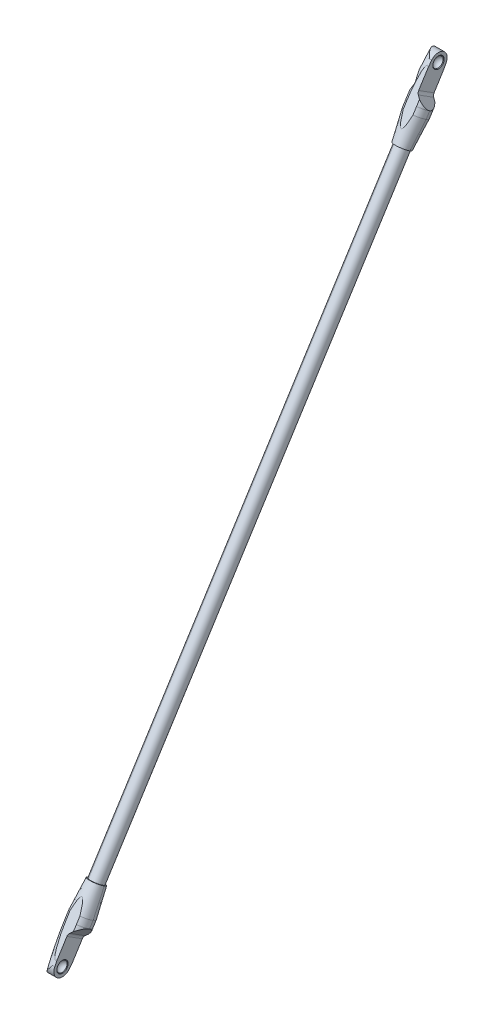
ISO-10303-21;
HEADER;
FILE_DESCRIPTION(('STEP AP214'),'2;1');
FILE_NAME('part.step','',(''),(''),'','','');
FILE_SCHEMA(('AUTOMOTIVE_DESIGN { 1 0 10303 214 1 1 1 1 }'));
ENDSEC;
DATA;
#1=APPLICATION_CONTEXT('core data for automotive mechanical design processes');
#2=APPLICATION_PROTOCOL_DEFINITION('international standard','automotive_design',2000,#1);
#3=PRODUCT_CONTEXT('',#1,'mechanical');
#4=PRODUCT('Part','Part','',(#3));
#5=PRODUCT_RELATED_PRODUCT_CATEGORY('part','',(#4));
#6=PRODUCT_DEFINITION_FORMATION('','',#4);
#7=PRODUCT_DEFINITION_CONTEXT('part definition',#1,'design');
#8=PRODUCT_DEFINITION('design','',#6,#7);
#9=PRODUCT_DEFINITION_SHAPE('','',#8);
#10=(LENGTH_UNIT() NAMED_UNIT(*) SI_UNIT(.MILLI.,.METRE.));
#11=(NAMED_UNIT(*) PLANE_ANGLE_UNIT() SI_UNIT($,.RADIAN.));
#12=(NAMED_UNIT(*) SI_UNIT($,.STERADIAN.) SOLID_ANGLE_UNIT());
#13=UNCERTAINTY_MEASURE_WITH_UNIT(LENGTH_MEASURE(1.E-05),#10,'distance_accuracy_value','');
#14=(GEOMETRIC_REPRESENTATION_CONTEXT(3) GLOBAL_UNCERTAINTY_ASSIGNED_CONTEXT((#13)) GLOBAL_UNIT_ASSIGNED_CONTEXT((#10,
#11,#12)) REPRESENTATION_CONTEXT('',''));
#15=CARTESIAN_POINT('',(0.,0.,0.));
#16=DIRECTION('',(0.,0.,1.));
#17=DIRECTION('',(1.,0.,0.));
#18=AXIS2_PLACEMENT_3D('',#15,#16,#17);
#19=CARTESIAN_POINT('',(-53.4980987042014,-741.350029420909,-108.488777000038));
#20=DIRECTION('',(-2.46776242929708E-06,0.84541139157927,-0.534115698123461));
#21=DIRECTION('',(-0.999999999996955,-2.08627447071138E-06,1.31807065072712E-06));
#22=AXIS2_PLACEMENT_3D('',#19,#20,#21);
#23=CYLINDRICAL_SURFACE('',#22,12.5);
#24=DIRECTION('',(-2.46776242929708E-06,0.84541139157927,-0.534115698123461));
#25=VECTOR('',#24,1.);
#26=CARTESIAN_POINT('',(-47.5609276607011,-747.225289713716,-117.78831013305));
#27=LINE('',#26,#25);
#28=CARTESIAN_POINT('',(-47.5608511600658,-773.433042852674,-101.230723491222));
#29=VERTEX_POINT('',#28);
#30=CARTESIAN_POINT('',(-47.5608314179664,-780.196333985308,-96.9577979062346));
#31=VERTEX_POINT('',#30);
#32=EDGE_CURVE('E651',#29,#31,#27,.F.);
#33=ORIENTED_EDGE('',*,*,#32,.F.);
#34=CARTESIAN_POINT('',(-53.4980222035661,-767.557782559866,-91.9311903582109));
#35=DIRECTION('',(-2.46776242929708E-06,0.84541139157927,-0.534115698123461));
#36=DIRECTION('',(-0.999999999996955,-2.08627447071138E-06,1.31807065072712E-06));
#37=AXIS2_PLACEMENT_3D('',#34,#35,#36);
#38=CIRCLE('',#37,12.5);
#39=CARTESIAN_POINT('',(-40.9980222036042,-767.557756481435,-91.9312068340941));
#40=VERTEX_POINT('',#39);
#41=EDGE_CURVE('E648',#40,#29,#38,.T.);
#42=ORIENTED_EDGE('',*,*,#41,.F.);
#43=DIRECTION('',(-2.46776242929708E-06,0.84541139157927,-0.534115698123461));
#44=VECTOR('',#43,1.);
#45=CARTESIAN_POINT('',(-40.9980987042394,-741.350003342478,-108.488793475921));
#46=LINE('',#45,#44);
#47=CARTESIAN_POINT('',(-40.9980024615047,-774.321047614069,-87.6582812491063));
#48=VERTEX_POINT('',#47);
#49=EDGE_CURVE('E449',#48,#40,#46,.T.);
#50=ORIENTED_EDGE('',*,*,#49,.F.);
#51=CARTESIAN_POINT('',(-53.4980024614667,-774.3210736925,-87.6582647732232));
#52=DIRECTION('',(-2.46776242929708E-06,0.84541139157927,-0.534115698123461));
#53=DIRECTION('',(-0.999999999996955,-2.08627447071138E-06,1.31807065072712E-06));
#54=AXIS2_PLACEMENT_3D('',#51,#52,#53);
#55=CIRCLE('',#54,12.5);
#56=EDGE_CURVE('E272',#48,#31,#55,.T.);
#57=ORIENTED_EDGE('',*,*,#56,.T.);
#58=EDGE_LOOP('',(#33,#42,#50,#57));
#59=FACE_BOUND('',#58,.T.);
#60=ADVANCED_FACE('F16',(#59),#23,.T.);
#61=CARTESIAN_POINT('',(-53.4998999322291,-124.281435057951,-498.341606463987));
#62=DIRECTION('',(2.46776242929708E-06,-0.84541139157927,0.534115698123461));
#63=DIRECTION('',(0.999999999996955,2.08627447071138E-06,-1.31807065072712E-06));
#64=AXIS2_PLACEMENT_3D('',#61,#62,#63);
#65=DEGENERATE_TOROIDAL_SURFACE('',#64,422.5,435.,.F.);
#66=CARTESIAN_POINT('',(-59.4350736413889,-130.924286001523,-507.156189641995));
#67=CARTESIAN_POINT('',(-59.4395933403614,-130.045627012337,-507.711310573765));
#68=CARTESIAN_POINT('',(-59.4363649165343,-129.16693593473,-508.26645177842));
#69=CARTESIAN_POINT('',(-59.4141291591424,-127.409663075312,-509.376665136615));
#70=CARTESIAN_POINT('',(-59.395121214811,-126.531081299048,-509.93173728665));
#71=CARTESIAN_POINT('',(-59.3410056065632,-124.77304212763,-511.042434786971));
#72=CARTESIAN_POINT('',(-59.3058755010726,-123.893585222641,-511.598059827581));
#73=CARTESIAN_POINT('',(-59.2188205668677,-122.135276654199,-512.708927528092));
#74=CARTESIAN_POINT('',(-59.1668960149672,-121.25642498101,-513.264170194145));
#75=CARTESIAN_POINT('',(-59.0448877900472,-119.495519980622,-514.37667827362));
#76=CARTESIAN_POINT('',(-58.9747209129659,-118.613470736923,-514.933941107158));
#77=CARTESIAN_POINT('',(-58.8146478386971,-116.850662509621,-516.047651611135));
#78=CARTESIAN_POINT('',(-58.724742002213,-115.969903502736,-516.604099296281));
#79=CARTESIAN_POINT('',(-58.5226852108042,-114.210654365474,-517.715561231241));
#80=CARTESIAN_POINT('',(-58.4105462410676,-113.332163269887,-518.270576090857));
#81=CARTESIAN_POINT('',(-58.2225284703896,-112.016497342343,-519.101790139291));
#82=CARTESIAN_POINT('',(-58.1565572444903,-111.578303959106,-519.378632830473));
#83=CARTESIAN_POINT('',(-58.0172368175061,-110.702758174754,-519.931786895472));
#84=CARTESIAN_POINT('',(-57.9438877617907,-110.265405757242,-520.208098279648));
#85=CARTESIAN_POINT('',(-57.8093662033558,-109.507507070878,-520.686925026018));
#86=CARTESIAN_POINT('',(-57.7501170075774,-109.186716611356,-520.889594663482));
#87=CARTESIAN_POINT('',(-57.6265760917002,-108.545818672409,-521.294502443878));
#88=CARTESIAN_POINT('',(-57.5622842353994,-108.225711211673,-521.496740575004));
#89=CARTESIAN_POINT('',(-57.4280251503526,-107.586455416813,-521.900610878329));
#90=CARTESIAN_POINT('',(-57.3580598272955,-107.267306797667,-522.102243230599));
#91=CARTESIAN_POINT('',(-57.2115754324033,-106.630097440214,-522.50482063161));
#92=CARTESIAN_POINT('',(-57.1350566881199,-106.31203664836,-522.70576571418));
#93=CARTESIAN_POINT('',(-56.9741884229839,-105.676887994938,-523.10704119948));
#94=CARTESIAN_POINT('',(-56.889828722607,-105.359801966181,-523.307370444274));
#95=CARTESIAN_POINT('',(-56.7117013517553,-104.727435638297,-523.706888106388));
#96=CARTESIAN_POINT('',(-56.6179317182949,-104.412155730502,-523.906076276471));
#97=CARTESIAN_POINT('',(-56.4184088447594,-103.78382916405,-524.303041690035));
#98=CARTESIAN_POINT('',(-56.3126390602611,-103.470786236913,-524.500816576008));
#99=CARTESIAN_POINT('',(-56.0854629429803,-102.848854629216,-524.893741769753));
#100=CARTESIAN_POINT('',(-55.9640651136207,-102.539963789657,-525.088893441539));
#101=CARTESIAN_POINT('',(-55.7647145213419,-102.081172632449,-525.378749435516));
#102=CARTESIAN_POINT('',(-55.6952093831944,-101.928655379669,-525.475107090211));
#103=CARTESIAN_POINT('',(-55.5489387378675,-101.625980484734,-525.666331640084));
#104=CARTESIAN_POINT('',(-55.472168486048,-101.475824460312,-525.761197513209));
#105=CARTESIAN_POINT('',(-55.3094230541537,-101.179414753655,-525.948463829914));
#106=CARTESIAN_POINT('',(-55.2234644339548,-101.033154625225,-526.040868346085));
#107=CARTESIAN_POINT('',(-55.038967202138,-100.746492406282,-526.221976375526));
#108=CARTESIAN_POINT('',(-54.9404474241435,-100.606081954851,-526.310685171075));
#109=CARTESIAN_POINT('',(-54.7529868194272,-100.370740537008,-526.459369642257));
#110=CARTESIAN_POINT('',(-54.6682003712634,-100.273466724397,-526.520825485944));
#111=CARTESIAN_POINT('',(-54.4847996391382,-100.088763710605,-526.637517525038));
#112=CARTESIAN_POINT('',(-54.3862433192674,-100.001295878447,-526.692778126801));
#113=CARTESIAN_POINT('',(-54.2264357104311,-99.8857913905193,-526.765751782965));
#114=CARTESIAN_POINT('',(-54.1725458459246,-99.8505553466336,-526.788013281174));
#115=CARTESIAN_POINT('',(-54.059815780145,-99.7861595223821,-526.828697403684));
#116=CARTESIAN_POINT('',(-54.000978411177,-99.7569962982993,-526.847122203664));
#117=CARTESIAN_POINT('',(-53.8875527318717,-99.7108691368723,-526.876264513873));
#118=CARTESIAN_POINT('',(-53.8336439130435,-99.69273329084,-526.887722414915));
#119=CARTESIAN_POINT('',(-53.7230134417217,-99.6642980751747,-526.905687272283));
#120=CARTESIAN_POINT('',(-53.6662963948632,-99.6539862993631,-526.912202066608));
#121=CARTESIAN_POINT('',(-53.5511385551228,-99.6424137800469,-526.919513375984));
#122=CARTESIAN_POINT('',(-53.4926885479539,-99.6412161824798,-526.920269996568));
#123=CARTESIAN_POINT('',(-53.3765749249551,-99.648213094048,-526.915849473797));
#124=CARTESIAN_POINT('',(-53.3189118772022,-99.6564140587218,-526.91066825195));
#125=CARTESIAN_POINT('',(-53.1991140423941,-99.6826787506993,-526.894074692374));
#126=CARTESIAN_POINT('',(-53.1373281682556,-99.7018525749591,-526.881961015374));
#127=CARTESIAN_POINT('',(-53.0182260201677,-99.7483441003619,-526.852588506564));
#128=CARTESIAN_POINT('',(-52.960918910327,-99.7756779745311,-526.835319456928));
#129=CARTESIAN_POINT('',(-52.8142477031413,-99.856397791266,-526.784322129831));
#130=CARTESIAN_POINT('',(-52.7289667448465,-99.9150069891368,-526.747293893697));
#131=CARTESIAN_POINT('',(-52.569012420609,-100.041679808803,-526.667264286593));
#132=CARTESIAN_POINT('',(-52.4943708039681,-100.109770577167,-526.624245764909));
#133=CARTESIAN_POINT('',(-52.3187466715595,-100.286494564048,-526.512594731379));
#134=CARTESIAN_POINT('',(-52.2227803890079,-100.398643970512,-526.441740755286));
#135=CARTESIAN_POINT('',(-52.0433785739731,-100.629985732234,-526.29558319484));
#136=CARTESIAN_POINT('',(-51.9599731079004,-100.749194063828,-526.220269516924));
#137=CARTESIAN_POINT('',(-51.8019708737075,-100.992636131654,-526.06646720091));
#138=CARTESIAN_POINT('',(-51.7274319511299,-101.116896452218,-525.987961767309));
#139=CARTESIAN_POINT('',(-51.5856499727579,-101.368134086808,-525.829234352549));
#140=CARTESIAN_POINT('',(-51.5183983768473,-101.495108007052,-525.74901451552));
#141=CARTESIAN_POINT('',(-51.3144076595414,-101.900189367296,-525.493091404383));
#142=CARTESIAN_POINT('',(-51.1880092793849,-102.182005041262,-525.315045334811));
#143=CARTESIAN_POINT('',(-50.9525453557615,-102.750817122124,-524.955680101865));
#144=CARTESIAN_POINT('',(-50.8434926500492,-103.037817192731,-524.774358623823));
#145=CARTESIAN_POINT('',(-50.6379360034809,-103.615781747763,-524.409211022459));
#146=CARTESIAN_POINT('',(-50.5414644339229,-103.906754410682,-524.22537973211));
#147=CARTESIAN_POINT('',(-50.3585111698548,-104.490813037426,-523.856382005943));
#148=CARTESIAN_POINT('',(-50.2720263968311,-104.783898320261,-523.671216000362));
#149=CARTESIAN_POINT('',(-50.1068921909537,-105.372476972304,-523.299362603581));
#150=CARTESIAN_POINT('',(-50.028264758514,-105.667974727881,-523.112672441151));
#151=CARTESIAN_POINT('',(-49.8777731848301,-106.260213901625,-522.738506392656));
#152=CARTESIAN_POINT('',(-49.8059095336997,-106.556955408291,-522.551030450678));
#153=CARTESIAN_POINT('',(-49.6680872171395,-107.150942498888,-522.17576009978));
#154=CARTESIAN_POINT('',(-49.6021197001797,-107.44818662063,-521.987966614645));
#155=CARTESIAN_POINT('',(-49.4752451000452,-108.043436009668,-521.611898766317));
#156=CARTESIAN_POINT('',(-49.4143379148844,-108.341441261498,-521.423624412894));
#157=CARTESIAN_POINT('',(-49.2634884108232,-109.108546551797,-520.938981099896));
#158=CARTESIAN_POINT('',(-49.1768418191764,-109.57811066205,-520.64231894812));
#159=CARTESIAN_POINT('',(-49.0130113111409,-110.518422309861,-520.048246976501));
#160=CARTESIAN_POINT('',(-48.9358277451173,-110.98916989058,-519.75083712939));
#161=CARTESIAN_POINT('',(-48.716651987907,-112.402901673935,-518.857666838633));
#162=CARTESIAN_POINT('',(-48.5870553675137,-113.34726681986,-518.261033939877));
#163=CARTESIAN_POINT('',(-48.3546362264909,-115.239676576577,-517.0654435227));
#164=CARTESIAN_POINT('',(-48.2518527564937,-116.187724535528,-516.466483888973));
#165=CARTESIAN_POINT('',(-48.0697397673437,-118.085352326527,-515.267596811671));
#166=CARTESIAN_POINT('',(-47.9904086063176,-119.034932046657,-514.667669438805));
#167=CARTESIAN_POINT('',(-47.8556860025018,-120.896676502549,-513.491452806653));
#168=CARTESIAN_POINT('',(-47.7994548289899,-121.808798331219,-512.915190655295));
#169=CARTESIAN_POINT('',(-47.7051898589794,-123.633730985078,-511.762231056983));
#170=CARTESIAN_POINT('',(-47.6671564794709,-124.546541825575,-511.185533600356));
#171=CARTESIAN_POINT('',(-47.6085581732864,-126.370118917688,-510.033430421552));
#172=CARTESIAN_POINT('',(-47.5879468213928,-127.280884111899,-509.458025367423));
#173=CARTESIAN_POINT('',(-47.5636921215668,-129.102531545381,-508.307141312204));
#174=CARTESIAN_POINT('',(-47.5600479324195,-130.013413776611,-507.731662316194));
#175=CARTESIAN_POINT('',(-47.5647217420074,-130.924261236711,-507.156205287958));
#176=B_SPLINE_CURVE_WITH_KNOTS('',3,(#66,#67,#68,#69,#70,#71,#72,#73,#74,#75,#76,#77,#78,#79,
#80,#81,#82,#83,#84,#85,#86,#87,#88,#89,#90,#91,#92,#93,#94,#95,#96,#97,#98,#99,#100,#101,#102,
#103,#104,#105,#106,#107,#108,#109,#110,#111,#112,#113,#114,#115,#116,#117,#118,#119,#120,#121,
#122,#123,#124,#125,#126,#127,#128,#129,#130,#131,#132,#133,#134,#135,#136,#137,#138,#139,#140,
#141,#142,#143,#144,#145,#146,#147,#148,#149,#150,#151,#152,#153,#154,#155,#156,#157,#158,#159,
#160,#161,#162,#163,#164,#165,#166,#167,#168,#169,#170,#171,#172,#173,#174,#175),.UNSPECIFIED.,
.F.,.F.,(4,2,2,2,2,2,2,2,2,2,2,2,2,2,2,2,2,2,2,2,2,2,2,2,2,2,2,2,2,2,2,2,2,2,2,2,2,2,2,2,2,2,2,
2,2,2,2,2,2,2,2,2,2,2,4),(0.,3.11798800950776,6.23609671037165,9.35855895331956,
12.4809697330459,15.617879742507,18.7547324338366,21.8898987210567,23.4573613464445,
25.0247930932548,26.1769049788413,27.3290479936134,28.480805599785,29.6325056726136,
30.7857224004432,31.9391802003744,33.0942480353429,34.2486900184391,34.8285759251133,
35.4088431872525,35.9880817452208,36.5664618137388,36.9946719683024,37.4211310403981,
37.6251109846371,37.8289749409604,38.0023658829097,38.1754813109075,38.3497950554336,
38.5242286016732,38.7205868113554,38.9173368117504,39.2451852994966,39.5739925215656,
40.0639280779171,40.5550183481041,41.0491546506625,41.5427054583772,42.6113457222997,
43.6807732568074,44.7529003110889,45.8246959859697,46.899413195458,47.9742082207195,
49.0473616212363,50.1204933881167,51.8068214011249,53.4932118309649,56.8663810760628,
60.2444359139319,63.6222542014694,66.8632139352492,70.1042479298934,73.3366179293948,
76.5688276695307),.UNSPECIFIED.);
#177=CARTESIAN_POINT('',(-59.4370709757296,-130.156720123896,-507.641123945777));
#178=VERTEX_POINT('',#177);
#179=CARTESIAN_POINT('',(-51.9999859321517,-100.694666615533,-526.254718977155));
#180=VERTEX_POINT('',#179);
#181=EDGE_CURVE('E1540',#178,#180,#176,.T.);
#182=ORIENTED_EDGE('',*,*,#181,.F.);
#183=CARTESIAN_POINT('',(-53.4998999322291,-124.281435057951,-498.341606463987));
#184=DIRECTION('',(2.46776242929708E-06,-0.84541139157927,0.534115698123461));
#185=DIRECTION('',(-0.999999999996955,-2.08627447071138E-06,1.31807065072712E-06));
#186=AXIS2_PLACEMENT_3D('',#183,#184,#185);
#187=CIRCLE('',#186,12.5);
#188=CARTESIAN_POINT('',(-65.999899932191,-124.281461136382,-498.341589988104));
#189=VERTEX_POINT('',#188);
#190=EDGE_CURVE('E956',#189,#178,#187,.T.);
#191=ORIENTED_EDGE('',*,*,#190,.F.);
#192=CARTESIAN_POINT('',(369.000100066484,-124.280553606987,-498.342163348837));
#193=DIRECTION('',(0.,0.534115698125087,0.845411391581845));
#194=DIRECTION('',(0.999999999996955,2.08627447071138E-06,-1.31807065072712E-06));
#195=AXIS2_PLACEMENT_3D('',#192,#193,#194);
#196=CIRCLE('',#195,435.);
#197=CARTESIAN_POINT('',(-63.000025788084,-81.1654739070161,-525.581494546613));
#198=VERTEX_POINT('',#197);
#199=EDGE_CURVE('E431',#198,#189,#196,.T.);
#200=ORIENTED_EDGE('',*,*,#199,.F.);
#201=CARTESIAN_POINT('',(-54.9995980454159,-94.7049833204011,-529.332583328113));
#202=CARTESIAN_POINT('',(-54.999596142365,-94.6807125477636,-529.344814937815));
#203=CARTESIAN_POINT('',(-55.0003554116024,-94.656397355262,-529.356949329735));
#204=CARTESIAN_POINT('',(-55.0033445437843,-94.6073548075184,-529.381186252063));
#205=CARTESIAN_POINT('',(-55.005597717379,-94.5826270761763,-529.393285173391));
#206=CARTESIAN_POINT('',(-55.011573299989,-94.5327585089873,-529.417442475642));
#207=CARTESIAN_POINT('',(-55.0153221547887,-94.5076185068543,-529.429495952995));
#208=CARTESIAN_POINT('',(-55.024285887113,-94.456920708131,-529.453556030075));
#209=CARTESIAN_POINT('',(-55.0295296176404,-94.4313650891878,-529.465556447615));
#210=CARTESIAN_POINT('',(-55.0391977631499,-94.3896771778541,-529.484928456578));
#211=CARTESIAN_POINT('',(-55.0432269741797,-94.3734967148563,-529.492396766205));
#212=CARTESIAN_POINT('',(-55.0518613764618,-94.3409713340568,-529.507309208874));
#213=CARTESIAN_POINT('',(-55.0564742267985,-94.3246275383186,-529.51475133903));
#214=CARTESIAN_POINT('',(-55.0712909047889,-94.2749573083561,-529.537215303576));
#215=CARTESIAN_POINT('',(-55.0822922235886,-94.2417646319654,-529.552015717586));
#216=CARTESIAN_POINT('',(-55.1003203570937,-94.1919932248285,-529.573903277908));
#217=CARTESIAN_POINT('',(-55.1066489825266,-94.1752532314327,-529.581212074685));
#218=CARTESIAN_POINT('',(-55.1199424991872,-94.1414273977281,-529.595876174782));
#219=CARTESIAN_POINT('',(-55.1269200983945,-94.1243446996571,-529.603227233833));
#220=CARTESIAN_POINT('',(-55.1465491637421,-94.0779086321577,-529.623064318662));
#221=CARTESIAN_POINT('',(-55.1596346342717,-94.0486717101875,-529.635394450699));
#222=CARTESIAN_POINT('',(-55.187549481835,-93.9892198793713,-529.66015388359));
#223=CARTESIAN_POINT('',(-55.2024310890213,-93.9590209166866,-529.672562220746));
#224=CARTESIAN_POINT('',(-55.233938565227,-93.8976342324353,-529.697454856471));
#225=CARTESIAN_POINT('',(-55.2506126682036,-93.8664626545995,-529.709917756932));
#226=CARTESIAN_POINT('',(-55.2857238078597,-93.8031314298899,-529.734891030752));
#227=CARTESIAN_POINT('',(-55.3042060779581,-93.7709883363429,-529.747379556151));
#228=CARTESIAN_POINT('',(-55.3424900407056,-93.7063309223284,-529.772138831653));
#229=CARTESIAN_POINT('',(-55.3623120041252,-93.6738243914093,-529.784398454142));
#230=CARTESIAN_POINT('',(-55.4035370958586,-93.6078118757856,-529.808924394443));
#231=CARTESIAN_POINT('',(-55.424971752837,-93.5743183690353,-529.821171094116));
#232=CARTESIAN_POINT('',(-55.5009871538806,-93.4580766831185,-529.86300985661));
#233=CARTESIAN_POINT('',(-55.557480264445,-93.3761140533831,-529.891327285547));
#234=CARTESIAN_POINT('',(-55.6844600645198,-93.1989814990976,-529.950144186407));
#235=CARTESIAN_POINT('',(-55.75562223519,-93.1041229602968,-529.980102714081));
#236=CARTESIAN_POINT('',(-55.8653529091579,-92.9608760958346,-530.023152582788));
#237=CARTESIAN_POINT('',(-55.9030666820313,-92.9121672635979,-530.037403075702));
#238=CARTESIAN_POINT('',(-55.9689722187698,-92.8278778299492,-530.061403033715));
#239=CARTESIAN_POINT('',(-55.9970313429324,-92.7922479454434,-530.071342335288));
#240=CARTESIAN_POINT('',(-56.0884820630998,-92.6768433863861,-530.102880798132));
#241=CARTESIAN_POINT('',(-56.1524238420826,-92.5972664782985,-530.123610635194));
#242=CARTESIAN_POINT('',(-56.2904820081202,-92.4267899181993,-530.165898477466));
#243=CARTESIAN_POINT('',(-56.3647306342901,-92.3359197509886,-530.18714152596));
#244=CARTESIAN_POINT('',(-56.5015189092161,-92.1693934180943,-530.223742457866));
#245=CARTESIAN_POINT('',(-56.5639445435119,-92.0937292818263,-530.23949083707));
#246=CARTESIAN_POINT('',(-56.6352304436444,-92.0076980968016,-530.256408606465));
#247=CARTESIAN_POINT('',(-56.643851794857,-91.9972996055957,-530.258437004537));
#248=CARTESIAN_POINT('',(-56.7023381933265,-91.9268009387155,-530.27207792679));
#249=CARTESIAN_POINT('',(-56.7523570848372,-91.866723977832,-530.283155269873));
#250=CARTESIAN_POINT('',(-56.8771044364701,-91.7167857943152,-530.309446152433));
#251=CARTESIAN_POINT('',(-56.9518634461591,-91.6268356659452,-530.324008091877));
#252=CARTESIAN_POINT('',(-57.1261688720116,-91.4169217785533,-530.355182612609));
#253=CARTESIAN_POINT('',(-57.2257515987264,-91.2968518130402,-530.370885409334));
#254=CARTESIAN_POINT('',(-57.4058815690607,-91.0790567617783,-530.395528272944));
#255=CARTESIAN_POINT('',(-57.4864460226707,-90.981426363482,-530.405186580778));
#256=CARTESIAN_POINT('',(-57.6393831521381,-90.7953508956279,-530.420947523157));
#257=CARTESIAN_POINT('',(-57.7117810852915,-90.7069482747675,-530.427306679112));
#258=CARTESIAN_POINT('',(-57.8632793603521,-90.5212605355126,-530.438286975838));
#259=CARTESIAN_POINT('',(-57.9423533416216,-90.4239403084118,-530.442681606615));
#260=CARTESIAN_POINT('',(-58.0780332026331,-90.2560017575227,-530.447905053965));
#261=CARTESIAN_POINT('',(-58.1347595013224,-90.1855001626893,-530.44938628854));
#262=CARTESIAN_POINT('',(-58.2635351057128,-90.0247867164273,-530.451130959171));
#263=CARTESIAN_POINT('',(-58.3354971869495,-89.9344995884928,-530.450946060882));
#264=CARTESIAN_POINT('',(-58.4751863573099,-89.7582040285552,-530.448290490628));
#265=CARTESIAN_POINT('',(-58.5429403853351,-89.672215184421,-530.445938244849));
#266=CARTESIAN_POINT('',(-58.6427663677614,-89.5447185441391,-530.440867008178));
#267=CARTESIAN_POINT('',(-58.6750589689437,-89.5033492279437,-530.438975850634));
#268=CARTESIAN_POINT('',(-58.7448900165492,-89.4136015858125,-530.434337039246));
#269=CARTESIAN_POINT('',(-58.7824027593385,-89.3652079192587,-530.431499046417));
#270=CARTESIAN_POINT('',(-58.8932912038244,-89.2216153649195,-530.42207224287));
#271=CARTESIAN_POINT('',(-58.9663844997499,-89.1262604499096,-530.414504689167));
#272=CARTESIAN_POINT('',(-59.1099608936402,-88.9375085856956,-530.396897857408));
#273=CARTESIAN_POINT('',(-59.1804640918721,-88.844120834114,-530.386923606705));
#274=CARTESIAN_POINT('',(-59.3188606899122,-88.6593565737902,-530.364650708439));
#275=CARTESIAN_POINT('',(-59.3867752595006,-88.567988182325,-530.35241643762));
#276=CARTESIAN_POINT('',(-59.5199928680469,-88.3873094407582,-530.325769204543));
#277=CARTESIAN_POINT('',(-59.5853182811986,-88.2980062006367,-530.311419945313));
#278=CARTESIAN_POINT('',(-59.7133572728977,-88.1214977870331,-530.280686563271));
#279=CARTESIAN_POINT('',(-59.7760944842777,-88.0342988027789,-530.264365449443));
#280=CARTESIAN_POINT('',(-59.8989527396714,-87.8620304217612,-530.229829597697));
#281=CARTESIAN_POINT('',(-59.9590988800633,-87.7769664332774,-530.21167716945));
#282=CARTESIAN_POINT('',(-60.0860579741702,-87.5957640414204,-530.170619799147));
#283=CARTESIAN_POINT('',(-60.1527380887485,-87.4996027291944,-530.147403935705));
#284=CARTESIAN_POINT('',(-60.2835639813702,-87.3089203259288,-530.098468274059));
#285=CARTESIAN_POINT('',(-60.347733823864,-87.2144018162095,-530.072802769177));
#286=CARTESIAN_POINT('',(-60.4735355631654,-87.0270568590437,-530.019067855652));
#287=CARTESIAN_POINT('',(-60.5351924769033,-86.9342317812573,-529.991052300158));
#288=CARTESIAN_POINT('',(-60.6559682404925,-86.7503236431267,-529.932717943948));
#289=CARTESIAN_POINT('',(-60.7151130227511,-86.659240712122,-529.902452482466));
#290=CARTESIAN_POINT('',(-60.830863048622,-86.4788619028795,-529.839718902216));
#291=CARTESIAN_POINT('',(-60.8874951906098,-86.3895649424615,-529.807303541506));
#292=CARTESIAN_POINT('',(-60.9982202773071,-86.2127966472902,-529.740369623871));
#293=CARTESIAN_POINT('',(-61.0523410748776,-86.1253230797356,-529.70590319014));
#294=CARTESIAN_POINT('',(-61.1319990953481,-85.994882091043,-529.652444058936));
#295=CARTESIAN_POINT('',(-61.1581104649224,-85.9518451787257,-529.63447020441));
#296=CARTESIAN_POINT('',(-61.2129896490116,-85.8607858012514,-529.595719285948));
#297=CARTESIAN_POINT('',(-61.2417104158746,-85.8127697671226,-529.57486045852));
#298=CARTESIAN_POINT('',(-61.3264484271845,-85.6700089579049,-529.511557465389));
#299=CARTESIAN_POINT('',(-61.3817604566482,-85.5753760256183,-529.467907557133));
#300=CARTESIAN_POINT('',(-61.4894906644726,-85.3880540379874,-529.378048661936));
#301=CARTESIAN_POINT('',(-61.5419411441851,-85.2953582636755,-529.331892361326));
#302=CARTESIAN_POINT('',(-61.6439490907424,-85.1119655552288,-529.237114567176));
#303=CARTESIAN_POINT('',(-61.693539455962,-85.0212603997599,-529.18854445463));
#304=CARTESIAN_POINT('',(-61.7898261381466,-84.8419024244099,-529.089034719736));
#305=CARTESIAN_POINT('',(-61.8365559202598,-84.7532398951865,-529.038145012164));
#306=CARTESIAN_POINT('',(-61.9271211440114,-84.5780156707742,-528.934091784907));
#307=CARTESIAN_POINT('',(-61.9709905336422,-84.4914428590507,-528.880976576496));
#308=CARTESIAN_POINT('',(-62.0558339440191,-84.3204431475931,-528.772568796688));
#309=CARTESIAN_POINT('',(-62.0968423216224,-84.236003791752,-528.717322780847));
#310=CARTESIAN_POINT('',(-62.1798038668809,-84.0612232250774,-528.599287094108));
#311=CARTESIAN_POINT('',(-62.2215644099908,-83.970958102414,-528.536248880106));
#312=CARTESIAN_POINT('',(-62.301764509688,-83.792802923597,-528.407556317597));
#313=CARTESIAN_POINT('',(-62.3402397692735,-83.7048972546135,-528.341945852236));
#314=CARTESIAN_POINT('',(-62.4138697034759,-83.5315256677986,-528.208207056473));
#315=CARTESIAN_POINT('',(-62.4490594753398,-83.4460430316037,-528.140119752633));
#316=CARTESIAN_POINT('',(-62.5161191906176,-83.2775786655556,-528.0015270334));
#317=CARTESIAN_POINT('',(-62.5480234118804,-83.1945793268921,-527.931059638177));
#318=CARTESIAN_POINT('',(-62.6085126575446,-83.0311394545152,-527.787808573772));
#319=CARTESIAN_POINT('',(-62.6371309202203,-82.9506806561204,-527.715059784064));
#320=CARTESIAN_POINT('',(-62.6910503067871,-82.7923717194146,-527.567344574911));
#321=CARTESIAN_POINT('',(-62.716383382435,-82.7145029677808,-527.492409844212));
#322=CARTESIAN_POINT('',(-62.7519816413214,-82.5994169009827,-527.378147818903));
#323=CARTESIAN_POINT('',(-62.7634086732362,-82.5614816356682,-527.339898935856));
#324=CARTESIAN_POINT('',(-62.7859968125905,-82.4843713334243,-527.260935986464));
#325=CARTESIAN_POINT('',(-62.7971217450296,-82.4452191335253,-527.220189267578));
#326=CARTESIAN_POINT('',(-62.8291035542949,-82.3289938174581,-527.097243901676));
#327=CARTESIAN_POINT('',(-62.8486950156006,-82.2527407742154,-527.013932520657));
#328=CARTESIAN_POINT('',(-62.884294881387,-82.1030809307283,-526.844973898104));
#329=CARTESIAN_POINT('',(-62.9003242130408,-82.0296597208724,-526.759343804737));
#330=CARTESIAN_POINT('',(-62.9288036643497,-81.8857255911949,-526.585846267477));
#331=CARTESIAN_POINT('',(-62.9412717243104,-81.8151996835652,-526.497992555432));
#332=CARTESIAN_POINT('',(-62.9626316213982,-81.677118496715,-526.320152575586));
#333=CARTESIAN_POINT('',(-62.9715382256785,-81.6095520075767,-526.230176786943));
#334=CARTESIAN_POINT('',(-62.9857777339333,-81.4774478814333,-526.048196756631));
#335=CARTESIAN_POINT('',(-62.9911220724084,-81.4129011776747,-525.956199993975));
#336=CARTESIAN_POINT('',(-62.9982433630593,-81.2868877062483,-525.770287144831));
#337=CARTESIAN_POINT('',(-63.0000282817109,-81.2254143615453,-525.676375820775));
#338=CARTESIAN_POINT('',(-63.000025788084,-81.1654739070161,-525.581494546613));
#339=B_SPLINE_CURVE_WITH_KNOTS('',3,(#201,#202,#203,#204,#205,#206,#207,#208,#209,#210,#211,
#212,#213,#214,#215,#216,#217,#218,#219,#220,#221,#222,#223,#224,#225,#226,#227,#228,#229,#230,
#231,#232,#233,#234,#235,#236,#237,#238,#239,#240,#241,#242,#243,#244,#245,#246,#247,#248,#249,
#250,#251,#252,#253,#254,#255,#256,#257,#258,#259,#260,#261,#262,#263,#264,#265,#266,#267,#268,
#269,#270,#271,#272,#273,#274,#275,#276,#277,#278,#279,#280,#281,#282,#283,#284,#285,#286,#287,
#288,#289,#290,#291,#292,#293,#294,#295,#296,#297,#298,#299,#300,#301,#302,#303,#304,#305,#306,
#307,#308,#309,#310,#311,#312,#313,#314,#315,#316,#317,#318,#319,#320,#321,#322,#323,#324,#325,
#326,#327,#328,#329,#330,#331,#332,#333,#334,#335,#336,#337,#338),.UNSPECIFIED.,.F.,.F.,(4,2,2,
2,2,2,2,2,2,2,2,2,2,2,2,2,2,2,2,2,2,2,2,2,2,2,2,2,2,2,2,2,2,2,2,2,2,2,2,2,2,2,2,2,2,2,2,2,2,2,2,
2,2,2,2,2,2,2,2,2,2,2,2,2,2,2,2,2,4),(0.,0.0815194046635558,0.164341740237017,0.248698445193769,
0.334808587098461,0.389613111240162,0.445230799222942,0.559074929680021,0.617063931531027,
0.676646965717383,0.779587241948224,0.887206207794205,0.99963580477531,1.11699174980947,
1.23697393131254,1.36178861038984,1.67212198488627,2.0389394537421,2.22862346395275,
2.36790523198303,2.68037635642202,3.03810731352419,3.33613291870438,3.3771101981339,
3.61396578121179,3.96753556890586,4.43781617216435,4.81862869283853,5.16193235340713,
5.538315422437,5.80980971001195,6.15615469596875,6.48463008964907,6.64217237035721,
6.82605691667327,7.1871751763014,7.53945522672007,7.88292416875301,8.21761124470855,
8.54354806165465,8.86076884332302,9.21862136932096,9.56985097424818,9.91452039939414,
10.2526960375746,10.5844481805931,10.9098512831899,11.0702004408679,11.2493296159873,
11.6032132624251,11.9513841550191,12.293973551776,12.6311192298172,12.9629657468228,
13.2896646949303,13.6428317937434,13.9914726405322,14.3358141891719,14.6760919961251,
15.0125501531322,15.3454411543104,15.5106390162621,15.6834061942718,16.0271636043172,
16.3688446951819,16.7087728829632,17.047276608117,17.3846884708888,17.7213443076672),.UNSPECIFIED.);
#340=CARTESIAN_POINT('',(-54.9995980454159,-94.7049833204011,-529.332583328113));
#341=VERTEX_POINT('',#340);
#342=EDGE_CURVE('E323',#341,#198,#339,.T.);
#343=ORIENTED_EDGE('',*,*,#342,.F.);
#344=CARTESIAN_POINT('',(-53.5000024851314,-89.1486399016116,-520.537873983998));
#345=DIRECTION('',(-2.46776242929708E-06,0.845411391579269,-0.534115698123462));
#346=DIRECTION('',(0.,-0.534115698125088,-0.845411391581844));
#347=AXIS2_PLACEMENT_3D('',#344,#345,#346);
#348=CIRCLE('',#347,10.5104068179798);
#349=CARTESIAN_POINT('',(-52.0004069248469,-94.7049770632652,-529.332587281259));
#350=VERTEX_POINT('',#349);
#351=EDGE_CURVE('E733',#350,#341,#348,.T.);
#352=ORIENTED_EDGE('',*,*,#351,.F.);
#353=CARTESIAN_POINT('',(-52.0000025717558,-94.673452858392,-529.348407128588));
#354=CARTESIAN_POINT('',(-52.0002726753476,-94.68399239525,-529.343140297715));
#355=CARTESIAN_POINT('',(-52.0004069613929,-94.6945003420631,-529.337866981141));
#356=CARTESIAN_POINT('',(-52.0004069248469,-94.7049770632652,-529.332587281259));
#357=(BOUNDED_CURVE() B_SPLINE_CURVE(3,(#353,#354,#355,#356),.UNSPECIFIED.,.F.,
.F.) B_SPLINE_CURVE_WITH_KNOTS((4,4),(7.68404953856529E-06,4.22971954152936E-05),
.UNSPECIFIED.) CURVE() GEOMETRIC_REPRESENTATION_ITEM() RATIONAL_B_SPLINE_CURVE((1.,1.,1.,1.)) REPRESENTATION_ITEM(''));
#358=CARTESIAN_POINT('',(-52.0000025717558,-94.673452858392,-529.348407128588));
#359=VERTEX_POINT('',#358);
#360=EDGE_CURVE('E306',#359,#350,#357,.T.);
#361=ORIENTED_EDGE('',*,*,#360,.F.);
#362=CARTESIAN_POINT('',(-51.9999321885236,-119.753513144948,-515.647060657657));
#363=CARTESIAN_POINT('',(-51.9999439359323,-115.652051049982,-518.067745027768));
#364=CARTESIAN_POINT('',(-51.9999556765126,-111.510866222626,-520.420374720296));
#365=CARTESIAN_POINT('',(-51.9999791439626,-103.14873693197,-524.988986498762));
#366=CARTESIAN_POINT('',(-51.9999908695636,-98.928218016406,-527.204679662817));
#367=CARTESIAN_POINT('',(-52.0000025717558,-94.673452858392,-529.348407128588));
#368=(BOUNDED_CURVE() B_SPLINE_CURVE(3,(#362,#363,#364,#365,#366,#367),.UNSPECIFIED.,.F.,
.F.) B_SPLINE_CURVE_WITH_KNOTS((4,2,4),(0.313716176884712,0.328296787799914,0.342877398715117),
.UNSPECIFIED.) CURVE() GEOMETRIC_REPRESENTATION_ITEM() RATIONAL_B_SPLINE_CURVE((1.,1.,1.,1.,1.,1.)) REPRESENTATION_ITEM(''));
#369=EDGE_CURVE('E302',#180,#359,#368,.T.);
#370=ORIENTED_EDGE('',*,*,#369,.F.);
#371=EDGE_LOOP('',(#182,#191,#200,#343,#352,#361,#370));
#372=FACE_BOUND('',#371,.T.);
#373=ADVANCED_FACE('F712',(#372),#65,.F.);
#374=CARTESIAN_POINT('',(-53.4998036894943,-157.252479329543,-477.511094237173));
#375=DIRECTION('',(2.46776242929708E-06,-0.84541139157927,0.534115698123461));
#376=DIRECTION('',(-0.999999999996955,-2.08627447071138E-06,1.31807065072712E-06));
#377=AXIS2_PLACEMENT_3D('',#374,#375,#376);
#378=CYLINDRICAL_SURFACE('',#377,12.5);
#379=DIRECTION('',(2.46776242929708E-06,-0.84541139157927,0.534115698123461));
#380=VECTOR('',#379,1.);
#381=CARTESIAN_POINT('',(-59.4369747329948,-163.127764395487,-486.810611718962));
#382=LINE('',#381,#380);
#383=CARTESIAN_POINT('',(-59.4370512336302,-136.92001125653,-503.368198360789));
#384=VERTEX_POINT('',#383);
#385=EDGE_CURVE('E1543',#384,#178,#382,.F.);
#386=ORIENTED_EDGE('',*,*,#385,.F.);
#387=CARTESIAN_POINT('',(-53.4998801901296,-131.044726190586,-494.068680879));
#388=DIRECTION('',(2.46776242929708E-06,-0.84541139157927,0.534115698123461));
#389=DIRECTION('',(-0.999999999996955,-2.08627447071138E-06,1.31807065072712E-06));
#390=AXIS2_PLACEMENT_3D('',#387,#388,#389);
#391=CIRCLE('',#390,12.5);
#392=CARTESIAN_POINT('',(-65.9998801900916,-131.044752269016,-494.068664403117));
#393=VERTEX_POINT('',#392);
#394=EDGE_CURVE('E899',#393,#384,#391,.T.);
#395=ORIENTED_EDGE('',*,*,#394,.F.);
#396=DIRECTION('',(2.46776242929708E-06,-0.84541139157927,0.534115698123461));
#397=VECTOR('',#396,1.);
#398=CARTESIAN_POINT('',(-65.9998036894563,-157.252505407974,-477.511077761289));
#399=LINE('',#398,#397);
#400=EDGE_CURVE('E818',#189,#393,#399,.T.);
#401=ORIENTED_EDGE('',*,*,#400,.F.);
#402=ORIENTED_EDGE('',*,*,#190,.T.);
#403=EDGE_LOOP('',(#386,#395,#401,#402));
#404=FACE_BOUND('',#403,.T.);
#405=ADVANCED_FACE('F867',(#404),#378,.T.);
#406=CARTESIAN_POINT('',(-53.4980024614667,-774.3210736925,-87.6582647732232));
#407=DIRECTION('',(-2.46776242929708E-06,0.84541139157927,-0.534115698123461));
#408=DIRECTION('',(0.999999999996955,2.08627447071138E-06,-1.31807065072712E-06));
#409=AXIS2_PLACEMENT_3D('',#406,#407,#408);
#410=DEGENERATE_TOROIDAL_SURFACE('',#409,422.5,435.,.F.);
#411=CARTESIAN_POINT('',(-47.575728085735,-778.100267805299,-98.2820547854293));
#412=CARTESIAN_POINT('',(-47.5636971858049,-778.949081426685,-97.745789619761));
#413=CARTESIAN_POINT('',(-47.5589414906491,-779.797969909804,-97.2094771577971));
#414=CARTESIAN_POINT('',(-47.5640932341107,-781.495736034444,-96.1368590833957));
#415=CARTESIAN_POINT('',(-47.5740010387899,-782.344613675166,-95.6005534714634));
#416=CARTESIAN_POINT('',(-47.6086494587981,-784.044919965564,-94.5263305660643));
#417=CARTESIAN_POINT('',(-47.6334382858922,-784.89634791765,-93.9884137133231));
#418=CARTESIAN_POINT('',(-47.6983309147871,-786.59877935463,-92.9128481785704));
#419=CARTESIAN_POINT('',(-47.7384345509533,-787.449782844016,-92.3751994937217));
#420=CARTESIAN_POINT('',(-47.8377822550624,-789.205775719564,-91.2657948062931));
#421=CARTESIAN_POINT('',(-47.8980900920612,-790.110722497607,-90.694065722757));
#422=CARTESIAN_POINT('',(-48.0382791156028,-791.919530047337,-89.551293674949));
#423=CARTESIAN_POINT('',(-48.1181600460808,-792.823390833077,-88.9802507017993));
#424=CARTESIAN_POINT('',(-48.2994374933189,-794.627287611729,-87.840581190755));
#425=CARTESIAN_POINT('',(-48.400779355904,-795.527327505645,-87.2719521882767));
#426=CARTESIAN_POINT('',(-48.6283860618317,-797.32509984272,-86.1361519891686));
#427=CARTESIAN_POINT('',(-48.754648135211,-798.222832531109,-85.5689806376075));
#428=CARTESIAN_POINT('',(-48.9655227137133,-799.558071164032,-84.7254009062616));
#429=CARTESIAN_POINT('',(-49.0385545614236,-799.996890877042,-84.4481625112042));
#430=CARTESIAN_POINT('',(-49.1929762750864,-800.873543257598,-83.8943093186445));
#431=CARTESIAN_POINT('',(-49.274367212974,-801.311375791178,-83.6176946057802));
#432=CARTESIAN_POINT('',(-49.4472773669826,-802.18800014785,-83.0638591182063));
#433=CARTESIAN_POINT('',(-49.5388479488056,-802.626784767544,-82.7866428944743));
#434=CARTESIAN_POINT('',(-49.733632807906,-803.502327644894,-82.2334906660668));
#435=CARTESIAN_POINT('',(-49.8368420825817,-803.939086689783,-81.9575541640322));
#436=CARTESIAN_POINT('',(-50.0566332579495,-804.805381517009,-81.4102446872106));
#437=CARTESIAN_POINT('',(-50.1730622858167,-805.234944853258,-81.1388543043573));
#438=CARTESIAN_POINT('',(-50.4246761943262,-806.090968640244,-80.59803388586));
#439=CARTESIAN_POINT('',(-50.5598909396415,-806.517422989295,-80.3286077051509));
#440=CARTESIAN_POINT('',(-50.781999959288,-807.150290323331,-79.9287735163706));
#441=CARTESIAN_POINT('',(-50.8588737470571,-807.359212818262,-79.7967800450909));
#442=CARTESIAN_POINT('',(-51.0208134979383,-807.774763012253,-79.5342429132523));
#443=CARTESIAN_POINT('',(-51.105877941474,-807.981391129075,-79.4036989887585));
#444=CARTESIAN_POINT('',(-51.2863611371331,-808.39079297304,-79.145046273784));
#445=CARTESIAN_POINT('',(-51.3817522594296,-808.593575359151,-79.0169320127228));
#446=CARTESIAN_POINT('',(-51.5867894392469,-808.993877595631,-78.7640282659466));
#447=CARTESIAN_POINT('',(-51.6964211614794,-809.191402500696,-78.6392355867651));
#448=CARTESIAN_POINT('',(-51.8475813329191,-809.433842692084,-78.486066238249));
#449=CARTESIAN_POINT('',(-51.8792299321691,-809.483165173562,-78.4549051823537));
#450=CARTESIAN_POINT('',(-51.9441449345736,-809.581049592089,-78.3930635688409));
#451=CARTESIAN_POINT('',(-51.9774115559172,-809.629611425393,-78.3623830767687));
#452=CARTESIAN_POINT('',(-52.0800893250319,-809.774154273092,-78.2710635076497));
#453=CARTESIAN_POINT('',(-52.1522472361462,-809.868778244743,-78.2112817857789));
#454=CARTESIAN_POINT('',(-52.3047819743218,-810.050759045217,-78.0963095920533));
#455=CARTESIAN_POINT('',(-52.3849939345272,-810.138213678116,-78.0410573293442));
#456=CARTESIAN_POINT('',(-52.5576951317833,-810.303840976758,-77.9364169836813));
#457=CARTESIAN_POINT('',(-52.6501285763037,-810.382052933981,-77.8870040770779));
#458=CARTESIAN_POINT('',(-52.8030792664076,-810.488149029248,-77.8199744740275));
#459=CARTESIAN_POINT('',(-52.8575871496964,-810.522156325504,-77.798489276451));
#460=CARTESIAN_POINT('',(-52.9716033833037,-810.58378272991,-77.7595548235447));
#461=CARTESIAN_POINT('',(-53.0311129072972,-810.611400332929,-77.7421065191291));
#462=CARTESIAN_POINT('',(-53.1445960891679,-810.653887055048,-77.7152641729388));
#463=CARTESIAN_POINT('',(-53.197846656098,-810.670111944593,-77.7050135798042));
#464=CARTESIAN_POINT('',(-53.3067963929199,-810.694814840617,-77.689406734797));
#465=CARTESIAN_POINT('',(-53.3624917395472,-810.703304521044,-77.6840431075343));
#466=CARTESIAN_POINT('',(-53.4751146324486,-810.711539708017,-77.6788402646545));
#467=CARTESIAN_POINT('',(-53.532047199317,-810.711237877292,-77.6790309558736));
#468=CARTESIAN_POINT('',(-53.6448839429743,-810.701814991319,-77.6849841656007));
#469=CARTESIAN_POINT('',(-53.7007872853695,-810.692687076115,-77.690751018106));
#470=CARTESIAN_POINT('',(-53.8198870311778,-810.664366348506,-77.7086435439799));
#471=CARTESIAN_POINT('',(-53.8825653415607,-810.643647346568,-77.7217334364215));
#472=CARTESIAN_POINT('',(-54.0031838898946,-810.594016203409,-77.7530894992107));
#473=CARTESIAN_POINT('',(-54.0611136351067,-810.565086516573,-77.7713667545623));
#474=CARTESIAN_POINT('',(-54.2110400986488,-810.479122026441,-77.825677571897));
#475=CARTESIAN_POINT('',(-54.298548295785,-810.416575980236,-77.8651930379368));
#476=CARTESIAN_POINT('',(-54.4624071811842,-810.28190627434,-77.9502749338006));
#477=CARTESIAN_POINT('',(-54.5387239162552,-810.209754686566,-77.9958590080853));
#478=CARTESIAN_POINT('',(-54.7207483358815,-810.020172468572,-78.1156336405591));
#479=CARTESIAN_POINT('',(-54.8207825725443,-809.898898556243,-78.1922523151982));
#480=CARTESIAN_POINT('',(-55.0074473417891,-809.649089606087,-78.350077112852));
#481=CARTESIAN_POINT('',(-55.0940450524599,-809.520537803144,-78.431293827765));
#482=CARTESIAN_POINT('',(-55.257880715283,-809.258268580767,-78.5969908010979));
#483=CARTESIAN_POINT('',(-55.3350579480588,-809.124524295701,-78.6814880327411));
#484=CARTESIAN_POINT('',(-55.4817422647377,-808.854302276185,-78.8522094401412));
#485=CARTESIAN_POINT('',(-55.5512585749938,-808.717828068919,-78.9384313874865));
#486=CARTESIAN_POINT('',(-55.6918782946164,-808.427230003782,-79.1220260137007));
#487=CARTESIAN_POINT('',(-55.7622669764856,-808.27286038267,-79.2195539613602));
#488=CARTESIAN_POINT('',(-55.8971486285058,-807.962282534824,-79.415771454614));
#489=CARTESIAN_POINT('',(-55.9616407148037,-807.806074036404,-79.5144611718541));
#490=CARTESIAN_POINT('',(-56.1479679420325,-807.335240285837,-79.8119254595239));
#491=CARTESIAN_POINT('',(-56.2625768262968,-807.018572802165,-80.0119902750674));
#492=CARTESIAN_POINT('',(-56.4781783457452,-806.381145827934,-80.4147051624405));
#493=CARTESIAN_POINT('',(-56.5791356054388,-806.060377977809,-80.6173605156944));
#494=CARTESIAN_POINT('',(-56.7702003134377,-805.416661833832,-81.0240487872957));
#495=CARTESIAN_POINT('',(-56.8603111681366,-805.093714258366,-81.2280812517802));
#496=CARTESIAN_POINT('',(-57.0320066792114,-804.445393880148,-81.6376783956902));
#497=CARTESIAN_POINT('',(-57.1135701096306,-804.120017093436,-81.8432455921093));
#498=CARTESIAN_POINT('',(-57.2693648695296,-803.467992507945,-82.2551829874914));
#499=CARTESIAN_POINT('',(-57.3435956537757,-803.141344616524,-82.4615532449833));
#500=CARTESIAN_POINT('',(-57.4856535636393,-802.48757379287,-82.8745938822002));
#501=CARTESIAN_POINT('',(-57.5534902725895,-802.160452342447,-83.081263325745));
#502=CARTESIAN_POINT('',(-57.6836602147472,-801.505437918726,-83.4950896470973));
#503=CARTESIAN_POINT('',(-57.7459935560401,-801.177544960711,-83.7022465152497));
#504=CARTESIAN_POINT('',(-57.8931248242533,-800.37117864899,-84.2116942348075));
#505=CARTESIAN_POINT('',(-57.9751762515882,-799.892346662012,-84.5142116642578));
#506=CARTESIAN_POINT('',(-58.1302736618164,-798.933637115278,-85.1199070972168));
#507=CARTESIAN_POINT('',(-58.2033193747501,-798.453759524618,-85.4230851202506));
#508=CARTESIAN_POINT('',(-58.4105306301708,-797.012801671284,-86.3334563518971));
#509=CARTESIAN_POINT('',(-58.5327543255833,-796.050486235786,-86.941429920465));
#510=CARTESIAN_POINT('',(-58.7509042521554,-794.12249397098,-88.1595007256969));
#511=CARTESIAN_POINT('',(-58.8467955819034,-793.156814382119,-88.7695997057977));
#512=CARTESIAN_POINT('',(-59.0152597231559,-791.224066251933,-89.9906751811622));
#513=CARTESIAN_POINT('',(-59.0878338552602,-790.256997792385,-90.6016516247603));
#514=CARTESIAN_POINT('',(-59.2094729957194,-788.356911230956,-91.8020921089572));
#515=CARTESIAN_POINT('',(-59.25929367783,-787.423927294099,-92.3915345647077));
#516=CARTESIAN_POINT('',(-59.3403087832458,-785.557368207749,-93.5707929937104));
#517=CARTESIAN_POINT('',(-59.3715028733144,-784.623793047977,-94.160608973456));
#518=CARTESIAN_POINT('',(-59.4158879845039,-782.758559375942,-95.3390300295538));
#519=CARTESIAN_POINT('',(-59.42912162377,-781.826901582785,-95.9276346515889));
#520=CARTESIAN_POINT('',(-59.4379134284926,-779.963563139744,-97.1048583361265));
#521=CARTESIAN_POINT('',(-59.4334722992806,-779.031882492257,-97.6934773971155));
#522=CARTESIAN_POINT('',(-59.4202890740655,-778.100292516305,-98.282039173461));
#523=B_SPLINE_CURVE_WITH_KNOTS('',3,(#411,#412,#413,#414,#415,#416,#417,#418,#419,#420,#421,
#422,#423,#424,#425,#426,#427,#428,#429,#430,#431,#432,#433,#434,#435,#436,#437,#438,#439,#440,
#441,#442,#443,#444,#445,#446,#447,#448,#449,#450,#451,#452,#453,#454,#455,#456,#457,#458,#459,
#460,#461,#462,#463,#464,#465,#466,#467,#468,#469,#470,#471,#472,#473,#474,#475,#476,#477,#478,
#479,#480,#481,#482,#483,#484,#485,#486,#487,#488,#489,#490,#491,#492,#493,#494,#495,#496,#497,
#498,#499,#500,#501,#502,#503,#504,#505,#506,#507,#508,#509,#510,#511,#512,#513,#514,#515,#516,
#517,#518,#519,#520,#521,#522),.UNSPECIFIED.,.F.,.F.,(4,2,2,2,2,2,2,2,2,2,2,2,2,2,2,2,2,2,2,2,2,
2,2,2,2,2,2,2,2,2,2,2,2,2,2,2,2,2,2,2,2,2,2,2,2,2,2,2,2,2,2,2,2,2,2,4),(0.,3.0122647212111,
6.02460464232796,9.04675706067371,12.0688767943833,15.2850697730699,18.5012206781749,
21.7092775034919,24.9169779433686,26.4894444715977,28.0621128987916,29.643111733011,
31.2234335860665,32.7870521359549,34.3531855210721,35.129502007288,35.9056747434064,
36.6798198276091,37.453191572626,37.6522868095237,37.8514089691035,38.250508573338,
38.6426634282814,39.0330861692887,39.2358830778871,39.4387277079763,39.607868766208,
39.7767541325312,39.946549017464,40.1164759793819,40.3172473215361,40.5184509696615,
40.8602822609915,41.2031300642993,41.7264375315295,42.2510038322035,42.7787902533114,
43.3059339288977,43.8928837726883,44.4799214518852,45.65462899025,46.8323244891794,
48.0096491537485,49.189831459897,50.3701014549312,51.5485733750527,52.7270221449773,
54.4438361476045,56.1607016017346,59.5947550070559,63.03333824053,66.4717266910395,
69.78569303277,73.0997186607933,76.4058666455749,79.7118826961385),.UNSPECIFIED.);
#524=CARTESIAN_POINT('',(-47.66921323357,-785.836483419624,-93.3944530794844));
#525=VERTEX_POINT('',#524);
#526=EDGE_CURVE('E10',#31,#525,#523,.T.);
#527=ORIENTED_EDGE('',*,*,#526,.F.);
#528=ORIENTED_EDGE('',*,*,#56,.F.);
#529=CARTESIAN_POINT('',(-50.5335128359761,-788.811009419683,-92.7403661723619));
#530=CARTESIAN_POINT('',(-48.7748903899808,-787.114097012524,-93.3470550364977));
#531=CARTESIAN_POINT('',(-47.2041174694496,-785.308787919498,-93.4304673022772));
#532=CARTESIAN_POINT('',(-45.5130672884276,-783.365242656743,-93.520266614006));
#533=CARTESIAN_POINT('',(-44.2007374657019,-781.481958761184,-92.9963850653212));
#534=CARTESIAN_POINT('',(-42.7356900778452,-779.379514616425,-92.4115387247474));
#535=CARTESIAN_POINT('',(-41.9114809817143,-777.597322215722,-91.1337770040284));
#536=CARTESIAN_POINT('',(-41.4670633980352,-776.63635533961,-90.4448016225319));
#537=CARTESIAN_POINT('',(-41.2364868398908,-775.820425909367,-89.5850284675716));
#538=CARTESIAN_POINT('',(-40.9980024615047,-774.976513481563,-88.6957686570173));
#539=CARTESIAN_POINT('',(-40.9980024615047,-774.321047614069,-87.6582812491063));
#540=B_SPLINE_CURVE_WITH_KNOTS('',2,(#529,#530,#531,#532,#533,#534,#535,#536,#537,#538,#539),
.UNSPECIFIED.,.F.,.F.,(3,2,2,2,2,3),(0.,0.25,0.5,0.75,0.875,1.),.UNSPECIFIED.);
#541=EDGE_CURVE('E276',#525,#48,#540,.T.);
#542=ORIENTED_EDGE('',*,*,#541,.F.);
#543=EDGE_LOOP('',(#527,#528,#542));
#544=FACE_BOUND('',#543,.T.);
#545=ADVANCED_FACE('F566',(#544),#410,.F.);
#546=CARTESIAN_POINT('',(-53.4980024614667,-774.3210736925,-87.6582647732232));
#547=DIRECTION('',(-2.46776242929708E-06,0.84541139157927,-0.534115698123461));
#548=DIRECTION('',(0.999999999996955,2.08627447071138E-06,-1.31807065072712E-06));
#549=AXIS2_PLACEMENT_3D('',#546,#547,#548);
#550=DEGENERATE_TOROIDAL_SURFACE('',#549,422.5,435.,.F.);
#551=CARTESIAN_POINT('',(-59.4331806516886,-767.67824751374,-78.8436659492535));
#552=CARTESIAN_POINT('',(-59.4376952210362,-768.556906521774,-78.2885450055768));
#553=CARTESIAN_POINT('',(-59.434461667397,-769.4355975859,-77.7334038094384));
#554=CARTESIAN_POINT('',(-59.4122156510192,-771.192870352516,-76.623190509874));
#555=CARTESIAN_POINT('',(-59.393202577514,-772.071452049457,-76.0681184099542));
#556=CARTESIAN_POINT('',(-59.3390767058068,-773.829490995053,-74.957421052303));
#557=CARTESIAN_POINT('',(-59.3039414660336,-774.708947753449,-74.4017961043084));
#558=CARTESIAN_POINT('',(-59.2168762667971,-776.467255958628,-73.2909286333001));
#559=CARTESIAN_POINT('',(-59.1649465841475,-777.346107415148,-72.7356861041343));
#560=CARTESIAN_POINT('',(-59.0429280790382,-779.10701190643,-71.6231783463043));
#561=CARTESIAN_POINT('',(-58.9727560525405,-779.989060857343,-71.0659156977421));
#562=CARTESIAN_POINT('',(-58.8126726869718,-781.751868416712,-69.9522056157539));
#563=CARTESIAN_POINT('',(-58.7227617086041,-782.63262704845,-69.3957581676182));
#564=CARTESIAN_POINT('',(-58.5206946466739,-784.3918753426,-68.2842967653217));
#565=CARTESIAN_POINT('',(-58.408550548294,-785.270365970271,-67.7292822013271));
#566=CARTESIAN_POINT('',(-58.2205250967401,-786.586031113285,-66.8980686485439));
#567=CARTESIAN_POINT('',(-58.1545513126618,-787.024224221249,-66.6212261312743));
#568=CARTESIAN_POINT('',(-58.0152257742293,-787.89976942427,-66.0680724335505));
#569=CARTESIAN_POINT('',(-57.9418741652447,-788.337121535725,-65.7917612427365));
#570=CARTESIAN_POINT('',(-57.8073481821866,-789.095019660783,-65.3129348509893));
#571=CARTESIAN_POINT('',(-57.7480971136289,-789.415809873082,-65.1102653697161));
#572=CARTESIAN_POINT('',(-57.6245524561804,-790.056707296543,-64.7053579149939));
#573=CARTESIAN_POINT('',(-57.5602587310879,-790.376814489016,-64.5031199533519));
#574=CARTESIAN_POINT('',(-57.4259959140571,-791.016069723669,-64.0992500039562));
#575=CARTESIAN_POINT('',(-57.3560287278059,-791.335218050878,-63.8976178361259));
#576=CARTESIAN_POINT('',(-57.2095406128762,-791.972426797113,-63.495040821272));
#577=CARTESIAN_POINT('',(-57.1330200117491,-792.290487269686,-63.2940959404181));
#578=CARTESIAN_POINT('',(-56.9721480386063,-792.925635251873,-62.892820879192));
#579=CARTESIAN_POINT('',(-56.8877864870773,-793.242720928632,-62.6924918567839));
#580=CARTESIAN_POINT('',(-56.7096554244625,-793.875086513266,-62.2929746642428));
#581=CARTESIAN_POINT('',(-56.6158839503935,-794.1903660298,-62.0937867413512));
#582=CARTESIAN_POINT('',(-56.4163574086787,-794.818691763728,-61.6968218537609));
#583=CARTESIAN_POINT('',(-56.3105857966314,-795.131734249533,-61.4990472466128));
#584=CARTESIAN_POINT('',(-56.0834060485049,-795.753664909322,-61.1061226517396));
#585=CARTESIAN_POINT('',(-55.9620064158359,-796.062555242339,-60.9109712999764));
#586=CARTESIAN_POINT('',(-55.7626531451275,-796.521345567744,-60.6211158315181));
#587=CARTESIAN_POINT('',(-55.693147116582,-796.673862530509,-60.52475836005));
#588=CARTESIAN_POINT('',(-55.5468747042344,-796.97653681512,-60.333534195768));
#589=CARTESIAN_POINT('',(-55.4701035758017,-797.126692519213,-60.2386685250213));
#590=CARTESIAN_POINT('',(-55.3073564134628,-797.423101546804,-60.051402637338));
#591=CARTESIAN_POINT('',(-55.2213969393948,-797.569361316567,-59.958998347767));
#592=CARTESIAN_POINT('',(-55.0368980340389,-797.856022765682,-59.7778908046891));
#593=CARTESIAN_POINT('',(-54.9383774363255,-797.996432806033,-59.6891822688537));
#594=CARTESIAN_POINT('',(-54.7509154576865,-798.231773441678,-59.5404982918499));
#595=CARTESIAN_POINT('',(-54.6661284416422,-798.329046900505,-59.4790426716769));
#596=CARTESIAN_POINT('',(-54.4827266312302,-798.513749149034,-59.3623511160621));
#597=CARTESIAN_POINT('',(-54.3841698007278,-798.601216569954,-59.3070907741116));
#598=CARTESIAN_POINT('',(-54.2243615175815,-798.716720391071,-59.2341175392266));
#599=CARTESIAN_POINT('',(-54.1704714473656,-798.751956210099,-59.2118561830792));
#600=CARTESIAN_POINT('',(-54.057741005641,-798.81635156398,-59.1711723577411));
#601=CARTESIAN_POINT('',(-53.9989034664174,-798.845514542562,-59.1527477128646));
#602=CARTESIAN_POINT('',(-53.8854775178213,-798.891641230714,-59.1236057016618));
#603=CARTESIAN_POINT('',(-53.8315685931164,-798.909776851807,-59.1121479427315));
#604=CARTESIAN_POINT('',(-53.7209379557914,-798.93821160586,-59.0941833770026));
#605=CARTESIAN_POINT('',(-53.6642208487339,-798.948523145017,-59.0876687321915));
#606=CARTESIAN_POINT('',(-53.5490629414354,-798.960095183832,-59.080357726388));
#607=CARTESIAN_POINT('',(-53.490612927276,-798.961292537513,-59.0796012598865));
#608=CARTESIAN_POINT('',(-53.3744993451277,-798.954295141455,-59.0840220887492));
#609=CARTESIAN_POINT('',(-53.3168363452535,-798.946093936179,-59.0892034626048));
#610=CARTESIAN_POINT('',(-53.197038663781,-798.91982874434,-59.1057973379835));
#611=CARTESIAN_POINT('',(-53.1352529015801,-798.900654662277,-59.1179111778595));
#612=CARTESIAN_POINT('',(-53.0161510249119,-798.854162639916,-59.1472840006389));
#613=CARTESIAN_POINT('',(-52.9588440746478,-798.82682852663,-59.1645532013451));
#614=CARTESIAN_POINT('',(-52.8121733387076,-798.746108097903,-59.2155509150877));
#615=CARTESIAN_POINT('',(-52.7268927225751,-798.687498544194,-59.2525793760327));
#616=CARTESIAN_POINT('',(-52.5669391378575,-798.560825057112,-59.3326094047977));
#617=CARTESIAN_POINT('',(-52.4922979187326,-798.492733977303,-59.3756281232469));
#618=CARTESIAN_POINT('',(-52.3166748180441,-798.316009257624,-59.4872796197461));
#619=CARTESIAN_POINT('',(-52.2207091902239,-798.203859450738,-59.5581338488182));
#620=CARTESIAN_POINT('',(-52.0413087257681,-797.972516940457,-59.7042918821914));
#621=CARTESIAN_POINT('',(-51.9579039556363,-797.853308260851,-59.7796057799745));
#622=CARTESIAN_POINT('',(-51.799903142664,-797.609865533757,-59.9334085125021));
#623=CARTESIAN_POINT('',(-51.7253649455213,-797.485604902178,-60.0119141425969));
#624=CARTESIAN_POINT('',(-51.5835844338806,-797.234366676,-60.1706419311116));
#625=CARTESIAN_POINT('',(-51.5163335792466,-797.107392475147,-60.2508619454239));
#626=CARTESIAN_POINT('',(-51.3123452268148,-796.702310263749,-60.5067855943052));
#627=CARTESIAN_POINT('',(-51.1859484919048,-796.420494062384,-60.6848319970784));
#628=CARTESIAN_POINT('',(-50.9504878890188,-795.851680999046,-61.044197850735));
#629=CARTESIAN_POINT('',(-50.841436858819,-795.564680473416,-61.2255196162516));
#630=CARTESIAN_POINT('',(-50.6358835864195,-794.986715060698,-61.5906677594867));
#631=CARTESIAN_POINT('',(-50.5394137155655,-794.695741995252,-61.7744993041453));
#632=CARTESIAN_POINT('',(-50.3564638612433,-794.111682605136,-62.1434975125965));
#633=CARTESIAN_POINT('',(-50.2699807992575,-793.818596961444,-62.3286637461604));
#634=CARTESIAN_POINT('',(-50.1048500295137,-793.230017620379,-62.7005175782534));
#635=CARTESIAN_POINT('',(-50.0262243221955,-792.934519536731,-62.8872079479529));
#636=CARTESIAN_POINT('',(-49.8757362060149,-792.342279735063,-63.2613743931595));
#637=CARTESIAN_POINT('',(-49.8038742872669,-792.045537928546,-63.4488505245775));
#638=CARTESIAN_POINT('',(-49.6660554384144,-791.451550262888,-63.8241212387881));
#639=CARTESIAN_POINT('',(-49.6000896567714,-791.154305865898,-64.0119148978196));
#640=CARTESIAN_POINT('',(-49.4732185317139,-790.559055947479,-64.3879830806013));
#641=CARTESIAN_POINT('',(-49.4123130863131,-790.261050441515,-64.5762575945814));
#642=CARTESIAN_POINT('',(-49.2614680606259,-789.493944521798,-65.0609013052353));
#643=CARTESIAN_POINT('',(-49.174824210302,-789.024380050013,-65.3575636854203));
#644=CARTESIAN_POINT('',(-49.0109991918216,-788.08406771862,-65.9516360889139));
#645=CARTESIAN_POINT('',(-48.9338183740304,-787.613319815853,-66.249046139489));
#646=CARTESIAN_POINT('',(-48.7146508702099,-786.19958711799,-67.1422170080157));
#647=CARTESIAN_POINT('',(-48.585059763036,-785.255221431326,-67.7388502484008));
#648=CARTESIAN_POINT('',(-48.3526516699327,-783.362810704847,-68.934441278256));
#649=CARTESIAN_POINT('',(-48.2498737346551,-782.414762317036,-69.5334011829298));
#650=CARTESIAN_POINT('',(-48.0677718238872,-780.517133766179,-70.7322887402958));
#651=CARTESIAN_POINT('',(-47.9884462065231,-779.567553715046,-71.3322163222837));
#652=CARTESIAN_POINT('',(-47.8537344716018,-777.705808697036,-72.5084333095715));
#653=CARTESIAN_POINT('',(-47.7975086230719,-776.793686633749,-73.0846956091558));
#654=CARTESIAN_POINT('',(-47.7032543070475,-774.968753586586,-74.2376554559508));
#655=CARTESIAN_POINT('',(-47.6652262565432,-774.055942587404,-74.8143530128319));
#656=CARTESIAN_POINT('',(-47.6066385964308,-772.232365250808,-75.9664563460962));
#657=CARTESIAN_POINT('',(-47.5860325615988,-771.321599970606,-76.5418614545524));
#658=CARTESIAN_POINT('',(-47.5617884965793,-769.49995243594,-77.6927455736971));
#659=CARTESIAN_POINT('',(-47.5581496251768,-768.589070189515,-78.2682245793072));
#660=CARTESIAN_POINT('',(-47.5628287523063,-767.678222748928,-78.8436815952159));
#661=B_SPLINE_CURVE_WITH_KNOTS('',3,(#551,#552,#553,#554,#555,#556,#557,#558,#559,#560,#561,
#562,#563,#564,#565,#566,#567,#568,#569,#570,#571,#572,#573,#574,#575,#576,#577,#578,#579,#580,
#581,#582,#583,#584,#585,#586,#587,#588,#589,#590,#591,#592,#593,#594,#595,#596,#597,#598,#599,
#600,#601,#602,#603,#604,#605,#606,#607,#608,#609,#610,#611,#612,#613,#614,#615,#616,#617,#618,
#619,#620,#621,#622,#623,#624,#625,#626,#627,#628,#629,#630,#631,#632,#633,#634,#635,#636,#637,
#638,#639,#640,#641,#642,#643,#644,#645,#646,#647,#648,#649,#650,#651,#652,#653,#654,#655,#656,
#657,#658,#659,#660),.UNSPECIFIED.,.F.,.F.,(4,2,2,2,2,2,2,2,2,2,2,2,2,2,2,2,2,2,2,2,2,2,2,2,2,2,
2,2,2,2,2,2,2,2,2,2,2,2,2,2,2,2,2,2,2,2,2,2,2,2,2,2,2,2,4),(0.,3.11798800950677,
6.23609671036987,9.35855895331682,12.480969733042,15.6178797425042,18.754732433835,
21.8898987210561,23.4573613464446,25.0247930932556,26.1769049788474,27.3290479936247,
28.4808055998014,29.632505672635,30.7857224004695,31.9391802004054,33.0942480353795,
34.2486900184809,34.8285759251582,35.4088431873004,35.9880817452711,36.5664618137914,
36.9946719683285,37.4211310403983,37.625110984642,37.8289749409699,38.0023658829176,
38.1754813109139,38.3497950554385,38.5242286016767,38.7205868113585,38.917336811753,
39.2451852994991,39.5739925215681,40.0639280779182,40.5550183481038,41.0491546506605,
41.5427054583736,42.6113457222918,43.6807732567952,44.7529003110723,45.8246959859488,
46.8994131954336,47.9742082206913,49.0473616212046,50.1204933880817,51.8068214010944,
53.4932118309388,56.8663810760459,60.2444359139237,63.6222542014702,66.863213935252,
70.1042479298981,73.3366179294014,76.5688276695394),.UNSPECIFIED.);
#662=CARTESIAN_POINT('',(-59.4351735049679,-768.445813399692,-78.3587316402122));
#663=VERTEX_POINT('',#662);
#664=CARTESIAN_POINT('',(-51.997916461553,-797.907835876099,-59.745156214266));
#665=VERTEX_POINT('',#664);
#666=EDGE_CURVE('E1020',#663,#665,#661,.T.);
#667=ORIENTED_EDGE('',*,*,#666,.F.);
#668=CARTESIAN_POINT('',(-53.4980024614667,-774.3210736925,-87.6582647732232));
#669=DIRECTION('',(-2.46776242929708E-06,0.84541139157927,-0.534115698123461));
#670=DIRECTION('',(-0.999999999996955,-2.08627447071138E-06,1.31807065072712E-06));
#671=AXIS2_PLACEMENT_3D('',#668,#669,#670);
#672=CIRCLE('',#671,12.5);
#673=CARTESIAN_POINT('',(-65.9980024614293,-774.321099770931,-87.6582482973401));
#674=VERTEX_POINT('',#673);
#675=EDGE_CURVE('E439',#674,#663,#672,.T.);
#676=ORIENTED_EDGE('',*,*,#675,.F.);
#677=CARTESIAN_POINT('',(369.001997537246,-774.320192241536,-87.6588216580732));
#678=DIRECTION('',(0.,-0.534115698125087,-0.845411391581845));
#679=DIRECTION('',(-0.999999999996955,-2.08627447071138E-06,1.31807065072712E-06));
#680=AXIS2_PLACEMENT_3D('',#677,#678,#679);
#681=CIRCLE('',#680,435.);
#682=CARTESIAN_POINT('',(-62.9978766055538,-817.43707448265,-60.4183516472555));
#683=VERTEX_POINT('',#682);
#684=EDGE_CURVE('E270',#683,#674,#681,.T.);
#685=ORIENTED_EDGE('',*,*,#684,.F.);
#686=CARTESIAN_POINT('',(-54.9974954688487,-803.897531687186,-56.6672839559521));
#687=CARTESIAN_POINT('',(-54.9974934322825,-803.921802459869,-56.6550523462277));
#688=CARTESIAN_POINT('',(-54.998252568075,-803.946117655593,-56.6429179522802));
#689=CARTESIAN_POINT('',(-55.0012414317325,-803.995160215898,-56.6186810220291));
#690=CARTESIAN_POINT('',(-55.0034944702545,-804.019887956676,-56.6065820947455));
#691=CARTESIAN_POINT('',(-55.0094697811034,-804.069756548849,-56.5824247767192));
#692=CARTESIAN_POINT('',(-55.0132184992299,-804.094896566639,-56.5703712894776));
#693=CARTESIAN_POINT('',(-55.0221819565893,-804.145594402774,-56.5463111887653));
#694=CARTESIAN_POINT('',(-55.0274255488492,-804.171150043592,-56.5343107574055));
#695=CARTESIAN_POINT('',(-55.0370934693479,-804.212837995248,-56.5149387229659));
#696=CARTESIAN_POINT('',(-55.0411225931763,-804.229018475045,-56.507470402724));
#697=CARTESIAN_POINT('',(-55.0497568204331,-804.261543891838,-56.4925579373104));
#698=CARTESIAN_POINT('',(-55.0543695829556,-804.277887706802,-56.4851157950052));
#699=CARTESIAN_POINT('',(-55.0691859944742,-804.327557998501,-56.4626517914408));
#700=CARTESIAN_POINT('',(-55.0801871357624,-804.360750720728,-56.4478513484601));
#701=CARTESIAN_POINT('',(-55.0982150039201,-804.410522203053,-56.4259637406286));
#702=CARTESIAN_POINT('',(-55.1045435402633,-804.427262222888,-56.4186549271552));
#703=CARTESIAN_POINT('',(-55.1178368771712,-804.461088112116,-56.4039907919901));
#704=CARTESIAN_POINT('',(-55.1248143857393,-804.478170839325,-56.3966397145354));
#705=CARTESIAN_POINT('',(-55.1444432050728,-804.524606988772,-56.3768025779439));
#706=CARTESIAN_POINT('',(-55.1575285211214,-804.553843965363,-56.3644724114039));
#707=CARTESIAN_POINT('',(-55.1854430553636,-804.613295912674,-56.3397129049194));
#708=CARTESIAN_POINT('',(-55.2003245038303,-804.643494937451,-56.3273045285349));
#709=CARTESIAN_POINT('',(-55.2318316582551,-804.70488175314,-56.3024118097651));
#710=CARTESIAN_POINT('',(-55.2485055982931,-804.736053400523,-56.2899488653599));
#711=CARTESIAN_POINT('',(-55.2836164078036,-804.79938477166,-56.2649754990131));
#712=CARTESIAN_POINT('',(-55.3020985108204,-804.831527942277,-56.2524869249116));
#713=CARTESIAN_POINT('',(-55.3403821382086,-804.896185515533,-56.2277275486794));
#714=CARTESIAN_POINT('',(-55.3602039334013,-804.928692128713,-56.2154678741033));
#715=CARTESIAN_POINT('',(-55.4014286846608,-804.994704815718,-56.1909418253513));
#716=CARTESIAN_POINT('',(-55.422863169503,-805.028198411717,-56.1786950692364));
#717=CARTESIAN_POINT('',(-55.498877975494,-805.144440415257,-56.1368561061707));
#718=CARTESIAN_POINT('',(-55.5553706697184,-805.226403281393,-56.108538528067));
#719=CARTESIAN_POINT('',(-55.6823495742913,-805.403536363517,-56.0497212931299));
#720=CARTESIAN_POINT('',(-55.7535112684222,-805.498395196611,-56.0197625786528));
#721=CARTESIAN_POINT('',(-55.8632412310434,-805.641642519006,-55.9767124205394));
#722=CARTESIAN_POINT('',(-55.9009547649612,-805.690351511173,-55.9624618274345));
#723=CARTESIAN_POINT('',(-55.9668598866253,-805.774641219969,-55.9384616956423));
#724=CARTESIAN_POINT('',(-55.9949188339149,-805.810271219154,-55.9285223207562));
#725=CARTESIAN_POINT('',(-56.0863689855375,-805.925676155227,-55.8969836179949));
#726=CARTESIAN_POINT('',(-56.1503103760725,-806.005253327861,-55.8762536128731));
#727=CARTESIAN_POINT('',(-56.2883677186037,-806.175730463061,-55.8339654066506));
#728=CARTESIAN_POINT('',(-56.3626159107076,-806.266600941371,-55.8127221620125));
#729=CARTESIAN_POINT('',(-56.4994033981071,-806.433127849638,-55.7761208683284));
#730=CARTESIAN_POINT('',(-56.561828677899,-806.508792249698,-55.7603723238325));
#731=CARTESIAN_POINT('',(-56.6331141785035,-806.594823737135,-55.7434543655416));
#732=CARTESIAN_POINT('',(-56.6417354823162,-806.605222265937,-55.7414259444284));
#733=CARTESIAN_POINT('',(-56.7002215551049,-806.67572118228,-55.7277848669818));
#734=CARTESIAN_POINT('',(-56.7502401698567,-806.735798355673,-55.7167073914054));
#735=CARTESIAN_POINT('',(-56.8749868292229,-806.885737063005,-55.6904161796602));
#736=CARTESIAN_POINT('',(-56.9497454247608,-806.975687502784,-55.6758540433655));
#737=CARTESIAN_POINT('',(-57.1240498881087,-807.185602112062,-55.6446790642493));
#738=CARTESIAN_POINT('',(-57.2236320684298,-807.305672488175,-55.6289760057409));
#739=CARTESIAN_POINT('',(-57.403761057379,-807.523468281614,-55.6043326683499));
#740=CARTESIAN_POINT('',(-57.4843250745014,-807.621099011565,-55.5946741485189));
#741=CARTESIAN_POINT('',(-57.6372613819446,-807.807175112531,-55.5789128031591));
#742=CARTESIAN_POINT('',(-57.7096589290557,-807.895578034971,-55.5725534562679));
#743=CARTESIAN_POINT('',(-57.8611564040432,-808.081266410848,-55.5615727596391));
#744=CARTESIAN_POINT('',(-57.9402299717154,-808.178586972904,-55.5571779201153));
#745=CARTESIAN_POINT('',(-58.0759091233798,-808.346526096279,-55.551954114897));
#746=CARTESIAN_POINT('',(-58.1326351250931,-808.417027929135,-55.5504727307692));
#747=CARTESIAN_POINT('',(-58.2614100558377,-808.577741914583,-55.5487277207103));
#748=CARTESIAN_POINT('',(-58.3333717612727,-808.668029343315,-55.5489124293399));
#749=CARTESIAN_POINT('',(-58.4730602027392,-808.844325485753,-55.5515676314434));
#750=CARTESIAN_POINT('',(-58.540813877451,-808.930314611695,-55.5539196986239));
#751=CARTESIAN_POINT('',(-58.6406393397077,-809.05781166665,-55.5589906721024));
#752=CARTESIAN_POINT('',(-58.6729317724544,-809.09918111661,-55.5608817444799));
#753=CARTESIAN_POINT('',(-58.7427624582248,-809.188929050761,-55.5655203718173));
#754=CARTESIAN_POINT('',(-58.7802750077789,-809.237322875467,-55.5683582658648));
#755=CARTESIAN_POINT('',(-58.8911628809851,-809.380915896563,-55.5777847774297));
#756=CARTESIAN_POINT('',(-58.9642558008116,-809.476271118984,-55.5853521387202));
#757=CARTESIAN_POINT('',(-59.1078314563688,-809.665023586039,-55.6029585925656));
#758=CARTESIAN_POINT('',(-59.1783342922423,-809.758411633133,-55.612932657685));
#759=CARTESIAN_POINT('',(-59.3167301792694,-809.943176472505,-55.6352051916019));
#760=CARTESIAN_POINT('',(-59.3846444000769,-810.034545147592,-55.6474392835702));
#761=CARTESIAN_POINT('',(-59.5178613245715,-810.215224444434,-55.6740861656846));
#762=CARTESIAN_POINT('',(-59.5831864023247,-810.304527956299,-55.6884352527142));
#763=CARTESIAN_POINT('',(-59.7112247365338,-810.481036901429,-55.7191682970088));
#764=CARTESIAN_POINT('',(-59.7739616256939,-810.56823614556,-55.7354892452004));
#765=CARTESIAN_POINT('',(-59.8968192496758,-810.740505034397,-55.7700247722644));
#766=CARTESIAN_POINT('',(-59.9569650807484,-810.825569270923,-55.788177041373));
#767=CARTESIAN_POINT('',(-60.0839235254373,-811.006772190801,-55.8292340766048));
#768=CARTESIAN_POINT('',(-60.1506033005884,-811.102933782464,-55.85244976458));
#769=CARTESIAN_POINT('',(-60.2814285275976,-811.293616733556,-55.9013850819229));
#770=CARTESIAN_POINT('',(-60.3455980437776,-811.388135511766,-55.9270504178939));
#771=CARTESIAN_POINT('',(-60.471399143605,-811.575480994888,-55.980785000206));
#772=CARTESIAN_POINT('',(-60.5330557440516,-811.668306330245,-56.0088003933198));
#773=CARTESIAN_POINT('',(-60.6538308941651,-811.852214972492,-56.0671344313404));
#774=CARTESIAN_POINT('',(-60.7129753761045,-811.943298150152,-56.0973997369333));
#775=CARTESIAN_POINT('',(-60.8287248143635,-812.123677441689,-56.1601330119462));
#776=CARTESIAN_POINT('',(-60.8853566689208,-812.212974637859,-56.1925482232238));
#777=CARTESIAN_POINT('',(-60.9960811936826,-812.389743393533,-56.2594818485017));
#778=CARTESIAN_POINT('',(-61.0502017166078,-812.477217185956,-56.2939481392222));
#779=CARTESIAN_POINT('',(-61.1298593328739,-812.607658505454,-56.347407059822));
#780=CARTESIAN_POINT('',(-61.1559705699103,-812.650695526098,-56.3653808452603));
#781=CARTESIAN_POINT('',(-61.2108494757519,-812.741755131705,-56.40413161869));
#782=CARTESIAN_POINT('',(-61.2395700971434,-812.789771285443,-56.4249903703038));
#783=CARTESIAN_POINT('',(-61.3243076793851,-812.93253244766,-56.4882931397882));
#784=CARTESIAN_POINT('',(-61.379619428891,-813.027165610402,-56.5319429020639));
#785=CARTESIAN_POINT('',(-61.4873490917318,-813.214488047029,-56.6218015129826));
#786=CARTESIAN_POINT('',(-61.5397993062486,-813.307184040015,-56.6679576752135));
#787=CARTESIAN_POINT('',(-61.6418067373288,-813.490577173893,-56.7627352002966));
#788=CARTESIAN_POINT('',(-61.6913968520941,-813.581282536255,-56.8113051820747));
#789=CARTESIAN_POINT('',(-61.7876830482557,-813.760640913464,-56.9108146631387));
#790=CARTESIAN_POINT('',(-61.8344125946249,-813.849303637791,-56.9617042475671));
#791=CARTESIAN_POINT('',(-61.9249773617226,-814.024528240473,-57.0657572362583));
#792=CARTESIAN_POINT('',(-61.9688465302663,-814.111101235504,-57.1188723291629));
#793=CARTESIAN_POINT('',(-62.0536895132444,-814.282101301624,-57.2272798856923));
#794=CARTESIAN_POINT('',(-62.0946976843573,-814.366540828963,-57.2825257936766));
#795=CARTESIAN_POINT('',(-62.1776588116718,-814.541321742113,-57.4005612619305));
#796=CARTESIAN_POINT('',(-62.2194191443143,-814.631587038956,-57.4635993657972));
#797=CARTESIAN_POINT('',(-62.2996188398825,-814.809742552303,-57.5922917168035));
#798=CARTESIAN_POINT('',(-62.3380939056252,-814.897648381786,-57.6579020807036));
#799=CARTESIAN_POINT('',(-62.4117234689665,-815.07102027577,-57.7916406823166));
#800=CARTESIAN_POINT('',(-62.4469130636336,-815.156503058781,-57.859727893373));
#801=CARTESIAN_POINT('',(-62.5139724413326,-815.324967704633,-57.9983204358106));
#802=CARTESIAN_POINT('',(-62.545876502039,-815.407967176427,-58.0687877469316));
#803=CARTESIAN_POINT('',(-62.6063654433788,-815.571407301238,-58.212038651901));
#804=CARTESIAN_POINT('',(-62.6349835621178,-815.651866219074,-58.28478736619));
#805=CARTESIAN_POINT('',(-62.6889026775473,-815.810175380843,-58.4325024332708));
#806=CARTESIAN_POINT('',(-62.7142356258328,-815.888044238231,-58.5074370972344));
#807=CARTESIAN_POINT('',(-62.7498337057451,-816.003130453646,-58.6216990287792));
#808=CARTESIAN_POINT('',(-62.7612606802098,-816.041065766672,-58.6599478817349));
#809=CARTESIAN_POINT('',(-62.7838487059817,-816.118176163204,-58.7389107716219));
#810=CARTESIAN_POINT('',(-62.7949735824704,-816.157328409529,-58.7796574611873));
#811=CARTESIAN_POINT('',(-62.8269552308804,-816.273553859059,-58.9026027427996));
#812=CARTESIAN_POINT('',(-62.846546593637,-816.349806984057,-58.9859140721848));
#813=CARTESIAN_POINT('',(-62.8821462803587,-816.4994669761,-59.1548726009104));
#814=CARTESIAN_POINT('',(-62.8981755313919,-816.572888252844,-59.240502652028));
#815=CARTESIAN_POINT('',(-62.9266548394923,-816.716822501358,-59.4140001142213));
#816=CARTESIAN_POINT('',(-62.9391228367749,-816.787348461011,-59.5018537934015));
#817=CARTESIAN_POINT('',(-62.9604826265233,-816.925429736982,-59.6796937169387));
#818=CARTESIAN_POINT('',(-62.969389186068,-816.99299626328,-59.7696694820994));
#819=CARTESIAN_POINT('',(-62.9836286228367,-817.125100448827,-59.9516494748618));
#820=CARTESIAN_POINT('',(-62.9889729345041,-817.189647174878,-60.0436462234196));
#821=CARTESIAN_POINT('',(-62.9960941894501,-817.315660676,-60.2295590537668));
#822=CARTESIAN_POINT('',(-62.9978790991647,-817.377134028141,-60.3234703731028));
#823=CARTESIAN_POINT('',(-62.9978766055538,-817.43707448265,-60.4183516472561));
#824=B_SPLINE_CURVE_WITH_KNOTS('',3,(#686,#687,#688,#689,#690,#691,#692,#693,#694,#695,#696,
#697,#698,#699,#700,#701,#702,#703,#704,#705,#706,#707,#708,#709,#710,#711,#712,#713,#714,#715,
#716,#717,#718,#719,#720,#721,#722,#723,#724,#725,#726,#727,#728,#729,#730,#731,#732,#733,#734,
#735,#736,#737,#738,#739,#740,#741,#742,#743,#744,#745,#746,#747,#748,#749,#750,#751,#752,#753,
#754,#755,#756,#757,#758,#759,#760,#761,#762,#763,#764,#765,#766,#767,#768,#769,#770,#771,#772,
#773,#774,#775,#776,#777,#778,#779,#780,#781,#782,#783,#784,#785,#786,#787,#788,#789,#790,#791,
#792,#793,#794,#795,#796,#797,#798,#799,#800,#801,#802,#803,#804,#805,#806,#807,#808,#809,#810,
#811,#812,#813,#814,#815,#816,#817,#818,#819,#820,#821,#822,#823),.UNSPECIFIED.,.F.,.F.,(4,2,2,
2,2,2,2,2,2,2,2,2,2,2,2,2,2,2,2,2,2,2,2,2,2,2,2,2,2,2,2,2,2,2,2,2,2,2,2,2,2,2,2,2,2,2,2,2,2,2,2,
2,2,2,2,2,2,2,2,2,2,2,2,2,2,2,2,2,4),(0.,0.081519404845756,0.164341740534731,0.24869844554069,
0.334808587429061,0.389613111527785,0.44523079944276,0.559074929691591,0.617063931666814,
0.676646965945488,0.779587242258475,0.887206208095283,0.999635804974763,1.11699174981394,
1.23697392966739,1.3617886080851,1.67212198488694,2.03893944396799,2.22862346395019,
2.3679052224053,2.68037633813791,3.03810730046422,3.33613291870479,3.37711020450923,
3.61396580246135,3.96753558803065,4.43781617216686,4.81862867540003,5.16193233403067,
5.53831542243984,5.80980971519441,6.15615470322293,6.48463009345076,6.64217237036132,
6.82605692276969,7.18717519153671,7.53945524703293,7.88292419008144,8.21761126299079,
8.54354807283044,8.86076884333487,9.21862137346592,9.5698509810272,9.91452040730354,
10.2526960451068,10.5844481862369,10.9098512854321,11.070200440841,11.2493296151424,
11.6032132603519,11.9513841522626,12.2939735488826,12.6311192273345,12.9629657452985,
13.2896646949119,13.6428317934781,13.9914726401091,14.3358141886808,14.6760919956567,
15.0125501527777,15.3454411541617,15.5106390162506,15.6834061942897,16.0271636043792,
16.3688446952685,16.7087728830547,17.0472766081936,17.3846884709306,17.7213443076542),.UNSPECIFIED.);
#825=CARTESIAN_POINT('',(-54.9974954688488,-803.897531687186,-56.667283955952));
#826=VERTEX_POINT('',#825);
#827=EDGE_CURVE('E505',#826,#683,#824,.T.);
#828=ORIENTED_EDGE('',*,*,#827,.F.);
#829=CARTESIAN_POINT('',(-53.4978999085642,-809.453868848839,-65.4619972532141));
#830=DIRECTION('',(2.46776242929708E-06,-0.84541139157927,0.534115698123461));
#831=DIRECTION('',(0.,0.534115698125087,0.845411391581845));
#832=AXIS2_PLACEMENT_3D('',#829,#830,#831);
#833=CIRCLE('',#832,10.5104068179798);
#834=CARTESIAN_POINT('',(-51.9983043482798,-803.89752543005,-56.6672879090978));
#835=VERTEX_POINT('',#834);
#836=EDGE_CURVE('E500',#835,#826,#833,.T.);
#837=ORIENTED_EDGE('',*,*,#836,.F.);
#838=CARTESIAN_POINT('',(-51.997899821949,-803.929049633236,-56.6514680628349));
#839=CARTESIAN_POINT('',(-51.9981699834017,-803.918510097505,-56.6567348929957));
#840=CARTESIAN_POINT('',(-51.998304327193,-803.908002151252,-56.6620082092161));
#841=CARTESIAN_POINT('',(-51.9983043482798,-803.89752543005,-56.6672879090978));
#842=(BOUNDED_CURVE() B_SPLINE_CURVE(3,(#838,#839,#840,#841),.UNSPECIFIED.,.F.,
.F.) B_SPLINE_CURVE_WITH_KNOTS((4,4),(7.68404953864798E-06,4.22971954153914E-05),
.UNSPECIFIED.) CURVE() GEOMETRIC_REPRESENTATION_ITEM() RATIONAL_B_SPLINE_CURVE((1.,1.,1.,1.)) REPRESENTATION_ITEM(''));
#843=CARTESIAN_POINT('',(-51.997899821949,-803.929049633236,-56.6514680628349));
#844=VERTEX_POINT('',#843);
#845=EDGE_CURVE('E504',#844,#835,#842,.T.);
#846=ORIENTED_EDGE('',*,*,#845,.F.);
#847=CARTESIAN_POINT('',(-51.9979702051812,-778.84898934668,-70.3528145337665));
#848=CARTESIAN_POINT('',(-51.9979584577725,-782.950451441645,-67.9321301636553));
#849=CARTESIAN_POINT('',(-51.9979467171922,-787.091636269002,-65.579500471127));
#850=CARTESIAN_POINT('',(-51.9979232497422,-795.453765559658,-61.0108886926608));
#851=CARTESIAN_POINT('',(-51.9979115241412,-799.674284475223,-58.7951955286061));
#852=CARTESIAN_POINT('',(-51.997899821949,-803.929049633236,-56.6514680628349));
#853=(BOUNDED_CURVE() B_SPLINE_CURVE(3,(#847,#848,#849,#850,#851,#852),.UNSPECIFIED.,.F.,
.F.) B_SPLINE_CURVE_WITH_KNOTS((4,2,4),(0.313716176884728,0.328296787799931,0.342877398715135),
.UNSPECIFIED.) CURVE() GEOMETRIC_REPRESENTATION_ITEM() RATIONAL_B_SPLINE_CURVE((1.,1.,1.,1.,1.,1.)) REPRESENTATION_ITEM(''));
#854=EDGE_CURVE('E284',#665,#844,#853,.T.);
#855=ORIENTED_EDGE('',*,*,#854,.F.);
#856=EDGE_LOOP('',(#667,#676,#685,#828,#837,#846,#855));
#857=FACE_BOUND('',#856,.T.);
#858=ADVANCED_FACE('F474',(#857),#550,.F.);
#859=CARTESIAN_POINT('',(-53.4998036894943,-157.252479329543,-477.511094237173));
#860=DIRECTION('',(2.46776242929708E-06,-0.84541139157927,0.534115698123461));
#861=DIRECTION('',(-0.999999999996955,-2.08627447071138E-06,1.31807065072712E-06));
#862=AXIS2_PLACEMENT_3D('',#859,#860,#861);
#863=CYLINDRICAL_SURFACE('',#862,12.5);
#864=DIRECTION('',(2.46776242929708E-06,-0.84541139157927,0.534115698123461));
#865=VECTOR('',#864,1.);
#866=CARTESIAN_POINT('',(-47.5626326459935,-151.377194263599,-468.211576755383));
#867=LINE('',#866,#865);
#868=CARTESIAN_POINT('',(-47.5627091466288,-125.169441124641,-484.76916339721));
#869=VERTEX_POINT('',#868);
#870=CARTESIAN_POINT('',(-47.5627288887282,-118.406149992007,-489.042088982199));
#871=VERTEX_POINT('',#870);
#872=EDGE_CURVE('E778',#869,#871,#867,.F.);
#873=ORIENTED_EDGE('',*,*,#872,.F.);
#874=CARTESIAN_POINT('',(-53.4998801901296,-131.044726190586,-494.068680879));
#875=DIRECTION('',(2.46776242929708E-06,-0.84541139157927,0.534115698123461));
#876=DIRECTION('',(-0.999999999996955,-2.08627447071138E-06,1.31807065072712E-06));
#877=AXIS2_PLACEMENT_3D('',#874,#875,#876);
#878=CIRCLE('',#877,12.5);
#879=CARTESIAN_POINT('',(-40.9998801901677,-131.044700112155,-494.068697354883));
#880=VERTEX_POINT('',#879);
#881=EDGE_CURVE('E814',#880,#869,#878,.T.);
#882=ORIENTED_EDGE('',*,*,#881,.F.);
#883=DIRECTION('',(2.46776242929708E-06,-0.84541139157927,0.534115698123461));
#884=VECTOR('',#883,1.);
#885=CARTESIAN_POINT('',(-40.9998036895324,-157.252453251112,-477.511110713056));
#886=LINE('',#885,#884);
#887=CARTESIAN_POINT('',(-40.9998999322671,-124.28140897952,-498.341622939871));
#888=VERTEX_POINT('',#887);
#889=EDGE_CURVE('E781',#888,#880,#886,.T.);
#890=ORIENTED_EDGE('',*,*,#889,.F.);
#891=CARTESIAN_POINT('',(-53.4998999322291,-124.281435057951,-498.341606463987));
#892=DIRECTION('',(2.46776242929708E-06,-0.84541139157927,0.534115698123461));
#893=DIRECTION('',(-0.999999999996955,-2.08627447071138E-06,1.31807065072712E-06));
#894=AXIS2_PLACEMENT_3D('',#891,#892,#893);
#895=CIRCLE('',#894,12.5);
#896=EDGE_CURVE('E427',#888,#871,#895,.T.);
#897=ORIENTED_EDGE('',*,*,#896,.T.);
#898=EDGE_LOOP('',(#873,#882,#890,#897));
#899=FACE_BOUND('',#898,.T.);
#900=ADVANCED_FACE('F776',(#899),#863,.T.);
#901=CARTESIAN_POINT('',(-53.4998999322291,-124.281435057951,-498.341606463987));
#902=DIRECTION('',(2.46776242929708E-06,-0.84541139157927,0.534115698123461));
#903=DIRECTION('',(0.999999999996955,2.08627447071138E-06,-1.31807065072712E-06));
#904=AXIS2_PLACEMENT_3D('',#901,#902,#903);
#905=DEGENERATE_TOROIDAL_SURFACE('',#904,422.5,435.,.F.);
#906=CARTESIAN_POINT('',(-47.5776133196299,-120.502216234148,-487.71783206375));
#907=CARTESIAN_POINT('',(-47.5655873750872,-119.653402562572,-488.254097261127));
#908=CARTESIAN_POINT('',(-47.5608366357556,-118.804514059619,-488.790409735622));
#909=CARTESIAN_POINT('',(-47.5659982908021,-117.106747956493,-489.86302779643));
#910=CARTESIAN_POINT('',(-47.575911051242,-116.257870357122,-490.399333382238));
#911=CARTESIAN_POINT('',(-47.6105693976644,-114.557564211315,-491.473556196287));
#912=CARTESIAN_POINT('',(-47.635363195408,-113.706136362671,-492.011472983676));
#913=CARTESIAN_POINT('',(-47.7002657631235,-112.003705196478,-493.08703834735));
#914=CARTESIAN_POINT('',(-47.7403743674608,-111.152701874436,-493.624686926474));
#915=CARTESIAN_POINT('',(-47.8397323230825,-109.396709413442,-494.734091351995));
#916=CARTESIAN_POINT('',(-47.900045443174,-108.491762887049,-495.305820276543));
#917=CARTESIAN_POINT('',(-48.0402450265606,-106.682955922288,-496.448591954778));
#918=CARTESIAN_POINT('',(-48.1201312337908,-105.779095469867,-497.019634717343));
#919=CARTESIAN_POINT('',(-48.301419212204,-103.975199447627,-498.159303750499));
#920=CARTESIAN_POINT('',(-48.4027663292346,-103.075159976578,-498.727932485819));
#921=CARTESIAN_POINT('',(-48.6303835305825,-101.277388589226,-499.863732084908));
#922=CARTESIAN_POINT('',(-48.7566508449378,-100.379656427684,-500.430903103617));
#923=CARTESIAN_POINT('',(-48.9675332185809,-99.0444186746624,-501.274482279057));
#924=CARTESIAN_POINT('',(-49.0405676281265,-98.605599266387,-501.551720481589));
#925=CARTESIAN_POINT('',(-49.1949944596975,-97.7289475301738,-502.105573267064));
#926=CARTESIAN_POINT('',(-49.2763879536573,-97.2911153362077,-502.382187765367));
#927=CARTESIAN_POINT('',(-49.4493032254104,-96.414491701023,-502.936022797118));
#928=CARTESIAN_POINT('',(-49.5408763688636,-95.9757074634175,-503.213238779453));
#929=CARTESIAN_POINT('',(-49.7356663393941,-95.1001653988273,-503.766390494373));
#930=CARTESIAN_POINT('',(-49.8388781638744,-94.6634067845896,-504.04232672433));
#931=CARTESIAN_POINT('',(-50.0586743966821,-93.7971128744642,-504.589635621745));
#932=CARTESIAN_POINT('',(-50.1751059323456,-93.3675500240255,-504.861025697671));
#933=CARTESIAN_POINT('',(-50.4267248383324,-92.5115272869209,-505.401845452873));
#934=CARTESIAN_POINT('',(-50.561942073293,-92.0850735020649,-505.671271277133));
#935=CARTESIAN_POINT('',(-50.7840547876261,-91.4522070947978,-506.071104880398));
#936=CARTESIAN_POINT('',(-50.8609297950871,-91.2432849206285,-506.203098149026));
#937=CARTESIAN_POINT('',(-51.0228719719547,-90.8277354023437,-506.465634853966));
#938=CARTESIAN_POINT('',(-51.1079376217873,-90.6211076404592,-506.596178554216));
#939=CARTESIAN_POINT('',(-51.2884232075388,-90.2117065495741,-506.854830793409));
#940=CARTESIAN_POINT('',(-51.3838155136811,-90.0089245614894,-506.982944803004));
#941=CARTESIAN_POINT('',(-51.5888550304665,-89.6086231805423,-507.23584800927));
#942=CARTESIAN_POINT('',(-51.6984879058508,-89.4110987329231,-507.360640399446));
#943=CARTESIAN_POINT('',(-51.849649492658,-89.168659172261,-507.51380934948));
#944=CARTESIAN_POINT('',(-51.881298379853,-89.1193368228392,-507.544970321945));
#945=CARTESIAN_POINT('',(-51.9462139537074,-89.0214526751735,-507.606811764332));
#946=CARTESIAN_POINT('',(-51.9794808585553,-88.9728909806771,-507.637492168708));
#947=CARTESIAN_POINT('',(-52.0821594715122,-88.8283485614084,-507.728811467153));
#948=CARTESIAN_POINT('',(-52.1543179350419,-88.7337248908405,-507.788592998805));
#949=CARTESIAN_POINT('',(-52.306853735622,-88.5517447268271,-507.903564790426));
#950=CARTESIAN_POINT('',(-52.3870662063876,-88.4642904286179,-507.958816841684));
#951=CARTESIAN_POINT('',(-52.559768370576,-88.2986638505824,-508.063456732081));
#952=CARTESIAN_POINT('',(-52.6522022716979,-88.2204522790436,-508.112869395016));
#953=CARTESIAN_POINT('',(-52.8051535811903,-88.1143568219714,-508.179898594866));
#954=CARTESIAN_POINT('',(-52.8596616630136,-88.0803497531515,-508.201383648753));
#955=CARTESIAN_POINT('',(-52.9736782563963,-88.0187238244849,-508.240317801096));
#956=CARTESIAN_POINT('',(-53.0331879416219,-87.9911064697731,-508.257765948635));
#957=CARTESIAN_POINT('',(-53.1466713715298,-87.9486202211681,-508.284607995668));
#958=CARTESIAN_POINT('',(-53.1999220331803,-87.9323955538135,-508.294858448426));
#959=CARTESIAN_POINT('',(-53.3088719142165,-87.9076931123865,-508.310465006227));
#960=CARTESIAN_POINT('',(-53.364567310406,-87.8992036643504,-508.31582848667));
#961=CARTESIAN_POINT('',(-53.4771902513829,-87.8909689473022,-508.321031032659));
#962=CARTESIAN_POINT('',(-53.5341228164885,-87.8912710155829,-508.320840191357));
#963=CARTESIAN_POINT('',(-53.6469595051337,-87.9006943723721,-508.314886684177));
#964=CARTESIAN_POINT('',(-53.7028627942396,-87.9098225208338,-508.309119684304));
#965=CARTESIAN_POINT('',(-53.8219623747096,-87.9381437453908,-508.291226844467));
#966=CARTESIAN_POINT('',(-53.8846405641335,-87.9588630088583,-508.278136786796));
#967=CARTESIAN_POINT('',(-54.0052588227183,-88.0084946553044,-508.246780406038));
#968=CARTESIAN_POINT('',(-54.0631883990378,-88.0374245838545,-508.228502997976));
#969=CARTESIAN_POINT('',(-54.2131143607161,-88.1233896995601,-508.174191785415));
#970=CARTESIAN_POINT('',(-54.3006221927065,-88.1859361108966,-508.134676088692));
#971=CARTESIAN_POINT('',(-54.4644802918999,-88.320606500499,-508.049593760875));
#972=CARTESIAN_POINT('',(-54.5407966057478,-88.3927584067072,-508.004009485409));
#973=CARTESIAN_POINT('',(-54.7228199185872,-88.5823413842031,-507.884234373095));
#974=CARTESIAN_POINT('',(-54.8228534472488,-88.7036157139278,-507.807615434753));
#975=CARTESIAN_POINT('',(-55.0095167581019,-88.9534254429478,-507.649790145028));
#976=CARTESIAN_POINT('',(-55.0961137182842,-89.0819776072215,-507.568573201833));
#977=CARTESIAN_POINT('',(-55.2599478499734,-89.3442475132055,-507.402875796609));
#978=CARTESIAN_POINT('',(-55.3371243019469,-89.4779921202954,-507.318378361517));
#979=CARTESIAN_POINT('',(-55.4838070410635,-89.7482147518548,-507.147656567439));
#980=CARTESIAN_POINT('',(-55.5533225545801,-89.8846892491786,-507.061434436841));
#981=CARTESIAN_POINT('',(-55.6939405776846,-90.1752879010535,-506.877839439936));
#982=CARTESIAN_POINT('',(-55.7643283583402,-90.3296578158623,-506.780311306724));
#983=CARTESIAN_POINT('',(-55.8992081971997,-90.6402362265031,-506.584093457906));
#984=CARTESIAN_POINT('',(-55.963699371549,-90.7964449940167,-506.485403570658));
#985=CARTESIAN_POINT('',(-56.1500238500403,-91.267279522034,-506.187938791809));
#986=CARTESIAN_POINT('',(-56.2646308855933,-91.5839474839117,-505.987873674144));
#987=CARTESIAN_POINT('',(-56.4802286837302,-92.2213753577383,-505.585158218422));
#988=CARTESIAN_POINT('',(-56.5811840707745,-92.5421436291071,-505.382502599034));
#989=CARTESIAN_POINT('',(-56.7722450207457,-93.1858605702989,-504.975813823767));
#990=CARTESIAN_POINT('',(-56.8623539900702,-93.5088085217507,-504.771781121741));
#991=CARTESIAN_POINT('',(-57.0340457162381,-94.1571296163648,-504.362183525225));
#992=CARTESIAN_POINT('',(-57.1156072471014,-94.4825067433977,-504.156616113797));
#993=CARTESIAN_POINT('',(-57.2713982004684,-95.1345319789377,-503.744678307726));
#994=CARTESIAN_POINT('',(-57.3456270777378,-95.461180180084,-503.538307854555));
#995=CARTESIAN_POINT('',(-57.4876811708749,-96.1149515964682,-503.125266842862));
#996=CARTESIAN_POINT('',(-57.5555159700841,-96.4420733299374,-502.918597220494));
#997=CARTESIAN_POINT('',(-57.6856820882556,-97.0970882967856,-502.504770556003));
#998=CARTESIAN_POINT('',(-57.7480135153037,-97.4249815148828,-502.297613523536));
#999=CARTESIAN_POINT('',(-57.8951400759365,-98.2313484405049,-501.788165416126));
#1000=CARTESIAN_POINT('',(-57.9771887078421,-98.710180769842,-501.48564777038));
#1001=CARTESIAN_POINT('',(-58.132280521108,-99.668890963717,-500.879951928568));
#1002=CARTESIAN_POINT('',(-58.2053234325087,-100.148768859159,-500.576773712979));
#1003=CARTESIAN_POINT('',(-58.4125262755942,-101.589727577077,-499.666401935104));
#1004=CARTESIAN_POINT('',(-58.5347443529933,-102.55204352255,-499.058428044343));
#1005=CARTESIAN_POINT('',(-58.7528830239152,-104.480036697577,-497.84035666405));
#1006=CARTESIAN_POINT('',(-58.8487687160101,-105.445716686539,-497.230257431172));
#1007=CARTESIAN_POINT('',(-59.0172215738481,-107.37846551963,-496.009181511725));
#1008=CARTESIAN_POINT('',(-59.0897900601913,-108.345534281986,-495.398204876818));
#1009=CARTESIAN_POINT('',(-59.2114181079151,-110.245621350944,-494.197764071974));
#1010=CARTESIAN_POINT('',(-59.2612333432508,-111.178605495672,-493.608321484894));
#1011=CARTESIAN_POINT('',(-59.3422375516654,-113.045164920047,-492.429062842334));
#1012=CARTESIAN_POINT('',(-59.3734261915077,-113.97874020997,-491.839246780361));
#1013=CARTESIAN_POINT('',(-59.4178004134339,-115.843974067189,-490.660825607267));
#1014=CARTESIAN_POINT('',(-59.4310286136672,-116.775631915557,-490.072220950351));
#1015=CARTESIAN_POINT('',(-59.439809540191,-118.638970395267,-488.894997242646));
#1016=CARTESIAN_POINT('',(-59.435362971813,-119.570651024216,-488.30637819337));
#1017=CARTESIAN_POINT('',(-59.4221743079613,-120.502240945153,-487.717816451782));
#1018=B_SPLINE_CURVE_WITH_KNOTS('',3,(#906,#907,#908,#909,#910,#911,#912,#913,#914,#915,#916,
#917,#918,#919,#920,#921,#922,#923,#924,#925,#926,#927,#928,#929,#930,#931,#932,#933,#934,#935,
#936,#937,#938,#939,#940,#941,#942,#943,#944,#945,#946,#947,#948,#949,#950,#951,#952,#953,#954,
#955,#956,#957,#958,#959,#960,#961,#962,#963,#964,#965,#966,#967,#968,#969,#970,#971,#972,#973,
#974,#975,#976,#977,#978,#979,#980,#981,#982,#983,#984,#985,#986,#987,#988,#989,#990,#991,#992,
#993,#994,#995,#996,#997,#998,#999,#1000,#1001,#1002,#1003,#1004,#1005,#1006,#1007,#1008,#1009,
#1010,#1011,#1012,#1013,#1014,#1015,#1016,#1017),.UNSPECIFIED.,.F.,.F.,(4,2,2,2,2,2,2,2,2,2,2,2,
2,2,2,2,2,2,2,2,2,2,2,2,2,2,2,2,2,2,2,2,2,2,2,2,2,2,2,2,2,2,2,2,2,2,2,2,2,2,2,2,2,2,2,4),(0.,
3.01226472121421,6.02460464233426,9.04675706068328,12.0688767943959,15.2850697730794,
18.5012206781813,21.7092775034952,24.9169779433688,26.4894444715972,28.0621128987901,
29.6431117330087,31.2234335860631,32.7870521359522,34.3531855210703,35.1295020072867,
35.9056747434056,36.6798198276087,37.453191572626,37.6522868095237,37.8514089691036,
38.2505085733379,38.6426634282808,39.0330861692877,39.2358830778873,39.438727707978,
39.6078687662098,39.7767541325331,39.9465490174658,40.1164759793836,40.3172473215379,
40.5184509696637,40.8602822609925,41.2031300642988,41.7264375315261,42.2510038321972,
42.7787902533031,43.3059339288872,43.8928837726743,44.4799214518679,45.6546289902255,
46.8323244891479,48.0096491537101,49.1898314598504,50.3701014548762,51.5485733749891,
52.7270221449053,54.4438361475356,56.1607016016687,59.5947550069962,63.0333382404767,
66.4717266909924,69.7856930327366,73.0997186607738,76.405866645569,79.7118826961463),.UNSPECIFIED.);
#1019=CARTESIAN_POINT('',(-47.6710488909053,-112.766153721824,-492.605336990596));
#1020=VERTEX_POINT('',#1019);
#1021=EDGE_CURVE('E782',#871,#1020,#1018,.T.);
#1022=ORIENTED_EDGE('',*,*,#1021,.F.);
#1023=ORIENTED_EDGE('',*,*,#896,.F.);
#1024=CARTESIAN_POINT('',(-50.5354573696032,-109.791486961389,-493.259512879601));
#1025=CARTESIAN_POINT('',(-48.7768262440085,-111.48839203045,-492.652828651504));
#1026=CARTESIAN_POINT('',(-47.206045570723,-113.293694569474,-492.569420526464));
#1027=CARTESIAN_POINT('',(-45.5149870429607,-115.237232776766,-492.479625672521));
#1028=CARTESIAN_POINT('',(-44.2026507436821,-117.120511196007,-493.003510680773));
#1029=CARTESIAN_POINT('',(-42.7375961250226,-119.222949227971,-493.588360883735));
#1030=CARTESIAN_POINT('',(-41.9133829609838,-121.005138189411,-494.866124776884));
#1031=CARTESIAN_POINT('',(-41.4689631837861,-121.966103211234,-495.555101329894));
#1032=CARTESIAN_POINT('',(-41.2383854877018,-122.782031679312,-496.414875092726));
#1033=CARTESIAN_POINT('',(-40.9998999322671,-123.625943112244,-497.304135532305));
#1034=CARTESIAN_POINT('',(-40.9998999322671,-124.281408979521,-498.341622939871));
#1035=B_SPLINE_CURVE_WITH_KNOTS('',2,(#1024,#1025,#1026,#1027,#1028,#1029,#1030,#1031,#1032,
#1033,#1034),.UNSPECIFIED.,.F.,.F.,(3,2,2,2,2,3),(0.,0.25,0.5,0.75,0.875,1.),.UNSPECIFIED.);
#1036=EDGE_CURVE('E415',#1020,#888,#1035,.T.);
#1037=ORIENTED_EDGE('',*,*,#1036,.F.);
#1038=EDGE_LOOP('',(#1022,#1023,#1037));
#1039=FACE_BOUND('',#1038,.T.);
#1040=ADVANCED_FACE('F382',(#1039),#905,.F.);
#1041=CARTESIAN_POINT('',(-53.4980987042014,-741.350029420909,-108.488777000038));
#1042=DIRECTION('',(-2.46776242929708E-06,0.84541139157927,-0.534115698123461));
#1043=DIRECTION('',(-0.999999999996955,-2.08627447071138E-06,1.31807065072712E-06));
#1044=AXIS2_PLACEMENT_3D('',#1041,#1042,#1043);
#1045=CYLINDRICAL_SURFACE('',#1044,12.5);
#1046=DIRECTION('',(-2.46776242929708E-06,0.84541139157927,-0.534115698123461));
#1047=VECTOR('',#1046,1.);
#1048=CARTESIAN_POINT('',(-59.4352697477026,-735.474769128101,-99.1892438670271));
#1049=LINE('',#1048,#1047);
#1050=CARTESIAN_POINT('',(-59.4351932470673,-761.682522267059,-82.6316572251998));
#1051=VERTEX_POINT('',#1050);
#1052=EDGE_CURVE('E256',#1051,#663,#1049,.F.);
#1053=ORIENTED_EDGE('',*,*,#1052,.F.);
#1054=CARTESIAN_POINT('',(-53.4980222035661,-767.557782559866,-91.9311903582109));
#1055=DIRECTION('',(-2.46776242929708E-06,0.84541139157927,-0.534115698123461));
#1056=DIRECTION('',(-0.999999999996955,-2.08627447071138E-06,1.31807065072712E-06));
#1057=AXIS2_PLACEMENT_3D('',#1054,#1055,#1056);
#1058=CIRCLE('',#1057,12.5);
#1059=CARTESIAN_POINT('',(-65.9980222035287,-767.557808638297,-91.9311738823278));
#1060=VERTEX_POINT('',#1059);
#1061=EDGE_CURVE('E914',#1060,#1051,#1058,.T.);
#1062=ORIENTED_EDGE('',*,*,#1061,.F.);
#1063=DIRECTION('',(-2.46776242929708E-06,0.84541139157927,-0.534115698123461));
#1064=VECTOR('',#1063,1.);
#1065=CARTESIAN_POINT('',(-65.998098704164,-741.35005549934,-108.488760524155));
#1066=LINE('',#1065,#1064);
#1067=EDGE_CURVE('E910',#674,#1060,#1066,.T.);
#1068=ORIENTED_EDGE('',*,*,#1067,.F.);
#1069=ORIENTED_EDGE('',*,*,#675,.T.);
#1070=EDGE_LOOP('',(#1053,#1062,#1068,#1069));
#1071=FACE_BOUND('',#1070,.T.);
#1072=ADVANCED_FACE('F1039',(#1071),#1045,.T.);
#1073=CARTESIAN_POINT('',(-65.9978999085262,-793.215240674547,-39.7590416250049));
#1074=DIRECTION('',(-2.46776242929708E-06,0.845411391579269,-0.534115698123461));
#1075=DIRECTION('',(0.,-0.534115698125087,-0.845411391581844));
#1076=AXIS2_PLACEMENT_3D('',#1073,#1074,#1075);
#1077=PLANE('',#1076);
#1078=ORIENTED_EDGE('',*,*,#836,.T.);
#1079=DIRECTION('',(0.999999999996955,2.08627447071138E-06,-1.31807065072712E-06));
#1080=VECTOR('',#1079,1.);
#1081=CARTESIAN_POINT('',(-65.9978999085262,-803.897554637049,-56.6672694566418));
#1082=LINE('',#1081,#1080);
#1083=EDGE_CURVE('E490',#826,#835,#1082,.T.);
#1084=ORIENTED_EDGE('',*,*,#1083,.T.);
#1085=EDGE_LOOP('',(#1078,#1084));
#1086=FACE_BOUND('',#1085,.T.);
#1087=ADVANCED_FACE('F383',(#1086),#1077,.F.);
#1088=CARTESIAN_POINT('',(-65.9978999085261,-815.010235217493,-74.2566920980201));
#1089=DIRECTION('',(-2.46776242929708E-06,0.84541139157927,-0.53411569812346));
#1090=DIRECTION('',(0.,-0.534115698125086,-0.845411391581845));
#1091=AXIS2_PLACEMENT_3D('',#1088,#1089,#1090);
#1092=PLANE('',#1091);
#1093=CARTESIAN_POINT('',(-53.4978999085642,-809.453868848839,-65.4619972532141));
#1094=DIRECTION('',(2.46776242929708E-06,-0.84541139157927,0.534115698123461));
#1095=DIRECTION('',(0.,0.534115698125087,0.845411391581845));
#1096=AXIS2_PLACEMENT_3D('',#1093,#1094,#1095);
#1097=CIRCLE('',#1096,10.5104068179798);
#1098=CARTESIAN_POINT('',(-54.9974954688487,-815.01021226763,-74.2567065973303));
#1099=VERTEX_POINT('',#1098);
#1100=CARTESIAN_POINT('',(-51.9983043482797,-815.010206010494,-74.2567105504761));
#1101=VERTEX_POINT('',#1100);
#1102=EDGE_CURVE('E440',#1099,#1101,#1097,.T.);
#1103=ORIENTED_EDGE('',*,*,#1102,.T.);
#1104=DIRECTION('',(0.999999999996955,2.08627447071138E-06,-1.31807065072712E-06));
#1105=VECTOR('',#1104,1.);
#1106=CARTESIAN_POINT('',(-65.9978999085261,-815.010235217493,-74.2566920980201));
#1107=LINE('',#1106,#1105);
#1108=EDGE_CURVE('E435',#1099,#1101,#1107,.T.);
#1109=ORIENTED_EDGE('',*,*,#1108,.F.);
#1110=EDGE_LOOP('',(#1103,#1109));
#1111=FACE_BOUND('',#1110,.T.);
#1112=ADVANCED_FACE('F1045',(#1111),#1092,.F.);
#1113=CARTESIAN_POINT('',(-65.9979023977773,-808.601121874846,-66.0007474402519));
#1114=DIRECTION('',(0.999999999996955,2.08627447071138E-06,-1.31807065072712E-06));
#1115=DIRECTION('',(0.,0.534115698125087,0.845411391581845));
#1116=AXIS2_PLACEMENT_3D('',#1113,#1114,#1115);
#1117=CYLINDRICAL_SURFACE('',#1116,10.4516676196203);
#1118=CARTESIAN_POINT('',(-51.99790239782,-808.601092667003,-66.0007658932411));
#1119=DIRECTION('',(0.999999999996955,2.08627447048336E-06,-1.31807065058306E-06));
#1120=DIRECTION('',(2.46776242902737E-06,-0.84541139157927,0.534115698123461));
#1121=AXIS2_PLACEMENT_3D('',#1118,#1119,#1120);
#1122=CIRCLE('',#1121,10.4516676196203);
#1123=CARTESIAN_POINT('',(-51.9978998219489,-815.038030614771,-74.2350348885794));
#1124=VERTEX_POINT('',#1123);
#1125=EDGE_CURVE('E301',#844,#1124,#1122,.T.);
#1126=ORIENTED_EDGE('',*,*,#1125,.F.);
#1127=ORIENTED_EDGE('',*,*,#845,.T.);
#1128=ORIENTED_EDGE('',*,*,#1083,.F.);
#1129=ORIENTED_EDGE('',*,*,#827,.T.);
#1130=CARTESIAN_POINT('',(-62.9978766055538,-817.43707448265,-60.4183516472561));
#1131=CARTESIAN_POINT('',(-62.9978791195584,-817.497144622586,-60.5134260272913));
#1132=CARTESIAN_POINT('',(-62.9960866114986,-817.55567411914,-60.609472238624));
#1133=CARTESIAN_POINT('',(-62.9889352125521,-817.669679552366,-60.8035235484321));
#1134=CARTESIAN_POINT('',(-62.9835682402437,-817.725148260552,-60.9015325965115));
#1135=CARTESIAN_POINT('',(-62.9692685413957,-817.832961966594,-61.0994138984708));
#1136=CARTESIAN_POINT('',(-62.9603242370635,-817.885296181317,-61.1992911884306));
#1137=CARTESIAN_POINT('',(-62.938874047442,-817.986778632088,-61.4008098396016));
#1138=CARTESIAN_POINT('',(-62.926353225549,-818.035912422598,-61.5024568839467));
#1139=CARTESIAN_POINT('',(-62.8977533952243,-818.13093304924,-61.7074127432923));
#1140=CARTESIAN_POINT('',(-62.8816562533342,-818.176801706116,-61.810727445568));
#1141=CARTESIAN_POINT('',(-62.8459058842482,-818.265236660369,-62.0189200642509));
#1142=CARTESIAN_POINT('',(-62.8262315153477,-818.307781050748,-62.1238036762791));
#1143=CARTESIAN_POINT('',(-62.7941149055,-818.368967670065,-62.281930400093));
#1144=CARTESIAN_POINT('',(-62.782942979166,-818.388973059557,-62.3349105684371));
#1145=CARTESIAN_POINT('',(-62.7602808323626,-818.427170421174,-62.4386027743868));
#1146=CARTESIAN_POINT('',(-62.7488284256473,-818.445403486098,-62.489307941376));
#1147=CARTESIAN_POINT('',(-62.7131522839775,-818.499115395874,-62.6423746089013));
#1148=CARTESIAN_POINT('',(-62.6877660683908,-818.533311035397,-62.744920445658));
#1149=CARTESIAN_POINT('',(-62.6337376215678,-818.598651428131,-62.9514121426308));
#1150=CARTESIAN_POINT('',(-62.6050632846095,-818.629759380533,-63.0553611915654));
#1151=CARTESIAN_POINT('',(-62.5444590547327,-818.688861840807,-63.2645752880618));
#1152=CARTESIAN_POINT('',(-62.5124957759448,-818.71681681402,-63.3698418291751));
#1153=CARTESIAN_POINT('',(-62.4453151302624,-818.769550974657,-63.5815987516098));
#1154=CARTESIAN_POINT('',(-62.4100633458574,-818.794288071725,-63.6880886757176));
#1155=CARTESIAN_POINT('',(-62.3363065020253,-818.840526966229,-63.9021984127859));
#1156=CARTESIAN_POINT('',(-62.2977662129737,-818.861984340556,-64.0098156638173));
#1157=CARTESIAN_POINT('',(-62.2174333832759,-818.901606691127,-64.2260839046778));
#1158=CARTESIAN_POINT('',(-62.1756050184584,-818.91972514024,-64.3347301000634));
#1159=CARTESIAN_POINT('',(-62.0925435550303,-818.951158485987,-64.5432910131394));
#1160=CARTESIAN_POINT('',(-62.0515049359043,-818.964733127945,-64.6432443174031));
#1161=CARTESIAN_POINT('',(-61.9666012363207,-818.989091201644,-64.8441729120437));
#1162=CARTESIAN_POINT('',(-61.9227017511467,-818.999827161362,-64.9451394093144));
#1163=CARTESIAN_POINT('',(-61.8320767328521,-819.018441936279,-65.1480163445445));
#1164=CARTESIAN_POINT('',(-61.7853172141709,-819.026272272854,-65.2499160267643));
#1165=CARTESIAN_POINT('',(-61.6889713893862,-819.039011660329,-65.4545783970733));
#1166=CARTESIAN_POINT('',(-61.6393515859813,-819.043871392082,-65.5573283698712));
#1167=CARTESIAN_POINT('',(-61.5372851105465,-819.050607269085,-65.7636059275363));
#1168=CARTESIAN_POINT('',(-61.4848055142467,-819.052433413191,-65.8671188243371));
#1169=CARTESIAN_POINT('',(-61.3770173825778,-819.05304175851,-66.0748361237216));
#1170=CARTESIAN_POINT('',(-61.3216765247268,-819.051773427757,-66.1790239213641));
#1171=CARTESIAN_POINT('',(-61.2368963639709,-819.047561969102,-66.3351061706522));
#1172=CARTESIAN_POINT('',(-61.2081613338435,-819.045755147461,-66.3874176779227));
#1173=CARTESIAN_POINT('',(-61.1532453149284,-819.041599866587,-66.4862950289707));
#1174=CARTESIAN_POINT('',(-61.1271111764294,-819.039327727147,-66.5328901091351));
#1175=CARTESIAN_POINT('',(-61.0473820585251,-819.031521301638,-66.6736814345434));
#1176=CARTESIAN_POINT('',(-60.9932128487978,-819.025036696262,-66.7675021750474));
#1177=CARTESIAN_POINT('',(-60.8823873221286,-819.009478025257,-66.9559334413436));
#1178=CARTESIAN_POINT('',(-60.8257030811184,-819.000355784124,-67.0505235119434));
#1179=CARTESIAN_POINT('',(-60.7098452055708,-818.979448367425,-67.2404183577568));
#1180=CARTESIAN_POINT('',(-60.6506446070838,-818.967614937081,-67.3357013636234));
#1181=CARTESIAN_POINT('',(-60.5297535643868,-818.941213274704,-67.5269007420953));
#1182=CARTESIAN_POINT('',(-60.4680371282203,-818.926596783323,-67.622793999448));
#1183=CARTESIAN_POINT('',(-60.3421126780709,-818.894559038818,-67.8151280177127));
#1184=CARTESIAN_POINT('',(-60.2778795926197,-818.877089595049,-67.9115443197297));
#1185=CARTESIAN_POINT('',(-60.1469235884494,-818.839277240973,-68.104837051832));
#1186=CARTESIAN_POINT('',(-60.0801765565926,-818.818886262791,-68.2016877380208));
#1187=CARTESIAN_POINT('',(-59.9533560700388,-818.778116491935,-68.3826544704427));
#1188=CARTESIAN_POINT('',(-59.8934197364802,-818.758017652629,-68.4669299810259));
#1189=CARTESIAN_POINT('',(-59.77099899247,-818.715321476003,-68.636647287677));
#1190=CARTESIAN_POINT('',(-59.7084897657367,-818.692670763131,-68.7220577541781));
#1191=CARTESIAN_POINT('',(-59.5809247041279,-818.64475852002,-68.8939588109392));
#1192=CARTESIAN_POINT('',(-59.5158454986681,-818.619443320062,-68.9804170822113));
#1193=CARTESIAN_POINT('',(-59.3831382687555,-818.566090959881,-69.1543191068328));
#1194=CARTESIAN_POINT('',(-59.3154881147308,-818.53799989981,-69.2417294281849));
#1195=CARTESIAN_POINT('',(-59.1776383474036,-818.47898574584,-69.4174342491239));
#1196=CARTESIAN_POINT('',(-59.1074177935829,-818.448008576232,-69.5056941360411));
#1197=CARTESIAN_POINT('',(-58.9644246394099,-818.383113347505,-69.6829903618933));
#1198=CARTESIAN_POINT('',(-58.8916321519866,-818.349141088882,-69.7719908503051));
#1199=CARTESIAN_POINT('',(-58.7812041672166,-818.296219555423,-69.9051753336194));
#1200=CARTESIAN_POINT('',(-58.7438486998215,-818.27808064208,-69.9499158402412));
#1201=CARTESIAN_POINT('',(-58.6743396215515,-818.243896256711,-70.0325886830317));
#1202=CARTESIAN_POINT('',(-58.6422116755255,-818.227925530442,-70.0705735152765));
#1203=CARTESIAN_POINT('',(-58.5428745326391,-818.17801779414,-70.1873418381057));
#1204=CARTESIAN_POINT('',(-58.4754459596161,-818.143399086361,-70.2656487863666));
#1205=CARTESIAN_POINT('',(-58.3364028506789,-818.070469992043,-70.4253047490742));
#1206=CARTESIAN_POINT('',(-58.2647613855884,-818.032061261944,-70.50658536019));
#1207=CARTESIAN_POINT('',(-58.1365442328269,-817.961826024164,-70.6504044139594));
#1208=CARTESIAN_POINT('',(-58.0800550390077,-817.930368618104,-70.7132007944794));
#1209=CARTESIAN_POINT('',(-57.9443470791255,-817.85357807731,-70.8627225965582));
#1210=CARTESIAN_POINT('',(-57.8650051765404,-817.807692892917,-70.9490537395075));
#1211=CARTESIAN_POINT('',(-57.7131688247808,-817.71788934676,-71.1124584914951));
#1212=CARTESIAN_POINT('',(-57.6407017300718,-817.674166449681,-71.1896651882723));
#1213=CARTESIAN_POINT('',(-57.4877543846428,-817.580072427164,-71.3510035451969));
#1214=CARTESIAN_POINT('',(-57.4072489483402,-817.52949144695,-71.434988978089));
#1215=CARTESIAN_POINT('',(-57.2262346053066,-817.413208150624,-71.6220682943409));
#1216=CARTESIAN_POINT('',(-57.1257074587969,-817.346862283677,-71.7247455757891));
#1217=CARTESIAN_POINT('',(-56.9499277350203,-817.227577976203,-71.9024278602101));
#1218=CARTESIAN_POINT('',(-56.874639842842,-817.175434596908,-71.9779332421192));
#1219=CARTESIAN_POINT('',(-56.7406503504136,-817.080748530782,-72.1112517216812));
#1220=CARTESIAN_POINT('',(-56.6819240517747,-817.038601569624,-72.1693211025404));
#1221=CARTESIAN_POINT('',(-56.5605580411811,-816.949691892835,-72.2891914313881));
#1222=CARTESIAN_POINT('',(-56.4979537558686,-816.902819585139,-72.3509470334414));
#1223=CARTESIAN_POINT('',(-56.360777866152,-816.797906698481,-72.4860094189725));
#1224=CARTESIAN_POINT('',(-56.2863193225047,-816.739508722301,-72.5591538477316));
#1225=CARTESIAN_POINT('',(-56.1478938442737,-816.627745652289,-72.6953165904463));
#1226=CARTESIAN_POINT('',(-56.0837927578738,-816.574680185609,-72.7584438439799));
#1227=CARTESIAN_POINT('',(-55.9921265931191,-816.49638494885,-72.8493527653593));
#1228=CARTESIAN_POINT('',(-55.9640058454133,-816.472031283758,-72.8773294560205));
#1229=CARTESIAN_POINT('',(-55.8980801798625,-816.414082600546,-72.9431824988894));
#1230=CARTESIAN_POINT('',(-55.8604072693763,-816.380296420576,-72.9810222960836));
#1231=CARTESIAN_POINT('',(-55.7508744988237,-816.279977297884,-73.0917362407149));
#1232=CARTESIAN_POINT('',(-55.6798669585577,-816.212264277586,-73.1644027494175));
#1233=CARTESIAN_POINT('',(-55.5531207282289,-816.083145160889,-73.2989559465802));
#1234=CARTESIAN_POINT('',(-55.4967074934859,-816.022357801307,-73.3607920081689));
#1235=CARTESIAN_POINT('',(-55.4207991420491,-815.934603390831,-73.4477969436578));
#1236=CARTESIAN_POINT('',(-55.3993828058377,-815.909126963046,-73.4728016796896));
#1237=CARTESIAN_POINT('',(-55.3581844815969,-815.858546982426,-73.5219322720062));
#1238=CARTESIAN_POINT('',(-55.3383713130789,-815.833466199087,-73.5460553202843));
#1239=CARTESIAN_POINT('',(-55.3002206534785,-815.783387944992,-73.5937353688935));
#1240=CARTESIAN_POINT('',(-55.2818574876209,-815.758407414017,-73.6172895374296));
#1241=CARTESIAN_POINT('',(-55.2469623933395,-815.708852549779,-73.6635484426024));
#1242=CARTESIAN_POINT('',(-55.2303860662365,-815.684304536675,-73.6862477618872));
#1243=CARTESIAN_POINT('',(-55.1990521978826,-815.635641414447,-73.7308079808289));
#1244=CARTESIAN_POINT('',(-55.1842473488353,-815.611552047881,-73.7526636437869));
#1245=CARTESIAN_POINT('',(-55.1564633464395,-815.563823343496,-73.7955557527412));
#1246=CARTESIAN_POINT('',(-55.1434330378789,-815.540209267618,-73.8165869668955));
#1247=CARTESIAN_POINT('',(-55.1238780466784,-815.502473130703,-73.8498849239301));
#1248=CARTESIAN_POINT('',(-55.1169238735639,-815.488540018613,-73.8621141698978));
#1249=CARTESIAN_POINT('',(-55.1036665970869,-815.460851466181,-73.8862854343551));
#1250=CARTESIAN_POINT('',(-55.0973511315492,-815.447101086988,-73.8982264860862));
#1251=CARTESIAN_POINT('',(-55.079437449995,-815.406233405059,-73.9335278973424));
#1252=CARTESIAN_POINT('',(-55.068532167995,-815.378849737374,-73.9569399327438));
#1253=CARTESIAN_POINT('',(-55.0538559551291,-815.337562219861,-73.9918654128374));
#1254=CARTESIAN_POINT('',(-55.0492852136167,-815.323914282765,-74.00335092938));
#1255=CARTESIAN_POINT('',(-55.0407286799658,-815.296645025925,-74.0261797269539));
#1256=CARTESIAN_POINT('',(-55.0367358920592,-815.283025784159,-74.0375228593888));
#1257=CARTESIAN_POINT('',(-55.0271507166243,-815.247782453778,-74.0667235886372));
#1258=CARTESIAN_POINT('',(-55.0219555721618,-815.22605050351,-74.0845834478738));
#1259=CARTESIAN_POINT('',(-55.0130725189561,-815.182664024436,-74.1199445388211));
#1260=CARTESIAN_POINT('',(-55.0093589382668,-815.16101526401,-74.1374463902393));
#1261=CARTESIAN_POINT('',(-55.003437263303,-815.11780135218,-74.1720959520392));
#1262=CARTESIAN_POINT('',(-55.0012061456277,-815.096240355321,-74.1892448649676));
#1263=CARTESIAN_POINT('',(-54.9982439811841,-815.053211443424,-74.2231912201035));
#1264=CARTESIAN_POINT('',(-54.9974932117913,-815.031746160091,-74.2399902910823));
#1265=CARTESIAN_POINT('',(-54.9974954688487,-815.010212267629,-74.2567065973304));
#1266=B_SPLINE_CURVE_WITH_KNOTS('',3,(#1130,#1131,#1132,#1133,#1134,#1135,#1136,#1137,#1138,
#1139,#1140,#1141,#1142,#1143,#1144,#1145,#1146,#1147,#1148,#1149,#1150,#1151,#1152,#1153,#1154,
#1155,#1156,#1157,#1158,#1159,#1160,#1161,#1162,#1163,#1164,#1165,#1166,#1167,#1168,#1169,#1170,
#1171,#1172,#1173,#1174,#1175,#1176,#1177,#1178,#1179,#1180,#1181,#1182,#1183,#1184,#1185,#1186,
#1187,#1188,#1189,#1190,#1191,#1192,#1193,#1194,#1195,#1196,#1197,#1198,#1199,#1200,#1201,#1202,
#1203,#1204,#1205,#1206,#1207,#1208,#1209,#1210,#1211,#1212,#1213,#1214,#1215,#1216,#1217,#1218,
#1219,#1220,#1221,#1222,#1223,#1224,#1225,#1226,#1227,#1228,#1229,#1230,#1231,#1232,#1233,#1234,
#1235,#1236,#1237,#1238,#1239,#1240,#1241,#1242,#1243,#1244,#1245,#1246,#1247,#1248,#1249,#1250,
#1251,#1252,#1253,#1254,#1255,#1256,#1257,#1258,#1259,#1260,#1261,#1262,#1263,#1264,#1265),
.UNSPECIFIED.,.F.,.F.,(4,2,2,2,2,2,2,2,2,2,2,2,2,2,2,2,2,2,2,2,2,2,2,2,2,2,2,2,2,2,2,2,2,2,2,2,
2,2,2,2,2,2,2,2,2,2,2,2,2,2,2,2,2,2,2,2,2,2,2,2,2,2,2,2,2,2,2,4),(0.,0.337353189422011,
0.67547169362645,1.01469346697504,1.35535318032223,1.69778128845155,2.04230315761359,
2.21545975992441,2.38071147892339,2.71372305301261,3.05031907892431,3.39075217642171,
3.73526652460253,4.0840977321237,4.43747277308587,4.76410692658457,5.0959000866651,
5.43300358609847,5.77556171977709,6.1237120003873,6.4775854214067,6.65671328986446,
6.8171246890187,7.14266689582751,7.47457763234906,7.81293133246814,8.15779825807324,
8.50924476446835,8.86733354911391,9.18335722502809,9.50804133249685,9.84141964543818,
10.1835233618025,10.5343813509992,10.8940203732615,11.0771437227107,11.2338930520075,
11.5608147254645,11.9056487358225,12.1760377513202,12.5537381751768,12.8973970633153,
13.2779438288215,13.7526981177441,14.1087566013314,14.3869074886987,14.6858397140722,
15.0446121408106,15.3579340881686,15.4975700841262,15.6871271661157,16.0533038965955,
16.3634911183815,16.4883671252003,16.6084858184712,16.7252769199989,16.8372103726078,
16.9444001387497,17.0469759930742,17.1063703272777,17.1641923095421,17.277046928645,
17.3322822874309,17.3867800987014,17.4725575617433,17.5567764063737,17.6396546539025,
17.7214210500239),.UNSPECIFIED.);
#1267=EDGE_CURVE('E279',#683,#1099,#1266,.T.);
#1268=ORIENTED_EDGE('',*,*,#1267,.T.);
#1269=ORIENTED_EDGE('',*,*,#1108,.T.);
#1270=CARTESIAN_POINT('',(-51.9983043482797,-815.010206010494,-74.2567105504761));
#1271=CARTESIAN_POINT('',(-51.9983043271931,-815.019473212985,-74.2495163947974));
#1272=CARTESIAN_POINT('',(-51.9981699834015,-815.028748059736,-74.2422912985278));
#1273=CARTESIAN_POINT('',(-51.9978998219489,-815.038030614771,-74.2350348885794));
#1274=(BOUNDED_CURVE() B_SPLINE_CURVE(3,(#1270,#1271,#1272,#1273),.UNSPECIFIED.,.F.,
.F.) B_SPLINE_CURVE_WITH_KNOTS((4,4),(0.000634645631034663,0.000669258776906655),
.UNSPECIFIED.) CURVE() GEOMETRIC_REPRESENTATION_ITEM() RATIONAL_B_SPLINE_CURVE((1.,1.,1.,1.)) REPRESENTATION_ITEM(''));
#1275=EDGE_CURVE('E591',#1101,#1124,#1274,.T.);
#1276=ORIENTED_EDGE('',*,*,#1275,.T.);
#1277=EDGE_LOOP('',(#1126,#1127,#1128,#1129,#1268,#1269,#1276));
#1278=FACE_BOUND('',#1277,.T.);
#1279=ADVANCED_FACE('F1201',(#1278),#1117,.T.);
#1280=CARTESIAN_POINT('',(-40.9980024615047,-780.997493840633,-98.2259236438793));
#1281=DIRECTION('',(-0.70710852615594,0.597794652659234,-0.377675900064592));
#1282=DIRECTION('',(0.,0.534115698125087,0.845411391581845));
#1283=AXIS2_PLACEMENT_3D('',#1280,#1281,#1282);
#1284=PLANE('',#1283);
#1285=DIRECTION('',(0.,0.534115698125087,0.845411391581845));
#1286=VECTOR('',#1285,1.);
#1287=CARTESIAN_POINT('',(-50.5335128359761,-789.058962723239,-93.1328327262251));
#1288=LINE('',#1287,#1286);
#1289=CARTESIAN_POINT('',(-50.5335128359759,-788.257789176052,-91.8647156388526));
#1290=VERTEX_POINT('',#1289);
#1291=CARTESIAN_POINT('',(-50.5335128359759,-776.507243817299,-73.2656650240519));
#1292=VERTEX_POINT('',#1291);
#1293=EDGE_CURVE('E20',#1290,#1292,#1288,.T.);
#1294=ORIENTED_EDGE('',*,*,#1293,.F.);
#1295=DIRECTION('',(0.707105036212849,0.597797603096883,-0.377677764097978));
#1296=VECTOR('',#1295,1.);
#1297=CARTESIAN_POINT('',(-40.9980024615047,-780.196320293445,-96.9578065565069));
#1298=LINE('',#1297,#1296);
#1299=EDGE_CURVE('E632',#1290,#525,#1298,.T.);
#1300=ORIENTED_EDGE('',*,*,#1299,.T.);
#1301=ORIENTED_EDGE('',*,*,#541,.T.);
#1302=CARTESIAN_POINT('',(-40.9980024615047,-774.321047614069,-87.6582812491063));
#1303=CARTESIAN_POINT('',(-40.9980024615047,-773.666538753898,-86.6223086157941));
#1304=CARTESIAN_POINT('',(-41.2360275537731,-773.225755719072,-85.4789809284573));
#1305=CARTESIAN_POINT('',(-41.4661687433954,-772.79957236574,-84.3735227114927));
#1306=CARTESIAN_POINT('',(-41.9110483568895,-772.589515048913,-83.2081073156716));
#1307=CARTESIAN_POINT('',(-42.7344298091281,-772.200741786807,-81.0511610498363));
#1308=CARTESIAN_POINT('',(-44.1997554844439,-772.575169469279,-78.9003396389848));
#1309=CARTESIAN_POINT('',(-45.5091269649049,-772.909746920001,-76.9784295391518));
#1310=CARTESIAN_POINT('',(-47.1977201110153,-773.8233369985,-75.2629921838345));
#1311=CARTESIAN_POINT('',(-48.7707843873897,-774.674421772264,-73.6649203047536));
#1312=CARTESIAN_POINT('',(-50.5335128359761,-775.954023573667,-72.3900144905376));
#1313=B_SPLINE_CURVE_WITH_KNOTS('',2,(#1302,#1303,#1304,#1305,#1306,#1307,#1308,#1309,#1310,
#1311,#1312),.UNSPECIFIED.,.F.,.F.,(3,2,2,2,2,3),(0.,0.125,0.25,0.5,0.75,1.),.UNSPECIFIED.);
#1314=CARTESIAN_POINT('',(-47.6690815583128,-774.085758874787,-74.7955154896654));
#1315=VERTEX_POINT('',#1314);
#1316=EDGE_CURVE('E630',#48,#1315,#1313,.T.);
#1317=ORIENTED_EDGE('',*,*,#1316,.T.);
#1318=DIRECTION('',(-0.707105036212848,-0.597797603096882,0.377677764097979));
#1319=VECTOR('',#1318,1.);
#1320=CARTESIAN_POINT('',(-40.9980024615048,-768.445774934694,-78.3587559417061));
#1321=LINE('',#1320,#1319);
#1322=EDGE_CURVE('E1000',#1315,#1292,#1321,.T.);
#1323=ORIENTED_EDGE('',*,*,#1322,.T.);
#1324=EDGE_LOOP('',(#1294,#1300,#1301,#1317,#1323));
#1325=FACE_BOUND('',#1324,.T.);
#1326=ADVANCED_FACE('F536',(#1325),#1284,.F.);
#1327=CARTESIAN_POINT('',(-46.9979702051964,-792.047935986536,-91.2444532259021));
#1328=DIRECTION('',(0.,0.534115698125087,0.845411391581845));
#1329=DIRECTION('',(-0.999999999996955,-2.08627447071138E-06,1.31807065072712E-06));
#1330=AXIS2_PLACEMENT_3D('',#1327,#1328,#1329);
#1331=CYLINDRICAL_SURFACE('',#1330,5.);
#1332=DIRECTION('',(0.,0.534115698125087,0.845411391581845));
#1333=VECTOR('',#1332,1.);
#1334=CARTESIAN_POINT('',(-51.9979702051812,-792.047946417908,-91.2444466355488));
#1335=LINE('',#1334,#1333);
#1336=CARTESIAN_POINT('',(-51.9979702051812,-791.246772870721,-89.9763295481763));
#1337=VERTEX_POINT('',#1336);
#1338=CARTESIAN_POINT('',(-51.9979702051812,-779.496227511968,-71.3772789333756));
#1339=VERTEX_POINT('',#1338);
#1340=EDGE_CURVE('E299',#1337,#1339,#1335,.T.);
#1341=ORIENTED_EDGE('',*,*,#1340,.F.);
#1342=CARTESIAN_POINT('',(-46.9979702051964,-791.246762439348,-89.9763361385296));
#1343=DIRECTION('',(0.,0.534115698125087,0.845411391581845));
#1344=DIRECTION('',(2.46776242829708E-06,-0.84541139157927,0.534115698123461));
#1345=AXIS2_PLACEMENT_3D('',#1342,#1343,#1344);
#1346=CIRCLE('',#1345,5.);
#1347=EDGE_CURVE('E653',#1337,#1290,#1346,.F.);
#1348=ORIENTED_EDGE('',*,*,#1347,.T.);
#1349=ORIENTED_EDGE('',*,*,#1293,.T.);
#1350=CARTESIAN_POINT('',(-46.9979702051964,-779.496217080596,-71.3772855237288));
#1351=DIRECTION('',(0.,-0.534115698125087,-0.845411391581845));
#1352=DIRECTION('',(-2.46776242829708E-06,0.84541139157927,-0.534115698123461));
#1353=AXIS2_PLACEMENT_3D('',#1350,#1351,#1352);
#1354=CIRCLE('',#1353,5.);
#1355=EDGE_CURVE('E1023',#1292,#1339,#1354,.F.);
#1356=ORIENTED_EDGE('',*,*,#1355,.T.);
#1357=EDGE_LOOP('',(#1341,#1348,#1349,#1356));
#1358=FACE_BOUND('',#1357,.T.);
#1359=ADVANCED_FACE('F534',(#1358),#1331,.F.);
#1360=CARTESIAN_POINT('',(-51.9979702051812,-792.047946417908,-91.2444466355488));
#1361=DIRECTION('',(-0.999999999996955,-2.08627447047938E-06,1.31807065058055E-06));
#1362=DIRECTION('',(0.,0.534115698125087,0.845411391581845));
#1363=AXIS2_PLACEMENT_3D('',#1360,#1361,#1362);
#1364=PLANE('',#1363);
#1365=CARTESIAN_POINT('',(-51.9979023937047,-808.602502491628,-65.9998751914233));
#1366=DIRECTION('',(-0.999999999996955,-2.08627446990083E-06,1.31807064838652E-06));
#1367=DIRECTION('',(1.27756905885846E-06,0.0192957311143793,0.999813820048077));
#1368=AXIS2_PLACEMENT_3D('',#1365,#1366,#1367);
#1369=CIRCLE('',#1368,6.85);
#1370=CARTESIAN_POINT('',(-51.9978936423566,-808.470326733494,-59.1511505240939));
#1371=VERTEX_POINT('',#1370);
#1372=EDGE_CURVE('E1547',#1371,#1371,#1369,.T.);
#1373=ORIENTED_EDGE('',*,*,#1372,.T.);
#1374=EDGE_LOOP('',(#1373));
#1375=FACE_BOUND('',#1374,.T.);
#1376=CARTESIAN_POINT('',(-51.997899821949,-815.038030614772,-74.2350348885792));
#1377=CARTESIAN_POINT('',(-51.9979348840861,-803.762842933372,-82.9894979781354));
#1378=CARTESIAN_POINT('',(-51.9979702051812,-791.894011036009,-91.0007939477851));
#1379=B_SPLINE_CURVE_WITH_KNOTS('',2,(#1376,#1377,#1378),.UNSPECIFIED.,.F.,.F.,(3,3),(0.,1.),.UNSPECIFIED.);
#1380=CARTESIAN_POINT('',(-51.9979926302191,-809.658921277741,-78.3438656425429));
#1381=VERTEX_POINT('',#1380);
#1382=EDGE_CURVE('E552',#1124,#1381,#1379,.T.);
#1383=ORIENTED_EDGE('',*,*,#1382,.T.);
#1384=DIRECTION('',(-2.46776242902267E-06,0.84541139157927,-0.534115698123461));
#1385=VECTOR('',#1384,1.);
#1386=CARTESIAN_POINT('',(-51.9979702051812,-791.246772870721,-89.9763295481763));
#1387=LINE('',#1386,#1385);
#1388=EDGE_CURVE('E251',#1381,#1337,#1387,.T.);
#1389=ORIENTED_EDGE('',*,*,#1388,.T.);
#1390=ORIENTED_EDGE('',*,*,#1340,.T.);
#1391=DIRECTION('',(2.46776242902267E-06,-0.84541139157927,0.534115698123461));
#1392=VECTOR('',#1391,1.);
#1393=CARTESIAN_POINT('',(-51.9979702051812,-779.496227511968,-71.3772789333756));
#1394=LINE('',#1393,#1392);
#1395=EDGE_CURVE('E1024',#1339,#665,#1394,.T.);
#1396=ORIENTED_EDGE('',*,*,#1395,.T.);
#1397=ORIENTED_EDGE('',*,*,#854,.T.);
#1398=ORIENTED_EDGE('',*,*,#1125,.T.);
#1399=EDGE_LOOP('',(#1383,#1389,#1390,#1396,#1397,#1398));
#1400=FACE_BOUND('',#1399,.T.);
#1401=ADVANCED_FACE('F472',(#1375,#1400),#1364,.F.);
#1402=CARTESIAN_POINT('',(-47.5608314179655,-768.445788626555,-78.358747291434));
#1403=VERTEX_POINT('',#1402);
#1404=EDGE_CURVE('E642',#1315,#1403,#661,.T.);
#1405=ORIENTED_EDGE('',*,*,#1404,.F.);
#1406=ORIENTED_EDGE('',*,*,#1316,.F.);
#1407=EDGE_CURVE('E436',#1403,#48,#672,.T.);
#1408=ORIENTED_EDGE('',*,*,#1407,.F.);
#1409=EDGE_LOOP('',(#1405,#1406,#1408));
#1410=FACE_BOUND('',#1409,.T.);
#1411=ADVANCED_FACE('F462',(#1410),#550,.F.);
#1412=DIRECTION('',(-2.46776242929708E-06,0.84541139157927,-0.534115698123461));
#1413=VECTOR('',#1412,1.);
#1414=CARTESIAN_POINT('',(-59.4352697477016,-747.225314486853,-117.788294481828));
#1415=LINE('',#1414,#1413);
#1416=CARTESIAN_POINT('',(-59.435173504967,-780.196358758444,-96.9577822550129));
#1417=VERTEX_POINT('',#1416);
#1418=CARTESIAN_POINT('',(-59.4351932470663,-773.433067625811,-101.230707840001));
#1419=VERTEX_POINT('',#1418);
#1420=EDGE_CURVE('E248',#1417,#1419,#1415,.T.);
#1421=ORIENTED_EDGE('',*,*,#1420,.F.);
#1422=EDGE_CURVE('E262',#1417,#674,#55,.T.);
#1423=ORIENTED_EDGE('',*,*,#1422,.T.);
#1424=ORIENTED_EDGE('',*,*,#1067,.T.);
#1425=EDGE_CURVE('E264',#1419,#1060,#38,.T.);
#1426=ORIENTED_EDGE('',*,*,#1425,.F.);
#1427=EDGE_LOOP('',(#1421,#1423,#1424,#1426));
#1428=FACE_BOUND('',#1427,.T.);
#1429=ADVANCED_FACE('F260',(#1428),#23,.T.);
#1430=CARTESIAN_POINT('',(-53.4980987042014,-741.350029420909,-108.488777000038));
#1431=DIRECTION('',(2.46776242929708E-06,-0.84541139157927,0.534115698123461));
#1432=DIRECTION('',(0.999999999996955,2.08627447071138E-06,-1.31807065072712E-06));
#1433=AXIS2_PLACEMENT_3D('',#1430,#1431,#1432);
#1434=CONICAL_SURFACE('',#1433,9.5,0.0964737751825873);
#1435=CARTESIAN_POINT('',(-59.6180060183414,-774.200609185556,-100.745788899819));
#1436=CARTESIAN_POINT('',(-59.5245289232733,-773.803677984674,-100.99656288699));
#1437=CARTESIAN_POINT('',(-59.4295191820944,-773.407000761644,-101.247176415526));
#1438=CARTESIAN_POINT('',(-59.2358764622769,-772.614256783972,-101.74801778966));
#1439=CARTESIAN_POINT('',(-59.1372432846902,-772.218190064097,-101.998245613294));
#1440=CARTESIAN_POINT('',(-58.9356250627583,-771.426102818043,-102.498672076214));
#1441=CARTESIAN_POINT('',(-58.8326325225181,-771.030083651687,-102.74886985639));
#1442=CARTESIAN_POINT('',(-58.62171470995,-770.238992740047,-103.248666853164));
#1443=CARTESIAN_POINT('',(-58.5137895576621,-769.843920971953,-103.498266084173));
#1444=CARTESIAN_POINT('',(-58.2920997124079,-769.055208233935,-103.996560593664));
#1445=CARTESIAN_POINT('',(-58.1783387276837,-768.661566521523,-104.245256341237));
#1446=CARTESIAN_POINT('',(-57.9436004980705,-767.875825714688,-104.741673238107));
#1447=CARTESIAN_POINT('',(-57.8226234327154,-767.483726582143,-104.989394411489));
#1448=CARTESIAN_POINT('',(-57.5716747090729,-766.701881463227,-105.483350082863));
#1449=CARTESIAN_POINT('',(-57.4417095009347,-766.31213400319,-105.72958551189));
#1450=CARTESIAN_POINT('',(-57.1700047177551,-765.535598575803,-106.22018661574));
#1451=CARTESIAN_POINT('',(-57.0282668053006,-765.148810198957,-106.464552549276));
#1452=CARTESIAN_POINT('',(-56.8081806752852,-764.584093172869,-106.821330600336));
#1453=CARTESIAN_POINT('',(-56.7361713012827,-764.404398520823,-106.934858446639));
#1454=CARTESIAN_POINT('',(-56.5878651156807,-764.046246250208,-107.161132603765));
#1455=CARTESIAN_POINT('',(-56.5115677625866,-763.867788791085,-107.273878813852));
#1456=CARTESIAN_POINT('',(-56.3535462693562,-763.511944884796,-107.498694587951));
#1457=CARTESIAN_POINT('',(-56.2718056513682,-763.334563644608,-107.610760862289));
#1458=CARTESIAN_POINT('',(-56.101871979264,-762.982054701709,-107.833469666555));
#1459=CARTESIAN_POINT('',(-56.0136805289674,-762.806926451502,-107.944112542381));
#1460=CARTESIAN_POINT('',(-55.8453186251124,-762.490503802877,-108.144022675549));
#1461=CARTESIAN_POINT('',(-55.766487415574,-762.348702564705,-108.233610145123));
#1462=CARTESIAN_POINT('',(-55.6017061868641,-762.068097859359,-108.410891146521));
#1463=CARTESIAN_POINT('',(-55.515758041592,-761.929293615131,-108.498585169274));
#1464=CARTESIAN_POINT('',(-55.3347704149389,-761.656444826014,-108.67096612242));
#1465=CARTESIAN_POINT('',(-55.239756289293,-761.522388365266,-108.75566058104));
#1466=CARTESIAN_POINT('',(-55.0371877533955,-761.261315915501,-108.920601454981));
#1467=CARTESIAN_POINT('',(-54.9296557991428,-761.1342879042,-109.000855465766));
#1468=CARTESIAN_POINT('',(-54.7302723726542,-760.927565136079,-109.131459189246));
#1469=CARTESIAN_POINT('',(-54.6429010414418,-760.844817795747,-109.183737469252));
#1470=CARTESIAN_POINT('',(-54.4561646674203,-760.689584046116,-109.281811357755));
#1471=CARTESIAN_POINT('',(-54.3568374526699,-760.61706677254,-109.327626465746));
#1472=CARTESIAN_POINT('',(-54.1893419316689,-760.517310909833,-109.390650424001));
#1473=CARTESIAN_POINT('',(-54.126256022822,-760.484047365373,-109.411665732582));
#1474=CARTESIAN_POINT('',(-53.9950408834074,-760.425508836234,-109.448649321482));
#1475=CARTESIAN_POINT('',(-53.926918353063,-760.400223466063,-109.46462416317));
#1476=CARTESIAN_POINT('',(-53.7972964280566,-760.363334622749,-109.487929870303));
#1477=CARTESIAN_POINT('',(-53.7364113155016,-760.350216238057,-109.496217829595));
#1478=CARTESIAN_POINT('',(-53.6129027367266,-760.332907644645,-109.507153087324));
#1479=CARTESIAN_POINT('',(-53.5502813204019,-760.32870732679,-109.50980677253));
#1480=CARTESIAN_POINT('',(-53.4250701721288,-760.329735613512,-109.509157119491));
#1481=CARTESIAN_POINT('',(-53.3624805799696,-760.334976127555,-109.505846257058));
#1482=CARTESIAN_POINT('',(-53.2392173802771,-760.354265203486,-109.493659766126));
#1483=CARTESIAN_POINT('',(-53.1785463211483,-760.368325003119,-109.484777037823));
#1484=CARTESIAN_POINT('',(-53.0389525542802,-760.41026901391,-109.45827756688));
#1485=CARTESIAN_POINT('',(-52.9613765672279,-760.441315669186,-109.438662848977));
#1486=CARTESIAN_POINT('',(-52.8129384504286,-760.51319826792,-109.393248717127));
#1487=CARTESIAN_POINT('',(-52.7420912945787,-760.554055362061,-109.367435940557));
#1488=CARTESIAN_POINT('',(-52.5489120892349,-760.680009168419,-109.287860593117));
#1489=CARTESIAN_POINT('',(-52.4340308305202,-760.773180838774,-109.228996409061));
#1490=CARTESIAN_POINT('',(-52.2735010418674,-760.921692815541,-109.135169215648));
#1491=CARTESIAN_POINT('',(-52.2218509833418,-760.972784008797,-109.102890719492));
#1492=CARTESIAN_POINT('',(-52.1219238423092,-761.077266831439,-109.036880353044));
#1493=CARTESIAN_POINT('',(-52.0736450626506,-761.13065728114,-109.003149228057));
#1494=CARTESIAN_POINT('',(-51.9257856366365,-761.30186747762,-108.894981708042));
#1495=CARTESIAN_POINT('',(-51.8313777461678,-761.422858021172,-108.818542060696));
#1496=CARTESIAN_POINT('',(-51.6520976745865,-761.66983048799,-108.662509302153));
#1497=CARTESIAN_POINT('',(-51.5672348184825,-761.795817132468,-108.58291320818));
#1498=CARTESIAN_POINT('',(-51.4045819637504,-762.051478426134,-108.42139100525));
#1499=CARTESIAN_POINT('',(-51.3268140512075,-762.181163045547,-108.339458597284));
#1500=CARTESIAN_POINT('',(-51.1770629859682,-762.442909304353,-108.174092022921));
#1501=CARTESIAN_POINT('',(-51.1050810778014,-762.574971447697,-108.090657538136));
#1502=CARTESIAN_POINT('',(-50.8942608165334,-762.977240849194,-107.836510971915));
#1503=CARTESIAN_POINT('',(-50.7626184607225,-763.250138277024,-107.664099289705));
#1504=CARTESIAN_POINT('',(-50.5127770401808,-763.799567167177,-107.316980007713));
#1505=CARTESIAN_POINT('',(-50.3945513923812,-764.076090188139,-107.14227774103));
#1506=CARTESIAN_POINT('',(-50.1119313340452,-764.768977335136,-106.704524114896));
#1507=CARTESIAN_POINT('',(-49.9535094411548,-765.187076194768,-106.440376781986));
#1508=CARTESIAN_POINT('',(-49.6516007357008,-766.027137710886,-105.909641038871));
#1509=CARTESIAN_POINT('',(-49.5081171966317,-766.449101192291,-105.643052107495));
#1510=CARTESIAN_POINT('',(-49.2320621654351,-767.296375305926,-105.10775957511));
#1511=CARTESIAN_POINT('',(-49.0995107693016,-767.721690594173,-104.839053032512));
#1512=CARTESIAN_POINT('',(-48.8431030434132,-768.574135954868,-104.300493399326));
#1513=CARTESIAN_POINT('',(-48.719245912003,-769.001265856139,-104.030640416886));
#1514=CARTESIAN_POINT('',(-48.4873407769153,-769.825507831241,-103.509899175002));
#1515=CARTESIAN_POINT('',(-48.3787997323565,-770.222521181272,-103.259073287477));
#1516=CARTESIAN_POINT('',(-48.1667093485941,-771.017510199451,-102.756813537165));
#1517=CARTESIAN_POINT('',(-48.0631601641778,-771.415485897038,-102.505379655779));
#1518=CARTESIAN_POINT('',(-47.8606088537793,-772.210968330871,-102.00280817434));
#1519=CARTESIAN_POINT('',(-47.7615936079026,-772.608472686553,-101.751672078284));
#1520=CARTESIAN_POINT('',(-47.5672158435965,-773.404094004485,-101.249012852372));
#1521=CARTESIAN_POINT('',(-47.4718530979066,-773.802210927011,-100.997489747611));
#1522=CARTESIAN_POINT('',(-47.3780339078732,-774.200583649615,-100.745805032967));
#1523=B_SPLINE_CURVE_WITH_KNOTS('',3,(#1435,#1436,#1437,#1438,#1439,#1440,#1441,#1442,#1443,
#1444,#1445,#1446,#1447,#1448,#1449,#1450,#1451,#1452,#1453,#1454,#1455,#1456,#1457,#1458,#1459,
#1460,#1461,#1462,#1463,#1464,#1465,#1466,#1467,#1468,#1469,#1470,#1471,#1472,#1473,#1474,#1475,
#1476,#1477,#1478,#1479,#1480,#1481,#1482,#1483,#1484,#1485,#1486,#1487,#1488,#1489,#1490,#1491,
#1492,#1493,#1494,#1495,#1496,#1497,#1498,#1499,#1500,#1501,#1502,#1503,#1504,#1505,#1506,#1507,
#1508,#1509,#1510,#1511,#1512,#1513,#1514,#1515,#1516,#1517,#1518,#1519,#1520,#1521,#1522),
.UNSPECIFIED.,.F.,.F.,(4,2,2,2,2,2,2,2,2,2,2,2,2,2,2,2,2,2,2,2,2,2,2,2,2,2,2,2,2,2,2,2,2,2,2,2,
2,2,2,2,2,2,2,4),(0.,1.43618658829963,2.87245214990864,4.31129655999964,5.75010597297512,
7.18801218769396,8.62588264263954,10.0627317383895,11.4993782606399,12.1726018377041,
12.8459106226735,13.5213594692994,14.1966409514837,14.7525138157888,15.3082407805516,
15.8624566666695,16.4156932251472,16.8086804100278,17.2004553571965,17.4229390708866,
17.6451319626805,17.832820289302,18.0202957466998,18.2080078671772,18.3959596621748,
18.6519737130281,18.9085447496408,19.3832974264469,19.6217772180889,19.8601360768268,
20.3738837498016,20.8881290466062,21.4039241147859,21.9198298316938,22.9651637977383,
24.0083890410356,25.5659108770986,27.123773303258,28.6844384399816,30.2449594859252,
31.6908979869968,33.1368812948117,34.5783749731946,36.0197788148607),.UNSPECIFIED.);
#1524=EDGE_CURVE('E265',#1419,#29,#1523,.T.);
#1525=ORIENTED_EDGE('',*,*,#1524,.F.);
#1526=ORIENTED_EDGE('',*,*,#1425,.T.);
#1527=DIRECTION('',(-0.0963217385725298,-0.84148044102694,0.531632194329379));
#1528=VECTOR('',#1527,1.);
#1529=CARTESIAN_POINT('',(-62.9980987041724,-741.350049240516,-108.488764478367));
#1530=LINE('',#1529,#1528);
#1531=CARTESIAN_POINT('',(-62.9980987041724,-741.350049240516,-108.488764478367));
#1532=VERTEX_POINT('',#1531);
#1533=EDGE_CURVE('E915',#1532,#1060,#1530,.T.);
#1534=ORIENTED_EDGE('',*,*,#1533,.F.);
#1535=CARTESIAN_POINT('',(-53.4980987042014,-741.350029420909,-108.488777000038));
#1536=DIRECTION('',(2.46776242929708E-06,-0.84541139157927,0.534115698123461));
#1537=DIRECTION('',(0.999999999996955,2.08627447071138E-06,-1.31807065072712E-06));
#1538=AXIS2_PLACEMENT_3D('',#1535,#1536,#1537);
#1539=CIRCLE('',#1538,9.5);
#1540=CARTESIAN_POINT('',(-43.9980987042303,-741.350009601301,-108.488789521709));
#1541=VERTEX_POINT('',#1540);
#1542=EDGE_CURVE('E889',#1532,#1541,#1539,.T.);
#1543=ORIENTED_EDGE('',*,*,#1542,.T.);
#1544=DIRECTION('',(0.0963266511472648,-0.841480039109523,0.531631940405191));
#1545=VECTOR('',#1544,1.);
#1546=CARTESIAN_POINT('',(-43.9980987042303,-741.350009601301,-108.488789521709));
#1547=LINE('',#1546,#1545);
#1548=EDGE_CURVE('E882',#1541,#40,#1547,.T.);
#1549=ORIENTED_EDGE('',*,*,#1548,.T.);
#1550=ORIENTED_EDGE('',*,*,#41,.T.);
#1551=EDGE_LOOP('',(#1525,#1526,#1534,#1543,#1549,#1550));
#1552=FACE_BOUND('',#1551,.T.);
#1553=ADVANCED_FACE('F869',(#1552),#1434,.T.);
#1554=CARTESIAN_POINT('',(-53.4980987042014,-741.350029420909,-108.488777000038));
#1555=DIRECTION('',(2.46776242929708E-06,-0.84541139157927,0.534115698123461));
#1556=DIRECTION('',(-0.999999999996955,-2.08627447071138E-06,1.31807065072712E-06));
#1557=AXIS2_PLACEMENT_3D('',#1554,#1555,#1556);
#1558=PLANE('',#1557);
#1559=CARTESIAN_POINT('',(-53.4980987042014,-741.350029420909,-108.488777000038));
#1560=DIRECTION('',(2.46776242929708E-06,-0.84541139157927,0.534115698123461));
#1561=DIRECTION('',(-0.999999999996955,-2.08627447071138E-06,1.31807065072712E-06));
#1562=AXIS2_PLACEMENT_3D('',#1559,#1560,#1561);
#1563=CIRCLE('',#1562,8.);
#1564=CARTESIAN_POINT('',(-49.6067568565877,-745.083389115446,-114.398048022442));
#1565=VERTEX_POINT('',#1564);
#1566=CARTESIAN_POINT('',(-57.3894405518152,-737.616669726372,-102.579505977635));
#1567=VERTEX_POINT('',#1566);
#1568=EDGE_CURVE('E903',#1565,#1567,#1563,.T.);
#1569=ORIENTED_EDGE('',*,*,#1568,.T.);
#1570=CARTESIAN_POINT('',(-53.4980987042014,-741.350029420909,-108.488777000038));
#1571=DIRECTION('',(2.46776242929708E-06,-0.84541139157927,0.534115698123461));
#1572=DIRECTION('',(-0.999999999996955,-2.08627447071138E-06,1.31807065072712E-06));
#1573=AXIS2_PLACEMENT_3D('',#1570,#1571,#1572);
#1574=CIRCLE('',#1573,8.);
#1575=EDGE_CURVE('E893',#1567,#1565,#1574,.T.);
#1576=ORIENTED_EDGE('',*,*,#1575,.T.);
#1577=EDGE_LOOP('',(#1569,#1576));
#1578=FACE_BOUND('',#1577,.T.);
#1579=CARTESIAN_POINT('',(-53.4980987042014,-741.350029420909,-108.488777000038));
#1580=DIRECTION('',(2.46776242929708E-06,-0.84541139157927,0.534115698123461));
#1581=DIRECTION('',(0.999999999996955,2.08627447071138E-06,-1.31807065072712E-06));
#1582=AXIS2_PLACEMENT_3D('',#1579,#1580,#1581);
#1583=CIRCLE('',#1582,9.5);
#1584=EDGE_CURVE('E913',#1541,#1532,#1583,.T.);
#1585=ORIENTED_EDGE('',*,*,#1584,.F.);
#1586=ORIENTED_EDGE('',*,*,#1542,.F.);
#1587=EDGE_LOOP('',(#1585,#1586));
#1588=FACE_BOUND('',#1587,.T.);
#1589=ADVANCED_FACE('F861',(#1578,#1588),#1558,.F.);
#1590=CARTESIAN_POINT('',(-53.4980014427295,-774.670074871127,-87.4377721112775));
#1591=DIRECTION('',(-2.46776242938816E-06,0.84541139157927,-0.534115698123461));
#1592=DIRECTION('',(0.486417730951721,-0.466669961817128,-0.738658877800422));
#1593=AXIS2_PLACEMENT_3D('',#1590,#1591,#1592);
#1594=CYLINDRICAL_SURFACE('',#1593,8.);
#1595=DIRECTION('',(-2.46776242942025E-06,0.84541139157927,-0.534115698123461));
#1596=VECTOR('',#1595,1.);
#1597=CARTESIAN_POINT('',(-57.3893432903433,-770.93671517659,-81.5285010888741));
#1598=LINE('',#1597,#1596);
#1599=CARTESIAN_POINT('',(-57.3911455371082,-153.519119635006,-471.601823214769));
#1600=VERTEX_POINT('',#1599);
#1601=EDGE_CURVE('E896',#1567,#1600,#1598,.T.);
#1602=ORIENTED_EDGE('',*,*,#1601,.F.);
#1603=ORIENTED_EDGE('',*,*,#1568,.F.);
#1604=DIRECTION('',(-2.46776242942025E-06,0.84541139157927,-0.534115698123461));
#1605=VECTOR('',#1604,1.);
#1606=CARTESIAN_POINT('',(-49.6066595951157,-778.403434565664,-93.3470431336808));
#1607=LINE('',#1606,#1605);
#1608=CARTESIAN_POINT('',(-49.6084618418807,-160.98583902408,-483.420365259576));
#1609=VERTEX_POINT('',#1608);
#1610=EDGE_CURVE('E827',#1565,#1609,#1607,.T.);
#1611=ORIENTED_EDGE('',*,*,#1610,.T.);
#1612=CARTESIAN_POINT('',(-53.4998036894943,-157.252479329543,-477.511094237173));
#1613=DIRECTION('',(2.46776242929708E-06,-0.84541139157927,0.534115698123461));
#1614=DIRECTION('',(0.999999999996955,2.08627447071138E-06,-1.31807065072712E-06));
#1615=AXIS2_PLACEMENT_3D('',#1612,#1613,#1614);
#1616=CIRCLE('',#1615,8.);
#1617=EDGE_CURVE('E820',#1609,#1600,#1616,.T.);
#1618=ORIENTED_EDGE('',*,*,#1617,.T.);
#1619=EDGE_LOOP('',(#1602,#1603,#1611,#1618));
#1620=FACE_BOUND('',#1619,.T.);
#1621=ADVANCED_FACE('F854',(#1620),#1594,.T.);
#1622=CARTESIAN_POINT('',(-66.0000024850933,-105.387320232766,-546.24079666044));
#1623=DIRECTION('',(2.46776242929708E-06,-0.845411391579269,0.534115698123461));
#1624=DIRECTION('',(0.,0.534115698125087,0.845411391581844));
#1625=AXIS2_PLACEMENT_3D('',#1622,#1623,#1624);
#1626=PLANE('',#1625);
#1627=ORIENTED_EDGE('',*,*,#351,.T.);
#1628=DIRECTION('',(0.999999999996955,2.08627447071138E-06,-1.31807065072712E-06));
#1629=VECTOR('',#1628,1.);
#1630=CARTESIAN_POINT('',(-66.0000024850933,-94.7050062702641,-529.332568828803));
#1631=LINE('',#1630,#1629);
#1632=EDGE_CURVE('E422',#341,#350,#1631,.T.);
#1633=ORIENTED_EDGE('',*,*,#1632,.T.);
#1634=EDGE_LOOP('',(#1627,#1633));
#1635=FACE_BOUND('',#1634,.T.);
#1636=ADVANCED_FACE('F852',(#1635),#1626,.F.);
#1637=CARTESIAN_POINT('',(-66.0000024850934,-83.5923256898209,-511.743146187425));
#1638=DIRECTION('',(2.46776242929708E-06,-0.84541139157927,0.53411569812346));
#1639=DIRECTION('',(-0.999999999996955,-2.08627447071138E-06,1.31807065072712E-06));
#1640=AXIS2_PLACEMENT_3D('',#1637,#1638,#1639);
#1641=PLANE('',#1640);
#1642=CARTESIAN_POINT('',(-53.5000024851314,-89.1486399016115,-520.537873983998));
#1643=DIRECTION('',(-2.46776242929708E-06,0.84541139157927,-0.53411569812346));
#1644=DIRECTION('',(0.,-0.534115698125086,-0.845411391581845));
#1645=AXIS2_PLACEMENT_3D('',#1642,#1643,#1644);
#1646=CIRCLE('',#1645,10.5104068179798);
#1647=CARTESIAN_POINT('',(-54.999598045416,-83.5923027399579,-511.743160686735));
#1648=VERTEX_POINT('',#1647);
#1649=CARTESIAN_POINT('',(-52.000406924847,-83.592296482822,-511.743164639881));
#1650=VERTEX_POINT('',#1649);
#1651=EDGE_CURVE('E766',#1648,#1650,#1646,.T.);
#1652=ORIENTED_EDGE('',*,*,#1651,.T.);
#1653=DIRECTION('',(0.999999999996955,2.08627447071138E-06,-1.31807065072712E-06));
#1654=VECTOR('',#1653,1.);
#1655=CARTESIAN_POINT('',(-66.0000024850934,-83.5923256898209,-511.743146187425));
#1656=LINE('',#1655,#1654);
#1657=EDGE_CURVE('E369',#1648,#1650,#1656,.T.);
#1658=ORIENTED_EDGE('',*,*,#1657,.F.);
#1659=EDGE_LOOP('',(#1652,#1658));
#1660=FACE_BOUND('',#1659,.T.);
#1661=ADVANCED_FACE('F341',(#1660),#1641,.F.);
#1662=CARTESIAN_POINT('',(-65.9999999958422,-90.0014390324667,-519.999090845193));
#1663=DIRECTION('',(0.999999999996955,2.08627447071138E-06,-1.31807065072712E-06));
#1664=DIRECTION('',(0.,-0.534115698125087,-0.845411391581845));
#1665=AXIS2_PLACEMENT_3D('',#1662,#1663,#1664);
#1666=CYLINDRICAL_SURFACE('',#1665,10.4516676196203);
#1667=CARTESIAN_POINT('',(-51.9999999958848,-90.0014098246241,-519.999109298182));
#1668=DIRECTION('',(0.999999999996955,2.08627447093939E-06,-1.31807065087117E-06));
#1669=DIRECTION('',(-2.46776242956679E-06,0.84541139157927,-0.534115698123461));
#1670=AXIS2_PLACEMENT_3D('',#1667,#1668,#1669);
#1671=CIRCLE('',#1670,10.4516676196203);
#1672=CARTESIAN_POINT('',(-52.0000025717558,-83.5644718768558,-511.764840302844));
#1673=VERTEX_POINT('',#1672);
#1674=EDGE_CURVE('E420',#359,#1673,#1671,.T.);
#1675=ORIENTED_EDGE('',*,*,#1674,.F.);
#1676=ORIENTED_EDGE('',*,*,#360,.T.);
#1677=ORIENTED_EDGE('',*,*,#1632,.F.);
#1678=ORIENTED_EDGE('',*,*,#342,.T.);
#1679=CARTESIAN_POINT('',(-63.000025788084,-81.1654739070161,-525.581494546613));
#1680=CARTESIAN_POINT('',(-63.0000283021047,-81.1054037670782,-525.486420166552));
#1681=CARTESIAN_POINT('',(-62.9982357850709,-81.0468742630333,-525.390373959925));
#1682=CARTESIAN_POINT('',(-62.991084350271,-80.9328687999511,-525.196322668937));
#1683=CARTESIAN_POINT('',(-62.985717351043,-80.8774000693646,-525.098313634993));
#1684=CARTESIAN_POINT('',(-62.9714175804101,-80.7695863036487,-524.900432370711));
#1685=CARTESIAN_POINT('',(-62.9624732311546,-80.7172520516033,-524.800555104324));
#1686=CARTESIAN_POINT('',(-62.9410229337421,-80.6157695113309,-524.599036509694));
#1687=CARTESIAN_POINT('',(-62.9285020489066,-80.5666356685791,-524.497389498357));
#1688=CARTESIAN_POINT('',(-62.8999020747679,-80.4716149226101,-524.292433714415));
#1689=CARTESIAN_POINT('',(-62.8838048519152,-80.4257461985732,-524.189119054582));
#1690=CARTESIAN_POINT('',(-62.8480543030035,-80.3373110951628,-523.980926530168));
#1691=CARTESIAN_POINT('',(-62.8283798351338,-80.2947666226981,-523.876042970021));
#1692=CARTESIAN_POINT('',(-62.796263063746,-80.2335798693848,-523.717916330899));
#1693=CARTESIAN_POINT('',(-62.7850910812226,-80.2135744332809,-523.664936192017));
#1694=CARTESIAN_POINT('',(-62.7624288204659,-80.175376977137,-523.561244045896));
#1695=CARTESIAN_POINT('',(-62.7509763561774,-80.1571438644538,-523.510538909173));
#1696=CARTESIAN_POINT('',(-62.7153000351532,-80.1034318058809,-523.357472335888));
#1697=CARTESIAN_POINT('',(-62.6899136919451,-80.069236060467,-523.25492656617));
#1698=CARTESIAN_POINT('',(-62.6358849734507,-80.0038954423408,-523.048435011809));
#1699=CARTESIAN_POINT('',(-62.607210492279,-79.9727873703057,-522.944486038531));
#1700=CARTESIAN_POINT('',(-62.5466059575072,-79.913684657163,-522.735272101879));
#1701=CARTESIAN_POINT('',(-62.5146425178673,-79.8857295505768,-522.630005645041));
#1702=CARTESIAN_POINT('',(-62.447461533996,-79.8329951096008,-522.418248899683));
#1703=CARTESIAN_POINT('',(-62.4122095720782,-79.8082578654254,-522.311759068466));
#1704=CARTESIAN_POINT('',(-62.3384523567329,-79.7620186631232,-522.097649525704));
#1705=CARTESIAN_POINT('',(-62.299911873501,-79.7405611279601,-521.990032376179));
#1706=CARTESIAN_POINT('',(-62.2195786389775,-79.7009384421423,-521.773764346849));
#1707=CARTESIAN_POINT('',(-62.1777500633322,-79.6828198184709,-521.665118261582));
#1708=CARTESIAN_POINT('',(-62.0946881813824,-79.6513861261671,-521.456557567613));
#1709=CARTESIAN_POINT('',(-62.0536493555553,-79.6378113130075,-521.356604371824));
#1710=CARTESIAN_POINT('',(-61.968745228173,-79.6134528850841,-521.155676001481));
#1711=CARTESIAN_POINT('',(-61.9248455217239,-79.6027167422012,-521.054709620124));
#1712=CARTESIAN_POINT('',(-61.8342200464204,-79.5841015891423,-520.851832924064));
#1713=CARTESIAN_POINT('',(-61.7874602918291,-79.5762710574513,-520.749933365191));
#1714=CARTESIAN_POINT('',(-61.691113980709,-79.5635312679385,-520.545271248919));
#1715=CARTESIAN_POINT('',(-61.6414939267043,-79.5586713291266,-520.442521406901));
#1716=CARTESIAN_POINT('',(-61.5394269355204,-79.5519350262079,-520.236244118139));
#1717=CARTESIAN_POINT('',(-61.4869470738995,-79.5501086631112,-520.132731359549));
#1718=CARTESIAN_POINT('',(-61.3791583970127,-79.5494998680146,-519.925014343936));
#1719=CARTESIAN_POINT('',(-61.323817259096,-79.5507679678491,-519.82082669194));
#1720=CARTESIAN_POINT('',(-61.2390366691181,-79.5549790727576,-519.664744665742));
#1721=CARTESIAN_POINT('',(-61.2103014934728,-79.5567857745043,-519.612433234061));
#1722=CARTESIAN_POINT('',(-61.1553851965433,-79.560940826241,-519.513556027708));
#1723=CARTESIAN_POINT('',(-61.1292509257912,-79.5632128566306,-519.466961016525));
#1724=CARTESIAN_POINT('',(-61.0495214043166,-79.5710189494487,-519.326169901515));
#1725=CARTESIAN_POINT('',(-60.9953519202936,-79.5775033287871,-519.232349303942));
#1726=CARTESIAN_POINT('',(-60.8845258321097,-79.5930615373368,-519.043918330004));
#1727=CARTESIAN_POINT('',(-60.8278413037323,-79.6021835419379,-518.949328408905));
#1728=CARTESIAN_POINT('',(-60.7119828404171,-79.6230904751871,-518.759433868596));
#1729=CARTESIAN_POINT('',(-60.6527819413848,-79.6349236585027,-518.664151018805));
#1730=CARTESIAN_POINT('',(-60.5318902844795,-79.6613248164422,-518.472951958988));
#1731=CARTESIAN_POINT('',(-60.4701735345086,-79.6759410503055,-518.377058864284));
#1732=CARTESIAN_POINT('',(-60.3442484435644,-79.7079782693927,-518.184725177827));
#1733=CARTESIAN_POINT('',(-60.2800150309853,-79.7254474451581,-518.088309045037));
#1734=CARTESIAN_POINT('',(-60.1490583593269,-79.7632592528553,-517.895016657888));
#1735=CARTESIAN_POINT('',(-60.0823109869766,-79.7836499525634,-517.79816614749));
#1736=CARTESIAN_POINT('',(-59.9554898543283,-79.8244191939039,-517.617199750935));
#1737=CARTESIAN_POINT('',(-59.8955532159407,-79.8445177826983,-517.532924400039));
#1738=CARTESIAN_POINT('',(-59.7731318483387,-79.8872134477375,-517.363207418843));
#1739=CARTESIAN_POINT('',(-59.7106223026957,-79.9098638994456,-517.277797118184));
#1740=CARTESIAN_POINT('',(-59.5830565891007,-79.9577756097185,-517.105896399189));
#1741=CARTESIAN_POINT('',(-59.5179770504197,-79.983090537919,-517.019438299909));
#1742=CARTESIAN_POINT('',(-59.3852691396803,-80.0364423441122,-516.845536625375));
#1743=CARTESIAN_POINT('',(-59.3176186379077,-80.0645331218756,-516.758126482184));
#1744=CARTESIAN_POINT('',(-59.1797681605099,-80.1235467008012,-516.582422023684));
#1745=CARTESIAN_POINT('',(-59.1095472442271,-80.1545235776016,-516.494162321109));
#1746=CARTESIAN_POINT('',(-58.9665533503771,-80.2194182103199,-516.316866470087));
#1747=CARTESIAN_POINT('',(-58.8937604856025,-80.2533901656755,-516.227866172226));
#1748=CARTESIAN_POINT('',(-58.7833319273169,-80.3063112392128,-516.094681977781));
#1749=CARTESIAN_POINT('',(-58.7459762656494,-80.3244499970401,-516.049941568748));
#1750=CARTESIAN_POINT('',(-58.6764668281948,-80.3586340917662,-515.967268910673));
#1751=CARTESIAN_POINT('',(-58.6443387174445,-80.3746046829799,-515.929284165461));
#1752=CARTESIAN_POINT('',(-58.5450010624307,-80.4245120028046,-515.812516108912));
#1753=CARTESIAN_POINT('',(-58.4775721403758,-80.4591304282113,-515.734209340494));
#1754=CARTESIAN_POINT('',(-58.338528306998,-80.5320589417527,-515.574553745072));
#1755=CARTESIAN_POINT('',(-58.2668864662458,-80.5704673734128,-515.493273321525));
#1756=CARTESIAN_POINT('',(-58.1386686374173,-80.6407020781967,-515.349454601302));
#1757=CARTESIAN_POINT('',(-58.0821791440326,-80.672159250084,-515.286658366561));
#1758=CARTESIAN_POINT('',(-57.9464704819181,-80.7489492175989,-515.137136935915));
#1759=CARTESIAN_POINT('',(-57.8671281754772,-80.7948340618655,-515.050806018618));
#1760=CARTESIAN_POINT('',(-57.7152910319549,-80.8846369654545,-514.887401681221));
#1761=CARTESIAN_POINT('',(-57.6428235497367,-80.92835956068,-514.810195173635));
#1762=CARTESIAN_POINT('',(-57.4898753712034,-81.0224529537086,-514.648857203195));
#1763=CARTESIAN_POINT('',(-57.4093694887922,-81.0730336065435,-514.564871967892));
#1764=CARTESIAN_POINT('',(-57.2283541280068,-81.1893161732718,-514.377793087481));
#1765=CARTESIAN_POINT('',(-57.1278264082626,-81.2556616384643,-514.27511604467));
#1766=CARTESIAN_POINT('',(-56.9520456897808,-81.3749452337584,-514.097434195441));
#1767=CARTESIAN_POINT('',(-56.876757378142,-81.4270883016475,-514.021929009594));
#1768=CARTESIAN_POINT('',(-56.74276716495,-81.5217737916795,-513.88861091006));
#1769=CARTESIAN_POINT('',(-56.6840405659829,-81.5639204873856,-513.830541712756));
#1770=CARTESIAN_POINT('',(-56.5626738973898,-81.6528296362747,-513.710671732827));
#1771=CARTESIAN_POINT('',(-56.5000692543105,-81.6997016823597,-513.648916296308));
#1772=CARTESIAN_POINT('',(-56.3628925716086,-81.8046139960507,-513.513854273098));
#1773=CARTESIAN_POINT('',(-56.2884335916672,-81.863011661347,-513.44071004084));
#1774=CARTESIAN_POINT('',(-56.1500072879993,-81.9747741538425,-513.304547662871));
#1775=CARTESIAN_POINT('',(-56.085905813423,-82.0278393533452,-513.241420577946));
#1776=CARTESIAN_POINT('',(-55.9942390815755,-82.1061342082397,-513.150511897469));
#1777=CARTESIAN_POINT('',(-55.9661181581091,-82.1304877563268,-513.122535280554));
#1778=CARTESIAN_POINT('',(-55.9001920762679,-82.1884361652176,-513.056682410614));
#1779=CARTESIAN_POINT('',(-55.8625189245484,-82.2222221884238,-513.018842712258));
#1780=CARTESIAN_POINT('',(-55.752985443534,-82.3225408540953,-512.908129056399));
#1781=CARTESIAN_POINT('',(-55.6819774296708,-82.3902535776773,-512.835462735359));
#1782=CARTESIAN_POINT('',(-55.5552303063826,-82.5193721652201,-512.70090987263));
#1783=CARTESIAN_POINT('',(-55.4988166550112,-82.5801592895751,-512.639073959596));
#1784=CARTESIAN_POINT('',(-55.4229077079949,-82.6679133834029,-512.552069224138));
#1785=CARTESIAN_POINT('',(-55.4014911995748,-82.6933897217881,-512.527064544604));
#1786=CARTESIAN_POINT('',(-55.3602925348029,-82.7439695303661,-512.477934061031));
#1787=CARTESIAN_POINT('',(-55.3404791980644,-82.7690502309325,-512.453811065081));
#1788=CARTESIAN_POINT('',(-55.3023282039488,-82.8191283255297,-512.40613111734));
#1789=CARTESIAN_POINT('',(-55.2839648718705,-82.8441087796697,-512.382576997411));
#1790=CARTESIAN_POINT('',(-55.2490694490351,-82.8936634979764,-512.336318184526));
#1791=CARTESIAN_POINT('',(-55.2324929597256,-82.9182114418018,-512.313618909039));
#1792=CARTESIAN_POINT('',(-55.2011587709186,-82.9668744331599,-512.269058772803));
#1793=CARTESIAN_POINT('',(-55.1863537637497,-82.9909637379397,-512.247203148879));
#1794=CARTESIAN_POINT('',(-55.1585694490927,-83.0386923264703,-512.204311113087));
#1795=CARTESIAN_POINT('',(-55.1455389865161,-83.0623063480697,-512.183279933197));
#1796=CARTESIAN_POINT('',(-55.1259837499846,-83.1000424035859,-512.149982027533));
#1797=CARTESIAN_POINT('',(-55.1190294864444,-83.1139754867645,-512.137752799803));
#1798=CARTESIAN_POINT('',(-55.1057720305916,-83.141663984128,-512.113581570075));
#1799=CARTESIAN_POINT('',(-55.099456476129,-83.1554143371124,-512.101640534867));
#1800=CARTESIAN_POINT('',(-55.0815425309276,-83.1962819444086,-512.066339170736));
#1801=CARTESIAN_POINT('',(-55.0706370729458,-83.2236655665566,-512.042927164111));
#1802=CARTESIAN_POINT('',(-55.0559605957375,-83.264953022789,-512.008001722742));
#1803=CARTESIAN_POINT('',(-55.0513897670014,-83.2786009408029,-511.996516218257));
#1804=CARTESIAN_POINT('',(-55.0428330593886,-83.3058701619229,-511.973687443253));
#1805=CARTESIAN_POINT('',(-55.0388401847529,-83.3194893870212,-511.96234432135));
#1806=CARTESIAN_POINT('',(-55.0292547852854,-83.354732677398,-511.933143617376));
#1807=CARTESIAN_POINT('',(-55.0240595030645,-83.3764646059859,-511.915283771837));
#1808=CARTESIAN_POINT('',(-55.0151761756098,-83.4198510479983,-511.879922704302));
#1809=CARTESIAN_POINT('',(-55.011462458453,-83.4414997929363,-511.862420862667));
#1810=CARTESIAN_POINT('',(-55.0055405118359,-83.4847136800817,-511.827771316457));
#1811=CARTESIAN_POINT('',(-55.0033092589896,-83.5062746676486,-511.810622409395));
#1812=CARTESIAN_POINT('',(-55.0003468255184,-83.5493035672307,-511.776676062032));
#1813=CARTESIAN_POINT('',(-54.9995959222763,-83.5707688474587,-511.759876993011));
#1814=CARTESIAN_POINT('',(-54.9995980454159,-83.5923027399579,-511.743160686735));
#1815=B_SPLINE_CURVE_WITH_KNOTS('',3,(#1679,#1680,#1681,#1682,#1683,#1684,#1685,#1686,#1687,
#1688,#1689,#1690,#1691,#1692,#1693,#1694,#1695,#1696,#1697,#1698,#1699,#1700,#1701,#1702,#1703,
#1704,#1705,#1706,#1707,#1708,#1709,#1710,#1711,#1712,#1713,#1714,#1715,#1716,#1717,#1718,#1719,
#1720,#1721,#1722,#1723,#1724,#1725,#1726,#1727,#1728,#1729,#1730,#1731,#1732,#1733,#1734,#1735,
#1736,#1737,#1738,#1739,#1740,#1741,#1742,#1743,#1744,#1745,#1746,#1747,#1748,#1749,#1750,#1751,
#1752,#1753,#1754,#1755,#1756,#1757,#1758,#1759,#1760,#1761,#1762,#1763,#1764,#1765,#1766,#1767,
#1768,#1769,#1770,#1771,#1772,#1773,#1774,#1775,#1776,#1777,#1778,#1779,#1780,#1781,#1782,#1783,
#1784,#1785,#1786,#1787,#1788,#1789,#1790,#1791,#1792,#1793,#1794,#1795,#1796,#1797,#1798,#1799,
#1800,#1801,#1802,#1803,#1804,#1805,#1806,#1807,#1808,#1809,#1810,#1811,#1812,#1813,#1814),
.UNSPECIFIED.,.F.,.F.,(4,2,2,2,2,2,2,2,2,2,2,2,2,2,2,2,2,2,2,2,2,2,2,2,2,2,2,2,2,2,2,2,2,2,2,2,
2,2,2,2,2,2,2,2,2,2,2,2,2,2,2,2,2,2,2,2,2,2,2,2,2,2,2,2,2,2,2,4),(0.,0.337353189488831,
0.675471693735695,1.01469346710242,1.35535318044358,1.69778128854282,2.042303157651,
2.21545975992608,2.38071147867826,2.71372305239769,3.05031907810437,3.39075217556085,
3.73526652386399,4.08409773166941,4.43747277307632,4.76410692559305,5.09590008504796,
5.43300358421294,5.77556171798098,6.12371199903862,6.47758542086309,6.6567132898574,
6.81712468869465,7.14266689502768,7.47457763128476,7.81293133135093,8.15779825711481,
8.50924476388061,8.8673335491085,9.18335721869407,9.50804132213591,9.84141963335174,
10.1835233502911,10.5343813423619,10.8940203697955,11.0771437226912,11.2338930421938,
11.5608147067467,11.9056487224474,12.176037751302,12.5537381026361,12.8973969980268,
13.2779438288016,13.7526982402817,14.1087567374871,14.3869074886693,14.6858397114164,
15.0446121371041,15.3579340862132,15.497570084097,15.6871271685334,16.0533038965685,
16.3634911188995,16.4883671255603,16.6084858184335,16.7252769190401,16.8372103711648,
16.9444001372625,17.0469759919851,17.10637032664,17.1641923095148,17.277046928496,
17.3322822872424,17.3867800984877,17.4725575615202,17.5567764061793,17.6396546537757,
17.7214210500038),.UNSPECIFIED.);
#1816=EDGE_CURVE('E364',#198,#1648,#1815,.T.);
#1817=ORIENTED_EDGE('',*,*,#1816,.T.);
#1818=ORIENTED_EDGE('',*,*,#1657,.T.);
#1819=CARTESIAN_POINT('',(-52.000406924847,-83.592296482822,-511.743164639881));
#1820=CARTESIAN_POINT('',(-52.0004069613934,-83.5830292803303,-511.750358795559));
#1821=CARTESIAN_POINT('',(-52.0002726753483,-83.5737544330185,-511.757583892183));
#1822=CARTESIAN_POINT('',(-52.0000025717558,-83.5644718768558,-511.764840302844));
#1823=(BOUNDED_CURVE() B_SPLINE_CURVE(3,(#1819,#1820,#1821,#1822),.UNSPECIFIED.,.F.,
.F.) B_SPLINE_CURVE_WITH_KNOTS((4,4),(0.000634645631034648,0.000669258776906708),
.UNSPECIFIED.) CURVE() GEOMETRIC_REPRESENTATION_ITEM() RATIONAL_B_SPLINE_CURVE((1.,1.,1.,1.)) REPRESENTATION_ITEM(''));
#1824=EDGE_CURVE('E759',#1650,#1673,#1823,.T.);
#1825=ORIENTED_EDGE('',*,*,#1824,.T.);
#1826=EDGE_LOOP('',(#1675,#1676,#1677,#1678,#1817,#1818,#1825));
#1827=FACE_BOUND('',#1826,.T.);
#1828=ADVANCED_FACE('F330',(#1827),#1666,.T.);
#1829=CARTESIAN_POINT('',(-40.9998999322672,-117.604962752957,-487.773980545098));
#1830=DIRECTION('',(-0.707105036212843,-0.597797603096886,0.377677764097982));
#1831=DIRECTION('',(-0.707108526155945,0.597794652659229,-0.37767590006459));
#1832=AXIS2_PLACEMENT_3D('',#1829,#1830,#1831);
#1833=PLANE('',#1832);
#1834=CARTESIAN_POINT('',(-40.9998999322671,-124.281408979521,-498.341622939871));
#1835=CARTESIAN_POINT('',(-40.9998999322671,-124.935917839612,-499.377595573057));
#1836=CARTESIAN_POINT('',(-41.2379261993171,-125.376701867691,-500.520922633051));
#1837=CARTESIAN_POINT('',(-41.468068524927,-125.802886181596,-501.626380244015));
#1838=CARTESIAN_POINT('',(-41.9129503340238,-126.012945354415,-502.791794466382));
#1839=CARTESIAN_POINT('',(-42.7363358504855,-126.401722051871,-504.948738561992));
#1840=CARTESIAN_POINT('',(-44.2016687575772,-126.027300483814,-507.099556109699));
#1841=CARTESIAN_POINT('',(-45.5110467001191,-125.692728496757,-509.021462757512));
#1842=CARTESIAN_POINT('',(-47.199648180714,-124.779145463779,-510.736895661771));
#1843=CARTESIAN_POINT('',(-48.7727202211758,-123.928067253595,-512.334963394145));
#1844=CARTESIAN_POINT('',(-50.5354573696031,-122.648472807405,-513.609864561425));
#1845=B_SPLINE_CURVE_WITH_KNOTS('',2,(#1834,#1835,#1836,#1837,#1838,#1839,#1840,#1841,#1842,
#1843,#1844),.UNSPECIFIED.,.F.,.F.,(3,2,2,2,2,3),(0.,0.125,0.25,0.5,0.75,1.),.UNSPECIFIED.);
#1846=CARTESIAN_POINT('',(-47.6710119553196,-124.516725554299,-511.204371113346));
#1847=VERTEX_POINT('',#1846);
#1848=EDGE_CURVE('E305',#888,#1847,#1845,.T.);
#1849=ORIENTED_EDGE('',*,*,#1848,.T.);
#1850=DIRECTION('',(-0.707108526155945,0.597794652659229,-0.377675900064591));
#1851=VECTOR('',#1850,1.);
#1852=CARTESIAN_POINT('',(-40.9998999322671,-130.156681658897,-507.641148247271));
#1853=LINE('',#1852,#1851);
#1854=CARTESIAN_POINT('',(-50.5354573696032,-122.095252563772,-512.734214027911));
#1855=VERTEX_POINT('',#1854);
#1856=EDGE_CURVE('E703',#1847,#1855,#1853,.T.);
#1857=ORIENTED_EDGE('',*,*,#1856,.T.);
#1858=DIRECTION('',(0.,-0.534115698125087,-0.845411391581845));
#1859=VECTOR('',#1858,1.);
#1860=CARTESIAN_POINT('',(-50.5354573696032,-109.543533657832,-492.867046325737));
#1861=LINE('',#1860,#1859);
#1862=CARTESIAN_POINT('',(-50.5354573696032,-110.34470720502,-494.13516341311));
#1863=VERTEX_POINT('',#1862);
#1864=EDGE_CURVE('E419',#1863,#1855,#1861,.T.);
#1865=ORIENTED_EDGE('',*,*,#1864,.F.);
#1866=DIRECTION('',(0.707108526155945,-0.597794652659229,0.37767590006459));
#1867=VECTOR('',#1866,1.);
#1868=CARTESIAN_POINT('',(-40.9998999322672,-118.406136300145,-489.042097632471));
#1869=LINE('',#1868,#1867);
#1870=EDGE_CURVE('E784',#1863,#1020,#1869,.T.);
#1871=ORIENTED_EDGE('',*,*,#1870,.T.);
#1872=ORIENTED_EDGE('',*,*,#1036,.T.);
#1873=EDGE_LOOP('',(#1849,#1857,#1865,#1871,#1872));
#1874=FACE_BOUND('',#1873,.T.);
#1875=ADVANCED_FACE('F340',(#1874),#1833,.F.);
#1876=CARTESIAN_POINT('',(-46.9999321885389,-106.554545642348,-494.755435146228));
#1877=DIRECTION('',(0.,-0.534115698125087,-0.845411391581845));
#1878=DIRECTION('',(-0.999999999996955,-2.08627447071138E-06,1.31807065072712E-06));
#1879=AXIS2_PLACEMENT_3D('',#1876,#1877,#1878);
#1880=CYLINDRICAL_SURFACE('',#1879,5.);
#1881=ORIENTED_EDGE('',*,*,#1864,.T.);
#1882=CARTESIAN_POINT('',(-46.9999321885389,-119.106264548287,-514.622602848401));
#1883=DIRECTION('',(0.,0.534115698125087,0.845411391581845));
#1884=DIRECTION('',(2.46776242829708E-06,-0.84541139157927,0.534115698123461));
#1885=AXIS2_PLACEMENT_3D('',#1882,#1883,#1884);
#1886=CIRCLE('',#1885,5.);
#1887=CARTESIAN_POINT('',(-51.9999321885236,-119.10627497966,-514.622596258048));
#1888=VERTEX_POINT('',#1887);
#1889=EDGE_CURVE('E1003',#1855,#1888,#1886,.F.);
#1890=ORIENTED_EDGE('',*,*,#1889,.T.);
#1891=DIRECTION('',(0.,-0.534115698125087,-0.845411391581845));
#1892=VECTOR('',#1891,1.);
#1893=CARTESIAN_POINT('',(-51.9999321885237,-106.55455607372,-494.755428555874));
#1894=LINE('',#1893,#1892);
#1895=CARTESIAN_POINT('',(-51.9999321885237,-107.355729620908,-496.023545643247));
#1896=VERTEX_POINT('',#1895);
#1897=EDGE_CURVE('E417',#1896,#1888,#1894,.T.);
#1898=ORIENTED_EDGE('',*,*,#1897,.F.);
#1899=CARTESIAN_POINT('',(-46.9999321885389,-107.355719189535,-496.0235522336));
#1900=DIRECTION('',(0.,-0.534115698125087,-0.845411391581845));
#1901=DIRECTION('',(-2.46776242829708E-06,0.84541139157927,-0.534115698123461));
#1902=AXIS2_PLACEMENT_3D('',#1899,#1900,#1901);
#1903=CIRCLE('',#1902,5.);
#1904=EDGE_CURVE('E786',#1896,#1863,#1903,.F.);
#1905=ORIENTED_EDGE('',*,*,#1904,.T.);
#1906=EDGE_LOOP('',(#1881,#1890,#1898,#1905));
#1907=FACE_BOUND('',#1906,.T.);
#1908=ADVANCED_FACE('F528',(#1907),#1880,.F.);
#1909=CARTESIAN_POINT('',(-51.9999321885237,-106.55455607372,-494.755428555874));
#1910=DIRECTION('',(-0.999999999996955,-2.08627447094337E-06,1.31807065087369E-06));
#1911=DIRECTION('',(2.4677624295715E-06,-0.84541139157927,0.534115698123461));
#1912=AXIS2_PLACEMENT_3D('',#1909,#1910,#1911);
#1913=PLANE('',#1912);
#1914=CARTESIAN_POINT('',(-52.0000000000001,-90.0000000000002,-520.));
#1915=DIRECTION('',(-0.999999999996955,-2.08627446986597E-06,1.318070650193E-06));
#1916=DIRECTION('',(1.27756906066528E-06,0.0192957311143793,0.999813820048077));
#1917=AXIS2_PLACEMENT_3D('',#1914,#1915,#1916);
#1918=CIRCLE('',#1917,6.85);
#1919=CARTESIAN_POINT('',(-51.999991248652,-89.8678242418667,-513.15127533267));
#1920=VERTEX_POINT('',#1919);
#1921=EDGE_CURVE('E1558',#1920,#1920,#1918,.T.);
#1922=ORIENTED_EDGE('',*,*,#1921,.T.);
#1923=EDGE_LOOP('',(#1922));
#1924=FACE_BOUND('',#1923,.T.);
#1925=ORIENTED_EDGE('',*,*,#1897,.T.);
#1926=DIRECTION('',(-2.4677624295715E-06,0.84541139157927,-0.534115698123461));
#1927=VECTOR('',#1926,1.);
#1928=CARTESIAN_POINT('',(-51.9999321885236,-119.10627497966,-514.622596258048));
#1929=LINE('',#1928,#1927);
#1930=EDGE_CURVE('E998',#1888,#180,#1929,.T.);
#1931=ORIENTED_EDGE('',*,*,#1930,.T.);
#1932=ORIENTED_EDGE('',*,*,#369,.T.);
#1933=ORIENTED_EDGE('',*,*,#1674,.T.);
#1934=CARTESIAN_POINT('',(-52.0000025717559,-83.5644718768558,-511.764840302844));
#1935=CARTESIAN_POINT('',(-51.9999675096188,-94.8396595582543,-503.010377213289));
#1936=CARTESIAN_POINT('',(-51.9999321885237,-106.708491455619,-494.999081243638));
#1937=B_SPLINE_CURVE_WITH_KNOTS('',2,(#1934,#1935,#1936),.UNSPECIFIED.,.F.,.F.,(3,3),(0.,1.),.UNSPECIFIED.);
#1938=CARTESIAN_POINT('',(-52.0000621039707,-88.9435812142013,-507.656009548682));
#1939=VERTEX_POINT('',#1938);
#1940=EDGE_CURVE('E748',#1673,#1939,#1937,.T.);
#1941=ORIENTED_EDGE('',*,*,#1940,.T.);
#1942=DIRECTION('',(2.4677624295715E-06,-0.84541139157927,0.534115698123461));
#1943=VECTOR('',#1942,1.);
#1944=CARTESIAN_POINT('',(-51.9999321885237,-107.355729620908,-496.023545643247));
#1945=LINE('',#1944,#1943);
#1946=EDGE_CURVE('E1545',#1939,#1896,#1945,.T.);
#1947=ORIENTED_EDGE('',*,*,#1946,.T.);
#1948=EDGE_LOOP('',(#1925,#1931,#1932,#1933,#1941,#1947));
#1949=FACE_BOUND('',#1948,.T.);
#1950=ADVANCED_FACE('F344',(#1924,#1949),#1913,.F.);
#1951=CARTESIAN_POINT('',(-47.5627288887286,-130.156695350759,-507.641139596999));
#1952=VERTEX_POINT('',#1951);
#1953=EDGE_CURVE('E34',#1847,#1952,#176,.T.);
#1954=ORIENTED_EDGE('',*,*,#1953,.F.);
#1955=ORIENTED_EDGE('',*,*,#1848,.F.);
#1956=EDGE_CURVE('E307',#1952,#888,#187,.T.);
#1957=ORIENTED_EDGE('',*,*,#1956,.F.);
#1958=EDGE_LOOP('',(#1954,#1955,#1957));
#1959=FACE_BOUND('',#1958,.T.);
#1960=ADVANCED_FACE('F706',(#1959),#65,.F.);
#1961=DIRECTION('',(2.46776242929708E-06,-0.84541139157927,0.534115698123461));
#1962=VECTOR('',#1961,1.);
#1963=CARTESIAN_POINT('',(-59.4369747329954,-151.377219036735,-468.211561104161));
#1964=LINE('',#1963,#1962);
#1965=CARTESIAN_POINT('',(-59.43707097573,-118.406174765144,-489.042073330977));
#1966=VERTEX_POINT('',#1965);
#1967=CARTESIAN_POINT('',(-59.4370512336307,-125.169465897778,-484.769147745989));
#1968=VERTEX_POINT('',#1967);
#1969=EDGE_CURVE('E800',#1966,#1968,#1964,.T.);
#1970=ORIENTED_EDGE('',*,*,#1969,.F.);
#1971=EDGE_CURVE('E429',#1966,#189,#895,.T.);
#1972=ORIENTED_EDGE('',*,*,#1971,.T.);
#1973=ORIENTED_EDGE('',*,*,#400,.T.);
#1974=EDGE_CURVE('E811',#1968,#393,#878,.T.);
#1975=ORIENTED_EDGE('',*,*,#1974,.F.);
#1976=EDGE_LOOP('',(#1970,#1972,#1973,#1975));
#1977=FACE_BOUND('',#1976,.T.);
#1978=ADVANCED_FACE('F18',(#1977),#863,.T.);
#1979=CARTESIAN_POINT('',(-53.4998036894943,-157.252479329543,-477.511094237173));
#1980=DIRECTION('',(-2.46776242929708E-06,0.84541139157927,-0.534115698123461));
#1981=DIRECTION('',(0.999999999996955,2.08627447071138E-06,-1.31807065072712E-06));
#1982=AXIS2_PLACEMENT_3D('',#1979,#1980,#1981);
#1983=CONICAL_SURFACE('',#1982,9.5,0.0964737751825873);
#1984=CARTESIAN_POINT('',(-59.6198684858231,-124.401925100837,-485.254066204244));
#1985=CARTESIAN_POINT('',(-59.5263890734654,-124.798855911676,-485.003292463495));
#1986=CARTESIAN_POINT('',(-59.4313770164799,-125.195532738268,-484.752679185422));
#1987=CARTESIAN_POINT('',(-59.2377296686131,-125.988275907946,-484.251838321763));
#1988=CARTESIAN_POINT('',(-59.1390941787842,-126.384342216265,-484.001610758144));
#1989=CARTESIAN_POINT('',(-58.9374713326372,-127.176428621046,-483.501184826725));
#1990=CARTESIAN_POINT('',(-58.8344764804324,-127.572447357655,-483.250987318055));
#1991=CARTESIAN_POINT('',(-58.6235540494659,-128.36353738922,-482.751190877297));
#1992=CARTESIAN_POINT('',(-58.5156265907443,-128.758608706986,-482.501591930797));
#1993=CARTESIAN_POINT('',(-58.2939321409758,-129.547320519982,-482.003298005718));
#1994=CARTESIAN_POINT('',(-58.1801688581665,-129.940961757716,-481.754602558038));
#1995=CARTESIAN_POINT('',(-57.945426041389,-130.726701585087,-481.258186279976));
#1996=CARTESIAN_POINT('',(-57.8244466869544,-131.118800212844,-481.010465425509));
#1997=CARTESIAN_POINT('',(-57.5734933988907,-131.900644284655,-480.516510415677));
#1998=CARTESIAN_POINT('',(-57.4435259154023,-132.290391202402,-480.27027532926));
#1999=CARTESIAN_POINT('',(-57.1718165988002,-133.066925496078,-479.779674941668));
#2000=CARTESIAN_POINT('',(-57.030076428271,-133.453713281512,-479.535309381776));
#2001=CARTESIAN_POINT('',(-56.8099870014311,-134.018429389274,-479.178531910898));
#2002=CARTESIAN_POINT('',(-56.7379765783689,-134.198123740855,-479.065004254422));
#2003=CARTESIAN_POINT('',(-56.5896683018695,-134.556275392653,-478.838730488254));
#2004=CARTESIAN_POINT('',(-56.5133699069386,-134.73473253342,-478.725984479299));
#2005=CARTESIAN_POINT('',(-56.355346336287,-135.090575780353,-478.501169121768));
#2006=CARTESIAN_POINT('',(-56.2736046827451,-135.267956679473,-478.389103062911));
#2007=CARTESIAN_POINT('',(-56.1036689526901,-135.620464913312,-478.166394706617));
#2008=CARTESIAN_POINT('',(-56.0154764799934,-135.795592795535,-478.055752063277));
#2009=CARTESIAN_POINT('',(-55.8471127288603,-136.112014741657,-477.855842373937));
#2010=CARTESIAN_POINT('',(-55.7682806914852,-136.253815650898,-477.766255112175));
#2011=CARTESIAN_POINT('',(-55.6034978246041,-136.534419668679,-477.588974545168));
#2012=CARTESIAN_POINT('',(-55.5175488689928,-136.673223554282,-477.501280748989));
#2013=CARTESIAN_POINT('',(-55.3365596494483,-136.946071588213,-477.328900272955));
#2014=CARTESIAN_POINT('',(-55.2415447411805,-137.080127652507,-477.244206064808));
#2015=CARTESIAN_POINT('',(-55.0389746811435,-137.34119925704,-477.079265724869));
#2016=CARTESIAN_POINT('',(-54.931441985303,-137.468226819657,-476.999011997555));
#2017=CARTESIAN_POINT('',(-54.7320573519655,-137.674948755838,-476.868408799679));
#2018=CARTESIAN_POINT('',(-54.6446855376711,-137.75769573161,-476.816130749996));
#2019=CARTESIAN_POINT('',(-54.4579482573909,-137.912928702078,-476.718057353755));
#2020=CARTESIAN_POINT('',(-54.3586206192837,-137.985445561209,-476.672242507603));
#2021=CARTESIAN_POINT('',(-54.1911245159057,-138.085200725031,-476.60921899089));
#2022=CARTESIAN_POINT('',(-54.1280384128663,-138.11846400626,-476.588203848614));
#2023=CARTESIAN_POINT('',(-53.9968229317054,-138.177001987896,-476.551220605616));
#2024=CARTESIAN_POINT('',(-53.9287002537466,-138.202287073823,-476.535245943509));
#2025=CARTESIAN_POINT('',(-53.7990781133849,-138.239175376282,-476.511940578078));
#2026=CARTESIAN_POINT('',(-53.7381929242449,-138.252293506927,-476.503652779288));
#2027=CARTESIAN_POINT('',(-53.6146842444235,-138.269601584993,-476.492717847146));
#2028=CARTESIAN_POINT('',(-53.5520628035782,-138.273801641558,-476.490064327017));
#2029=CARTESIAN_POINT('',(-53.4268516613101,-138.272772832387,-476.490714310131));
#2030=CARTESIAN_POINT('',(-53.364262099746,-138.267532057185,-476.494025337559));
#2031=CARTESIAN_POINT('',(-53.2409990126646,-138.248242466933,-476.50621215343));
#2032=CARTESIAN_POINT('',(-53.1803280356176,-138.234182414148,-476.515095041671));
#2033=CARTESIAN_POINT('',(-53.0407345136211,-138.192237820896,-476.541594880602));
#2034=CARTESIAN_POINT('',(-52.9631587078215,-138.161190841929,-476.561209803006));
#2035=CARTESIAN_POINT('',(-52.8147210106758,-138.089307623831,-476.60662432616));
#2036=CARTESIAN_POINT('',(-52.7438740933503,-138.048450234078,-476.632437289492));
#2037=CARTESIAN_POINT('',(-52.5506956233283,-137.922495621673,-476.712013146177));
#2038=CARTESIAN_POINT('',(-52.4358149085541,-137.82932347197,-476.770877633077));
#2039=CARTESIAN_POINT('',(-52.275285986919,-137.680810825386,-476.864705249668));
#2040=CARTESIAN_POINT('',(-52.2236362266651,-137.629719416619,-476.896983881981));
#2041=CARTESIAN_POINT('',(-52.1237096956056,-137.525236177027,-476.96299451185));
#2042=CARTESIAN_POINT('',(-52.0754312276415,-137.471845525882,-476.996725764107));
#2043=CARTESIAN_POINT('',(-51.9275728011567,-137.300634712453,-477.104893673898));
#2044=CARTESIAN_POINT('',(-51.8331656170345,-137.179643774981,-477.181333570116));
#2045=CARTESIAN_POINT('',(-51.6538869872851,-136.932670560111,-477.337366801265));
#2046=CARTESIAN_POINT('',(-51.5690248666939,-136.806683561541,-477.416963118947));
#2047=CARTESIAN_POINT('',(-51.4063735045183,-136.551021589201,-477.57848575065));
#2048=CARTESIAN_POINT('',(-51.3286063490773,-136.421336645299,-477.660418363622));
#2049=CARTESIAN_POINT('',(-51.1788568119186,-136.159589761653,-477.825785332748));
#2050=CARTESIAN_POINT('',(-51.1068756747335,-136.027527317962,-477.909220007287));
#2051=CARTESIAN_POINT('',(-50.896057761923,-135.625257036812,-478.163367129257));
#2052=CARTESIAN_POINT('',(-50.7644169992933,-135.352359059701,-478.335779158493));
#2053=CARTESIAN_POINT('',(-50.5145787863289,-134.80292912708,-478.682899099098));
#2054=CARTESIAN_POINT('',(-50.3963547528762,-134.52640561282,-478.857601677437));
#2055=CARTESIAN_POINT('',(-50.1137387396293,-133.833517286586,-479.295356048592));
#2056=CARTESIAN_POINT('',(-49.9553192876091,-133.415417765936,-479.559503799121));
#2057=CARTESIAN_POINT('',(-49.6534154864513,-132.5753549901,-480.090240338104));
#2058=CARTESIAN_POINT('',(-49.5099344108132,-132.153390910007,-480.356829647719));
#2059=CARTESIAN_POINT('',(-49.2338843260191,-131.306115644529,-480.892122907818));
#2060=CARTESIAN_POINT('',(-49.1013354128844,-130.880799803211,-481.160829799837));
#2061=CARTESIAN_POINT('',(-48.8449326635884,-130.028353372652,-481.699390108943));
#2062=CARTESIAN_POINT('',(-48.7210780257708,-129.601222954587,-481.969243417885));
#2063=CARTESIAN_POINT('',(-48.4891777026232,-128.776980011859,-482.489985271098));
#2064=CARTESIAN_POINT('',(-48.3806389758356,-128.379966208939,-482.74081144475));
#2065=CARTESIAN_POINT('',(-48.1685532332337,-127.584976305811,-483.243071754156));
#2066=CARTESIAN_POINT('',(-48.0650063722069,-127.187000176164,-483.49450590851));
#2067=CARTESIAN_POINT('',(-47.8624597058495,-126.391516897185,-483.997077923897));
#2068=CARTESIAN_POINT('',(-47.7634467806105,-125.994012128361,-484.248214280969));
#2069=CARTESIAN_POINT('',(-47.5690736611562,-125.198389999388,-484.750874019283));
#2070=CARTESIAN_POINT('',(-47.4737132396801,-124.80027267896,-485.00239737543));
#2071=CARTESIAN_POINT('',(-47.3798963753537,-124.401899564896,-485.254082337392));
#2072=B_SPLINE_CURVE_WITH_KNOTS('',3,(#1984,#1985,#1986,#1987,#1988,#1989,#1990,#1991,#1992,
#1993,#1994,#1995,#1996,#1997,#1998,#1999,#2000,#2001,#2002,#2003,#2004,#2005,#2006,#2007,#2008,
#2009,#2010,#2011,#2012,#2013,#2014,#2015,#2016,#2017,#2018,#2019,#2020,#2021,#2022,#2023,#2024,
#2025,#2026,#2027,#2028,#2029,#2030,#2031,#2032,#2033,#2034,#2035,#2036,#2037,#2038,#2039,#2040,
#2041,#2042,#2043,#2044,#2045,#2046,#2047,#2048,#2049,#2050,#2051,#2052,#2053,#2054,#2055,#2056,
#2057,#2058,#2059,#2060,#2061,#2062,#2063,#2064,#2065,#2066,#2067,#2068,#2069,#2070,#2071),
.UNSPECIFIED.,.F.,.F.,(4,2,2,2,2,2,2,2,2,2,2,2,2,2,2,2,2,2,2,2,2,2,2,2,2,2,2,2,2,2,2,2,2,2,2,2,
2,2,2,2,2,2,2,4),(0.,1.43618658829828,2.87245214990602,4.31129655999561,5.75010597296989,
7.18801218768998,8.62588264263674,10.0627317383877,11.4993782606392,12.172601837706,
12.8459106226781,13.5213594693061,14.1966409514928,14.7525138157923,15.3082407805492,
15.8624566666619,16.415693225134,16.8086804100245,17.2004553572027,17.4229390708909,
17.6451319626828,17.8328202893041,18.0202957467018,18.2080078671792,18.3959596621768,
18.6519737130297,18.9085447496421,19.3832974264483,19.6217772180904,19.8601360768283,
20.3738837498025,20.8881290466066,21.4039241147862,21.9198298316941,22.9651637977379,
24.0083890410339,25.5659108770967,27.123773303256,28.6844384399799,30.2449594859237,
31.6908979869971,33.1368812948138,34.5783749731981,36.0197788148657),.UNSPECIFIED.);
#2073=EDGE_CURVE('E788',#1968,#869,#2072,.T.);
#2074=ORIENTED_EDGE('',*,*,#2073,.F.);
#2075=ORIENTED_EDGE('',*,*,#1974,.T.);
#2076=DIRECTION('',(-0.0963266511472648,0.841480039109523,-0.531631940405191));
#2077=VECTOR('',#2076,1.);
#2078=CARTESIAN_POINT('',(-62.9998036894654,-157.25249914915,-477.511081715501));
#2079=LINE('',#2078,#2077);
#2080=CARTESIAN_POINT('',(-62.9998036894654,-157.25249914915,-477.511081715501));
#2081=VERTEX_POINT('',#2080);
#2082=EDGE_CURVE('E907',#2081,#393,#2079,.T.);
#2083=ORIENTED_EDGE('',*,*,#2082,.F.);
#2084=CARTESIAN_POINT('',(-53.4998036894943,-157.252479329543,-477.511094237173));
#2085=DIRECTION('',(-2.46776242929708E-06,0.84541139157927,-0.534115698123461));
#2086=DIRECTION('',(0.999999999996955,2.08627447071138E-06,-1.31807065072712E-06));
#2087=AXIS2_PLACEMENT_3D('',#2084,#2085,#2086);
#2088=CIRCLE('',#2087,9.5);
#2089=CARTESIAN_POINT('',(-43.9998036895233,-157.252459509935,-477.511106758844));
#2090=VERTEX_POINT('',#2089);
#2091=EDGE_CURVE('E823',#2081,#2090,#2088,.T.);
#2092=ORIENTED_EDGE('',*,*,#2091,.T.);
#2093=DIRECTION('',(0.0963217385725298,0.84148044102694,-0.531632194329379));
#2094=VECTOR('',#2093,1.);
#2095=CARTESIAN_POINT('',(-43.9998036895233,-157.252459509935,-477.511106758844));
#2096=LINE('',#2095,#2094);
#2097=EDGE_CURVE('E904',#2090,#880,#2096,.T.);
#2098=ORIENTED_EDGE('',*,*,#2097,.T.);
#2099=ORIENTED_EDGE('',*,*,#881,.T.);
#2100=EDGE_LOOP('',(#2074,#2075,#2083,#2092,#2098,#2099));
#2101=FACE_BOUND('',#2100,.T.);
#2102=ADVANCED_FACE('F713',(#2101),#1983,.T.);
#2103=CARTESIAN_POINT('',(-53.4998036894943,-157.252479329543,-477.511094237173));
#2104=DIRECTION('',(-2.46776242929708E-06,0.84541139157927,-0.534115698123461));
#2105=DIRECTION('',(0.,-0.534115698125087,-0.845411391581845));
#2106=AXIS2_PLACEMENT_3D('',#2103,#2104,#2105);
#2107=PLANE('',#2106);
#2108=ORIENTED_EDGE('',*,*,#1617,.F.);
#2109=CARTESIAN_POINT('',(-53.4998036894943,-157.252479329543,-477.511094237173));
#2110=DIRECTION('',(2.46776242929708E-06,-0.84541139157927,0.534115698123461));
#2111=DIRECTION('',(0.999999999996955,2.08627447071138E-06,-1.31807065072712E-06));
#2112=AXIS2_PLACEMENT_3D('',#2109,#2110,#2111);
#2113=CIRCLE('',#2112,8.);
#2114=EDGE_CURVE('E927',#1600,#1609,#2113,.T.);
#2115=ORIENTED_EDGE('',*,*,#2114,.F.);
#2116=EDGE_LOOP('',(#2108,#2115));
#2117=FACE_BOUND('',#2116,.T.);
#2118=CARTESIAN_POINT('',(-53.4998036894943,-157.252479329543,-477.511094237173));
#2119=DIRECTION('',(-2.46776242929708E-06,0.84541139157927,-0.534115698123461));
#2120=DIRECTION('',(0.999999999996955,2.08627447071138E-06,-1.31807065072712E-06));
#2121=AXIS2_PLACEMENT_3D('',#2118,#2119,#2120);
#2122=CIRCLE('',#2121,9.5);
#2123=EDGE_CURVE('E898',#2090,#2081,#2122,.T.);
#2124=ORIENTED_EDGE('',*,*,#2123,.F.);
#2125=ORIENTED_EDGE('',*,*,#2091,.F.);
#2126=EDGE_LOOP('',(#2124,#2125));
#2127=FACE_BOUND('',#2126,.T.);
#2128=ADVANCED_FACE('F478',(#2117,#2127),#2107,.F.);
#2129=CARTESIAN_POINT('',(-53.4998036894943,-157.252479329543,-477.511094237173));
#2130=DIRECTION('',(-2.46776242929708E-06,0.84541139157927,-0.534115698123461));
#2131=DIRECTION('',(0.999999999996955,2.08627447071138E-06,-1.31807065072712E-06));
#2132=AXIS2_PLACEMENT_3D('',#2129,#2130,#2131);
#2133=CONICAL_SURFACE('',#2132,9.5,0.0964737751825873);
#2134=CARTESIAN_POINT('',(-47.0729224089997,-134.823960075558,-504.692445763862));
#2135=CARTESIAN_POINT('',(-47.1617698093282,-135.215454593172,-504.44510657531));
#2136=CARTESIAN_POINT('',(-47.2519147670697,-135.606741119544,-504.197898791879));
#2137=CARTESIAN_POINT('',(-47.4352133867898,-136.38882200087,-503.703794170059));
#2138=CARTESIAN_POINT('',(-47.5283671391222,-136.779616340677,-503.456897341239));
#2139=CARTESIAN_POINT('',(-47.7182708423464,-137.561350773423,-502.963011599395));
#2140=CARTESIAN_POINT('',(-47.815027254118,-137.952289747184,-502.716023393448));
#2141=CARTESIAN_POINT('',(-48.0125091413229,-138.733447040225,-502.22250227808));
#2142=CARTESIAN_POINT('',(-48.1132345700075,-139.123665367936,-501.975969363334));
#2143=CARTESIAN_POINT('',(-48.324854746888,-139.924110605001,-501.470262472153));
#2144=CARTESIAN_POINT('',(-48.4360052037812,-140.334289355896,-501.211118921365));
#2145=CARTESIAN_POINT('',(-48.6645069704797,-141.153409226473,-500.693613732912));
#2146=CARTESIAN_POINT('',(-48.7818582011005,-141.562350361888,-500.435252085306));
#2147=CARTESIAN_POINT('',(-49.0240275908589,-142.378098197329,-499.919877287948));
#2148=CARTESIAN_POINT('',(-49.1488359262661,-142.784906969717,-499.662862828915));
#2149=CARTESIAN_POINT('',(-49.4080673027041,-143.596306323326,-499.150235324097));
#2150=CARTESIAN_POINT('',(-49.5424896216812,-144.00089706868,-498.894622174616));
#2151=CARTESIAN_POINT('',(-49.8221718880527,-144.80189254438,-498.388567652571));
#2152=CARTESIAN_POINT('',(-49.9672736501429,-145.198336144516,-498.138101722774));
#2153=CARTESIAN_POINT('',(-50.1979278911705,-145.78994009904,-497.764336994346));
#2154=CARTESIAN_POINT('',(-50.2770888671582,-145.98688039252,-497.639913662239));
#2155=CARTESIAN_POINT('',(-50.4406339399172,-146.379183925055,-497.392063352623));
#2156=CARTESIAN_POINT('',(-50.5250173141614,-146.574547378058,-497.268636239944));
#2157=CARTESIAN_POINT('',(-50.6991375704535,-146.960721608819,-497.024658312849));
#2158=CARTESIAN_POINT('',(-50.7887924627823,-147.151558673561,-496.904090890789));
#2159=CARTESIAN_POINT('',(-50.9761186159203,-147.530393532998,-496.664749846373));
#2160=CARTESIAN_POINT('',(-51.0737884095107,-147.718391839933,-496.545975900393));
#2161=CARTESIAN_POINT('',(-51.2793816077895,-148.089519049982,-496.311504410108));
#2162=CARTESIAN_POINT('',(-51.3872659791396,-148.272663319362,-496.195797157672));
#2163=CARTESIAN_POINT('',(-51.6175668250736,-148.632237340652,-495.968624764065));
#2164=CARTESIAN_POINT('',(-51.7399631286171,-148.808675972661,-495.857154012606));
#2165=CARTESIAN_POINT('',(-51.9225579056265,-149.041921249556,-495.709793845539));
#2166=CARTESIAN_POINT('',(-51.9733058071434,-149.104004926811,-495.670570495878));
#2167=CARTESIAN_POINT('',(-52.0784416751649,-149.226001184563,-495.593495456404));
#2168=CARTESIAN_POINT('',(-52.1328316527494,-149.28591253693,-495.555644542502));
#2169=CARTESIAN_POINT('',(-52.2456615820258,-149.402514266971,-495.481977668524));
#2170=CARTESIAN_POINT('',(-52.3040818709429,-149.45921812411,-495.446153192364));
#2171=CARTESIAN_POINT('',(-52.4260154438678,-149.568529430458,-495.377092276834));
#2172=CARTESIAN_POINT('',(-52.4895238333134,-149.621140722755,-495.343853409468));
#2173=CARTESIAN_POINT('',(-52.6163696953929,-149.715861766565,-495.284010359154));
#2174=CARTESIAN_POINT('',(-52.6791530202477,-149.758494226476,-495.257075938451));
#2175=CARTESIAN_POINT('',(-52.8105532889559,-149.837098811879,-495.207414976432));
#2176=CARTESIAN_POINT('',(-52.8791777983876,-149.873062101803,-495.184694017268));
#2177=CARTESIAN_POINT('',(-53.0235817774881,-149.935938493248,-495.144969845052));
#2178=CARTESIAN_POINT('',(-53.0994576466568,-149.962698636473,-495.128063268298));
#2179=CARTESIAN_POINT('',(-53.2559634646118,-150.002658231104,-495.102817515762));
#2180=CARTESIAN_POINT('',(-53.3365733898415,-150.015910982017,-495.094444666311));
#2181=CARTESIAN_POINT('',(-53.487351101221,-150.025733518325,-495.088238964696));
#2182=CARTESIAN_POINT('',(-53.5573227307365,-150.024458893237,-495.089044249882));
#2183=CARTESIAN_POINT('',(-53.6957197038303,-150.010548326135,-495.097832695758));
#2184=CARTESIAN_POINT('',(-53.7641424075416,-149.997894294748,-495.105827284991));
#2185=CARTESIAN_POINT('',(-53.90811751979,-149.960090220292,-495.129711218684));
#2186=CARTESIAN_POINT('',(-53.9830323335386,-149.933249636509,-495.146668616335));
#2187=CARTESIAN_POINT('',(-54.1268479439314,-149.869947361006,-495.186661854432));
#2188=CARTESIAN_POINT('',(-54.1957391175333,-149.833470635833,-495.209707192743));
#2189=CARTESIAN_POINT('',(-54.3790257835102,-149.722883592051,-495.27957409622));
#2190=CARTESIAN_POINT('',(-54.4872162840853,-149.641544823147,-495.330962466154));
#2191=CARTESIAN_POINT('',(-54.6897038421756,-149.46733858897,-495.44102282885));
#2192=CARTESIAN_POINT('',(-54.7839446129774,-149.374427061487,-495.499722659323));
#2193=CARTESIAN_POINT('',(-54.946769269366,-149.198201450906,-495.611058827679));
#2194=CARTESIAN_POINT('',(-55.0169882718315,-149.115951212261,-495.663023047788));
#2195=CARTESIAN_POINT('',(-55.1517086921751,-148.948148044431,-495.769038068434));
#2196=CARTESIAN_POINT('',(-55.2162072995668,-148.862593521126,-495.823089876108));
#2197=CARTESIAN_POINT('',(-55.4030751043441,-148.602092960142,-495.987669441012));
#2198=CARTESIAN_POINT('',(-55.5185427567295,-148.42362435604,-496.100422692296));
#2199=CARTESIAN_POINT('',(-55.7380552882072,-148.059341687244,-496.330569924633));
#2200=CARTESIAN_POINT('',(-55.8419563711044,-147.873467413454,-496.44800194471));
#2201=CARTESIAN_POINT('',(-55.990595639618,-147.592111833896,-496.625757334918));
#2202=CARTESIAN_POINT('',(-56.0389104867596,-147.497965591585,-496.685237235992));
#2203=CARTESIAN_POINT('',(-56.1334522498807,-147.308931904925,-496.804665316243));
#2204=CARTESIAN_POINT('',(-56.1796792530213,-147.214044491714,-496.864613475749));
#2205=CARTESIAN_POINT('',(-56.3487471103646,-146.858915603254,-497.088977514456));
#2206=CARTESIAN_POINT('',(-56.4657364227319,-146.596679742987,-497.254653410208));
#2207=CARTESIAN_POINT('',(-56.6898027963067,-146.069182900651,-497.58791641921));
#2208=CARTESIAN_POINT('',(-56.7968776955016,-145.803921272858,-497.755503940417));
#2209=CARTESIAN_POINT('',(-57.0034017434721,-145.271105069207,-498.092127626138));
#2210=CARTESIAN_POINT('',(-57.1028459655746,-145.003549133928,-498.261164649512));
#2211=CARTESIAN_POINT('',(-57.2955713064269,-144.466850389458,-498.600241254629));
#2212=CARTESIAN_POINT('',(-57.3888520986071,-144.197707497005,-498.770280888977));
#2213=CARTESIAN_POINT('',(-57.6618021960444,-143.38658224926,-499.282735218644));
#2214=CARTESIAN_POINT('',(-57.8338737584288,-142.842773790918,-499.626303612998));
#2215=CARTESIAN_POINT('',(-58.1635826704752,-141.752308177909,-500.31524015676));
#2216=CARTESIAN_POINT('',(-58.321225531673,-141.205652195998,-500.660607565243));
#2217=CARTESIAN_POINT('',(-58.6082550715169,-140.172602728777,-501.313269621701));
#2218=CARTESIAN_POINT('',(-58.7388145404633,-139.686441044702,-501.620417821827));
#2219=CARTESIAN_POINT('',(-58.9930263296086,-138.712772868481,-502.235563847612));
#2220=CARTESIAN_POINT('',(-59.1166778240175,-138.225266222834,-502.543561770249));
#2221=CARTESIAN_POINT('',(-59.3574526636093,-137.252542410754,-503.158111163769));
#2222=CARTESIAN_POINT('',(-59.4746144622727,-136.767332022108,-503.46465835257));
#2223=CARTESIAN_POINT('',(-59.7041254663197,-135.79618128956,-504.078213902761));
#2224=CARTESIAN_POINT('',(-59.8164754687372,-135.310241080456,-504.385222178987));
#2225=CARTESIAN_POINT('',(-59.9268502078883,-134.82398689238,-504.692428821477));
#2226=B_SPLINE_CURVE_WITH_KNOTS('',3,(#2134,#2135,#2136,#2137,#2138,#2139,#2140,#2141,#2142,
#2143,#2144,#2145,#2146,#2147,#2148,#2149,#2150,#2151,#2152,#2153,#2154,#2155,#2156,#2157,#2158,
#2159,#2160,#2161,#2162,#2163,#2164,#2165,#2166,#2167,#2168,#2169,#2170,#2171,#2172,#2173,#2174,
#2175,#2176,#2177,#2178,#2179,#2180,#2181,#2182,#2183,#2184,#2185,#2186,#2187,#2188,#2189,#2190,
#2191,#2192,#2193,#2194,#2195,#2196,#2197,#2198,#2199,#2200,#2201,#2202,#2203,#2204,#2205,#2206,
#2207,#2208,#2209,#2210,#2211,#2212,#2213,#2214,#2215,#2216,#2217,#2218,#2219,#2220,#2221,#2222,
#2223,#2224,#2225),.UNSPECIFIED.,.F.,.F.,(4,2,2,2,2,2,2,2,2,2,2,2,2,2,2,2,2,2,2,2,2,2,2,2,2,2,2,
2,2,2,2,2,2,2,2,2,2,2,2,2,2,2,2,2,2,4),(0.,1.41458588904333,2.82921429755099,4.24651496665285,
5.66379894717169,7.1570192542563,8.65022049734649,10.141496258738,11.6326601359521,
13.1050049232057,13.8430623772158,14.5810179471,15.3095631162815,16.0379752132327,
16.7637082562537,17.4884441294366,17.7561548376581,18.0240146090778,18.2906491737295,
18.5570302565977,18.7981674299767,19.0396218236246,19.2849145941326,19.5292356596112,
19.737840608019,19.9467777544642,20.1895199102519,20.4326430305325,20.8645552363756,
21.2981652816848,21.6578595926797,22.0177296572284,22.7388489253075,23.4681155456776,
23.8322684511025,24.1964061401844,25.1906798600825,26.1851698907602,27.1802966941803,
28.1754761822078,30.1727982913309,32.1693542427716,33.9383839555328,35.7076246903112,
37.4649149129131,39.2219129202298),.UNSPECIFIED.);
#2227=CARTESIAN_POINT('',(-47.5627091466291,-136.919986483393,-503.368214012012));
#2228=VERTEX_POINT('',#2227);
#2229=EDGE_CURVE('E671',#2228,#384,#2226,.T.);
#2230=ORIENTED_EDGE('',*,*,#2229,.F.);
#2231=EDGE_CURVE('E949',#2228,#880,#391,.T.);
#2232=ORIENTED_EDGE('',*,*,#2231,.T.);
#2233=ORIENTED_EDGE('',*,*,#2097,.F.);
#2234=ORIENTED_EDGE('',*,*,#2123,.T.);
#2235=ORIENTED_EDGE('',*,*,#2082,.T.);
#2236=ORIENTED_EDGE('',*,*,#394,.T.);
#2237=EDGE_LOOP('',(#2230,#2232,#2233,#2234,#2235,#2236));
#2238=FACE_BOUND('',#2237,.T.);
#2239=ADVANCED_FACE('F678',(#2238),#2133,.T.);
#2240=DIRECTION('',(2.46776242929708E-06,-0.84541139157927,0.534115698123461));
#2241=VECTOR('',#2240,1.);
#2242=CARTESIAN_POINT('',(-47.5626326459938,-163.127739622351,-486.810627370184));
#2243=LINE('',#2242,#2241);
#2244=EDGE_CURVE('E667',#1952,#2228,#2243,.T.);
#2245=ORIENTED_EDGE('',*,*,#2244,.F.);
#2246=ORIENTED_EDGE('',*,*,#1956,.T.);
#2247=ORIENTED_EDGE('',*,*,#889,.T.);
#2248=ORIENTED_EDGE('',*,*,#2231,.F.);
#2249=EDGE_LOOP('',(#2245,#2246,#2247,#2248));
#2250=FACE_BOUND('',#2249,.T.);
#2251=ADVANCED_FACE('F381',(#2250),#378,.T.);
#2252=EDGE_CURVE('E761',#1939,#1966,#1018,.T.);
#2253=ORIENTED_EDGE('',*,*,#2252,.F.);
#2254=ORIENTED_EDGE('',*,*,#1940,.F.);
#2255=ORIENTED_EDGE('',*,*,#1824,.F.);
#2256=ORIENTED_EDGE('',*,*,#1651,.F.);
#2257=ORIENTED_EDGE('',*,*,#1816,.F.);
#2258=ORIENTED_EDGE('',*,*,#199,.T.);
#2259=ORIENTED_EDGE('',*,*,#1971,.F.);
#2260=EDGE_LOOP('',(#2253,#2254,#2255,#2256,#2257,#2258,#2259));
#2261=FACE_BOUND('',#2260,.T.);
#2262=ADVANCED_FACE('F371',(#2261),#905,.F.);
#2263=CARTESIAN_POINT('',(-53.4980014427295,-774.670074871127,-87.4377721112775));
#2264=DIRECTION('',(-2.46776242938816E-06,0.84541139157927,-0.534115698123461));
#2265=DIRECTION('',(0.486417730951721,-0.466669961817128,-0.738658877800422));
#2266=AXIS2_PLACEMENT_3D('',#2263,#2264,#2265);
#2267=CYLINDRICAL_SURFACE('',#2266,8.);
#2268=ORIENTED_EDGE('',*,*,#1575,.F.);
#2269=ORIENTED_EDGE('',*,*,#1601,.T.);
#2270=ORIENTED_EDGE('',*,*,#2114,.T.);
#2271=ORIENTED_EDGE('',*,*,#1610,.F.);
#2272=EDGE_LOOP('',(#2268,#2269,#2270,#2271));
#2273=FACE_BOUND('',#2272,.T.);
#2274=ADVANCED_FACE('F342',(#2273),#2267,.T.);
#2275=CARTESIAN_POINT('',(-53.4980987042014,-741.350029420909,-108.488777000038));
#2276=DIRECTION('',(2.46776242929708E-06,-0.84541139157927,0.534115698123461));
#2277=DIRECTION('',(0.999999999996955,2.08627447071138E-06,-1.31807065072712E-06));
#2278=AXIS2_PLACEMENT_3D('',#2275,#2276,#2277);
#2279=CONICAL_SURFACE('',#2278,9.5,0.0964737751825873);
#2280=CARTESIAN_POINT('',(-47.0710521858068,-763.778521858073,-81.3074424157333));
#2281=CARTESIAN_POINT('',(-47.1599018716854,-763.387027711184,-81.5547813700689));
#2282=CARTESIAN_POINT('',(-47.2500491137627,-762.995741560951,-81.8019889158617));
#2283=CARTESIAN_POINT('',(-47.4333522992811,-762.213661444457,-82.2960930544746));
#2284=CARTESIAN_POINT('',(-47.5265083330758,-761.822867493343,-82.5429896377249));
#2285=CARTESIAN_POINT('',(-47.7164166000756,-761.041133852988,-83.0368748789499));
#2286=CARTESIAN_POINT('',(-47.8131752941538,-760.650195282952,-83.2838628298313));
#2287=CARTESIAN_POINT('',(-48.0106617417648,-759.869038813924,-83.7773834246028));
#2288=CARTESIAN_POINT('',(-48.111389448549,-759.478820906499,-84.02391607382));
#2289=CARTESIAN_POINT('',(-48.3230142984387,-758.678376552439,-84.5296224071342));
#2290=CARTESIAN_POINT('',(-48.4341671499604,-758.26819826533,-84.7887656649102));
#2291=CARTESIAN_POINT('',(-48.6626736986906,-757.449079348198,-85.3062702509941));
#2292=CARTESIAN_POINT('',(-48.7800273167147,-757.040138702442,-85.5646315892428));
#2293=CARTESIAN_POINT('',(-49.0222014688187,-756.224391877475,-86.0800057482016));
#2294=CARTESIAN_POINT('',(-49.1470121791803,-755.817583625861,-86.3370198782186));
#2295=CARTESIAN_POINT('',(-49.4062482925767,-755.006185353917,-86.8496466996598));
#2296=CARTESIAN_POINT('',(-49.5406729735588,-754.601595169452,-87.1052594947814));
#2297=CARTESIAN_POINT('',(-49.8203599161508,-753.80060086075,-87.6113132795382));
#2298=CARTESIAN_POINT('',(-49.9654639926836,-753.404157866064,-87.8617788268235));
#2299=CARTESIAN_POINT('',(-50.1961216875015,-752.812554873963,-88.2355429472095));
#2300=CARTESIAN_POINT('',(-50.2752838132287,-752.615614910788,-88.3599660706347));
#2301=CARTESIAN_POINT('',(-50.4388311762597,-752.223312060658,-88.6078159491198));
#2302=CARTESIAN_POINT('',(-50.5232156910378,-752.027948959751,-88.7312428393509));
#2303=CARTESIAN_POINT('',(-50.6973382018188,-751.64177545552,-88.9752203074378));
#2304=CARTESIAN_POINT('',(-50.7869942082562,-751.450938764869,-89.0957874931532));
#2305=CARTESIAN_POINT('',(-50.9743225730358,-751.072104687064,-89.3351280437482));
#2306=CARTESIAN_POINT('',(-51.071993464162,-750.884106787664,-89.4539017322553));
#2307=CARTESIAN_POINT('',(-51.277588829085,-750.512980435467,-89.688372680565));
#2308=CARTESIAN_POINT('',(-51.385474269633,-750.329836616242,-89.8040796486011));
#2309=CARTESIAN_POINT('',(-51.6157772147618,-749.970263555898,-90.0312514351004));
#2310=CARTESIAN_POINT('',(-51.7381745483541,-749.793825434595,-90.1427218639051));
#2311=CARTESIAN_POINT('',(-51.9207706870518,-749.560580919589,-90.290081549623));
#2312=CARTESIAN_POINT('',(-51.9715189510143,-749.498497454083,-90.3293047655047));
#2313=CARTESIAN_POINT('',(-52.0766555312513,-749.376501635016,-90.4063795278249));
#2314=CARTESIAN_POINT('',(-52.1310458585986,-749.316590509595,-90.4442302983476));
#2315=CARTESIAN_POINT('',(-52.2438764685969,-749.199989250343,-90.5178968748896));
#2316=CARTESIAN_POINT('',(-52.3022970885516,-749.143285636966,-90.5537211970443));
#2317=CARTESIAN_POINT('',(-52.4242312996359,-749.033974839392,-90.6227817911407));
#2318=CARTESIAN_POINT('',(-52.4877399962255,-748.981363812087,-90.6560204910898));
#2319=CARTESIAN_POINT('',(-52.6145864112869,-748.886643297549,-90.7158632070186));
#2320=CARTESIAN_POINT('',(-52.6773699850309,-748.844011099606,-90.7427974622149));
#2321=CARTESIAN_POINT('',(-52.8087707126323,-748.765407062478,-90.7924580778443));
#2322=CARTESIAN_POINT('',(-52.8773954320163,-748.729444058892,-90.8151788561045));
#2323=CARTESIAN_POINT('',(-53.0217997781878,-748.666568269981,-90.8549026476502));
#2324=CARTESIAN_POINT('',(-53.0976758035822,-748.639808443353,-90.8718090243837));
#2325=CARTESIAN_POINT('',(-53.2541818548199,-748.599849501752,-90.897054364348));
#2326=CARTESIAN_POINT('',(-53.3347918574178,-748.586597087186,-90.9054270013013));
#2327=CARTESIAN_POINT('',(-53.485569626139,-748.576775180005,-90.9116323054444));
#2328=CARTESIAN_POINT('',(-53.5555412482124,-748.578050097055,-90.9108268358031));
#2329=CARTESIAN_POINT('',(-53.6939381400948,-748.591961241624,-90.9020380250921));
#2330=CARTESIAN_POINT('',(-53.7623607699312,-748.604615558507,-90.8940432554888));
#2331=CARTESIAN_POINT('',(-53.9063356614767,-748.642420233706,-90.8701589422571));
#2332=CARTESIAN_POINT('',(-53.9812503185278,-748.669261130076,-90.8532013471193));
#2333=CARTESIAN_POINT('',(-54.1250655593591,-748.732564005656,-90.8132077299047));
#2334=CARTESIAN_POINT('',(-54.1939565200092,-748.769041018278,-90.7901622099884));
#2335=CARTESIAN_POINT('',(-54.3772425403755,-748.879628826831,-90.7202948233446));
#2336=CARTESIAN_POINT('',(-54.4854325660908,-748.960968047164,-90.6689061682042));
#2337=CARTESIAN_POINT('',(-54.6879191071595,-749.135175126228,-90.5588452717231));
#2338=CARTESIAN_POINT('',(-54.7821593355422,-749.228087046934,-90.5001451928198));
#2339=CARTESIAN_POINT('',(-54.9449829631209,-749.404313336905,-90.3888085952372));
#2340=CARTESIAN_POINT('',(-55.0152014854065,-749.486563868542,-90.3368441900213));
#2341=CARTESIAN_POINT('',(-55.1499209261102,-749.654367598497,-90.2308288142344));
#2342=CARTESIAN_POINT('',(-55.2144190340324,-749.739922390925,-90.176776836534));
#2343=CARTESIAN_POINT('',(-55.401285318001,-750.000423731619,-90.0121967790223));
#2344=CARTESIAN_POINT('',(-55.5167519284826,-750.178892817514,-89.8994432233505));
#2345=CARTESIAN_POINT('',(-55.7362623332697,-750.543176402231,-89.6692954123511));
#2346=CARTESIAN_POINT('',(-55.8401623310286,-750.729051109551,-89.5518631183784));
#2347=CARTESIAN_POINT('',(-55.9887999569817,-751.010407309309,-89.3741073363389));
#2348=CARTESIAN_POINT('',(-56.0371142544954,-751.104553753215,-89.3146273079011));
#2349=CARTESIAN_POINT('',(-56.131654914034,-751.293587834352,-89.1951989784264));
#2350=CARTESIAN_POINT('',(-56.1778813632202,-751.388475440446,-89.1352506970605));
#2351=CARTESIAN_POINT('',(-56.3469471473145,-751.743605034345,-88.9108862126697));
#2352=CARTESIAN_POINT('',(-56.4639349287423,-752.005841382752,-88.7452100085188));
#2353=CARTESIAN_POINT('',(-56.6879982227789,-752.533339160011,-88.4119464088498));
#2354=CARTESIAN_POINT('',(-56.7950715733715,-752.798601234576,-88.244358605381));
#2355=CARTESIAN_POINT('',(-57.0015925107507,-753.331418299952,-87.9077343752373));
#2356=CARTESIAN_POINT('',(-57.1010351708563,-753.598974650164,-87.7386970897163));
#2357=CARTESIAN_POINT('',(-57.2937573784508,-754.135674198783,-87.3996199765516));
#2358=CARTESIAN_POINT('',(-57.3870365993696,-754.404817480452,-87.2295800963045));
#2359=CARTESIAN_POINT('',(-57.659981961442,-755.215943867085,-86.7171250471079));
#2360=CARTESIAN_POINT('',(-57.8320503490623,-755.759753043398,-86.3735561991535));
#2361=CARTESIAN_POINT('',(-58.1617528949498,-756.850220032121,-85.6846187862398));
#2362=CARTESIAN_POINT('',(-58.3193925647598,-757.396876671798,-85.3392509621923));
#2363=CARTESIAN_POINT('',(-58.6064160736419,-758.429927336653,-84.6865881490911));
#2364=CARTESIAN_POINT('',(-58.7369727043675,-758.916089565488,-84.3794396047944));
#2365=CARTESIAN_POINT('',(-58.9911788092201,-759.88975880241,-83.764292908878));
#2366=CARTESIAN_POINT('',(-59.1148274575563,-760.377265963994,-83.456294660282));
#2367=CARTESIAN_POINT('',(-59.3555966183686,-761.349990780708,-82.8417446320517));
#2368=CARTESIAN_POINT('',(-59.4727555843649,-761.835201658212,-82.5351971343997));
#2369=CARTESIAN_POINT('',(-59.7022609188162,-762.806353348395,-81.9216409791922));
#2370=CARTESIAN_POINT('',(-59.8146080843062,-763.292294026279,-81.6146324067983));
#2371=CARTESIAN_POINT('',(-59.9249799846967,-763.778548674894,-81.3074254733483));
#2372=B_SPLINE_CURVE_WITH_KNOTS('',3,(#2280,#2281,#2282,#2283,#2284,#2285,#2286,#2287,#2288,
#2289,#2290,#2291,#2292,#2293,#2294,#2295,#2296,#2297,#2298,#2299,#2300,#2301,#2302,#2303,#2304,
#2305,#2306,#2307,#2308,#2309,#2310,#2311,#2312,#2313,#2314,#2315,#2316,#2317,#2318,#2319,#2320,
#2321,#2322,#2323,#2324,#2325,#2326,#2327,#2328,#2329,#2330,#2331,#2332,#2333,#2334,#2335,#2336,
#2337,#2338,#2339,#2340,#2341,#2342,#2343,#2344,#2345,#2346,#2347,#2348,#2349,#2350,#2351,#2352,
#2353,#2354,#2355,#2356,#2357,#2358,#2359,#2360,#2361,#2362,#2363,#2364,#2365,#2366,#2367,#2368,
#2369,#2370,#2371),.UNSPECIFIED.,.F.,.F.,(4,2,2,2,2,2,2,2,2,2,2,2,2,2,2,2,2,2,2,2,2,2,2,2,2,2,2,
2,2,2,2,2,2,2,2,2,2,2,2,2,2,2,2,2,2,4),(0.,1.41458588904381,2.82921429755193,4.24651496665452,
5.66379894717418,7.15701925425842,8.65022049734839,10.1414962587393,11.6326601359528,
13.1050049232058,13.8430623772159,14.5810179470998,15.3095631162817,16.0379752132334,
16.7637082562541,17.4884441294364,17.756154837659,18.0240146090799,18.2906491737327,
18.5570302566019,18.7981674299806,19.039621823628,19.2849145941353,19.5292356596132,
19.7378406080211,19.9467777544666,20.1895199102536,20.4326430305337,20.8645552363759,
21.2981652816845,21.6578595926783,22.0177296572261,22.7388489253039,23.4681155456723,
23.8322684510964,24.1964061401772,25.1906798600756,26.1851698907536,27.1802966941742,
28.1754761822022,30.1727982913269,32.1693542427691,33.9383839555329,35.707624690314,
37.4649149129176,39.2219129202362),.UNSPECIFIED.);
#2373=CARTESIAN_POINT('',(-47.5608511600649,-761.682497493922,-82.6316728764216));
#2374=VERTEX_POINT('',#2373);
#2375=EDGE_CURVE('E994',#2374,#1051,#2372,.T.);
#2376=ORIENTED_EDGE('',*,*,#2375,.F.);
#2377=EDGE_CURVE('E455',#2374,#40,#1058,.T.);
#2378=ORIENTED_EDGE('',*,*,#2377,.T.);
#2379=ORIENTED_EDGE('',*,*,#1548,.F.);
#2380=ORIENTED_EDGE('',*,*,#1584,.T.);
#2381=ORIENTED_EDGE('',*,*,#1533,.T.);
#2382=ORIENTED_EDGE('',*,*,#1061,.T.);
#2383=EDGE_LOOP('',(#2376,#2378,#2379,#2380,#2381,#2382));
#2384=FACE_BOUND('',#2383,.T.);
#2385=ADVANCED_FACE('F475',(#2384),#2279,.T.);
#2386=DIRECTION('',(-2.46776242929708E-06,0.84541139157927,-0.534115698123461));
#2387=VECTOR('',#2386,1.);
#2388=CARTESIAN_POINT('',(-47.5609276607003,-735.474744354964,-99.1892595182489));
#2389=LINE('',#2388,#2387);
#2390=EDGE_CURVE('E433',#1403,#2374,#2389,.T.);
#2391=ORIENTED_EDGE('',*,*,#2390,.F.);
#2392=ORIENTED_EDGE('',*,*,#1407,.T.);
#2393=ORIENTED_EDGE('',*,*,#49,.T.);
#2394=ORIENTED_EDGE('',*,*,#2377,.F.);
#2395=EDGE_LOOP('',(#2391,#2392,#2393,#2394));
#2396=FACE_BOUND('',#2395,.T.);
#2397=ADVANCED_FACE('F565',(#2396),#1045,.T.);
#2398=EDGE_CURVE('E27',#1381,#1417,#523,.T.);
#2399=ORIENTED_EDGE('',*,*,#2398,.F.);
#2400=ORIENTED_EDGE('',*,*,#1382,.F.);
#2401=ORIENTED_EDGE('',*,*,#1275,.F.);
#2402=ORIENTED_EDGE('',*,*,#1102,.F.);
#2403=ORIENTED_EDGE('',*,*,#1267,.F.);
#2404=ORIENTED_EDGE('',*,*,#684,.T.);
#2405=ORIENTED_EDGE('',*,*,#1422,.F.);
#2406=EDGE_LOOP('',(#2399,#2400,#2401,#2402,#2403,#2404,#2405));
#2407=FACE_BOUND('',#2406,.T.);
#2408=ADVANCED_FACE('F267',(#2407),#410,.F.);
#2409=CARTESIAN_POINT('',(-52.0000000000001,-90.0000000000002,-520.));
#2410=DIRECTION('',(-0.999999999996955,-2.08627446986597E-06,1.318070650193E-06));
#2411=DIRECTION('',(-2.46776242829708E-06,0.84541139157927,-0.534115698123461));
#2412=AXIS2_PLACEMENT_3D('',#2409,#2410,#2411);
#2413=SPHERICAL_SURFACE('',#2412,6.25);
#2414=CARTESIAN_POINT('',(-52.6320401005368,-90.0000013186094,-519.999999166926));
#2415=DIRECTION('',(-0.999999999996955,-2.08627446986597E-06,1.318070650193E-06));
#2416=DIRECTION('',(1.27756906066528E-06,0.0192957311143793,0.999813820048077));
#2417=AXIS2_PLACEMENT_3D('',#2414,#2415,#2416);
#2418=CIRCLE('',#2417,6.2179598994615);
#2419=CARTESIAN_POINT('',(-52.6320321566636,-89.8800212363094,-513.78319692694));
#2420=VERTEX_POINT('',#2419);
#2421=EDGE_CURVE('E1560',#2420,#2420,#2418,.T.);
#2422=ORIENTED_EDGE('',*,*,#2421,.F.);
#2423=EDGE_LOOP('',(#2422));
#2424=FACE_BOUND('',#2423,.T.);
#2425=ADVANCED_FACE('F564',(#2424),#2413,.F.);
#2426=CARTESIAN_POINT('',(-52.0000000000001,-90.0000000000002,-520.));
#2427=DIRECTION('',(0.999999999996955,2.08627446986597E-06,-1.318070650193E-06));
#2428=DIRECTION('',(-1.27756906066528E-06,-0.0192957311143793,-0.999813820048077));
#2429=AXIS2_PLACEMENT_3D('',#2426,#2427,#2428);
#2430=CONICAL_SURFACE('',#2429,6.85,0.785398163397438);
#2431=ORIENTED_EDGE('',*,*,#2421,.T.);
#2432=EDGE_LOOP('',(#2431));
#2433=FACE_BOUND('',#2432,.T.);
#2434=ORIENTED_EDGE('',*,*,#1921,.F.);
#2435=EDGE_LOOP('',(#2434));
#2436=FACE_BOUND('',#2435,.T.);
#2437=ADVANCED_FACE('F1459',(#2433,#2436),#2430,.F.);
#2438=CARTESIAN_POINT('',(-51.9979023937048,-808.602502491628,-65.9998751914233));
#2439=DIRECTION('',(-0.999999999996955,-2.08627446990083E-06,1.31807064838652E-06));
#2440=DIRECTION('',(-2.46776242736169E-06,0.84541139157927,-0.534115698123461));
#2441=AXIS2_PLACEMENT_3D('',#2438,#2439,#2440);
#2442=SPHERICAL_SURFACE('',#2441,6.24999999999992);
#2443=CARTESIAN_POINT('',(-52.6299424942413,-808.602503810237,-65.9998743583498));
#2444=DIRECTION('',(-0.999999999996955,-2.08627446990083E-06,1.31807064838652E-06));
#2445=DIRECTION('',(1.27756905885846E-06,0.0192957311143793,0.999813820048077));
#2446=AXIS2_PLACEMENT_3D('',#2443,#2444,#2445);
#2447=CIRCLE('',#2446,6.21795989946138);
#2448=CARTESIAN_POINT('',(-52.6299345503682,-808.482523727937,-59.7830721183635));
#2449=VERTEX_POINT('',#2448);
#2450=EDGE_CURVE('E1555',#2449,#2449,#2447,.T.);
#2451=ORIENTED_EDGE('',*,*,#2450,.F.);
#2452=EDGE_LOOP('',(#2451));
#2453=FACE_BOUND('',#2452,.T.);
#2454=ADVANCED_FACE('F1468',(#2453),#2442,.F.);
#2455=CARTESIAN_POINT('',(-52.6299424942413,-808.602503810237,-65.9998743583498));
#2456=DIRECTION('',(0.999999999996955,2.08627446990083E-06,-1.31807064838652E-06));
#2457=DIRECTION('',(-1.27756905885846E-06,-0.0192957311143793,-0.999813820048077));
#2458=AXIS2_PLACEMENT_3D('',#2455,#2456,#2457);
#2459=CONICAL_SURFACE('',#2458,6.21795989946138,0.78539816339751);
#2460=ORIENTED_EDGE('',*,*,#1372,.F.);
#2461=EDGE_LOOP('',(#2460));
#2462=FACE_BOUND('',#2461,.T.);
#2463=ORIENTED_EDGE('',*,*,#2450,.T.);
#2464=EDGE_LOOP('',(#2463));
#2465=FACE_BOUND('',#2464,.T.);
#2466=ADVANCED_FACE('F1478',(#2462,#2465),#2459,.F.);
#2467=CARTESIAN_POINT('',(0.000683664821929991,-318.336046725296,-362.729979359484));
#2468=DIRECTION('',(0.,-0.534115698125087,-0.845411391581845));
#2469=DIRECTION('',(-2.46776242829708E-06,0.84541139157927,-0.534115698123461));
#2470=AXIS2_PLACEMENT_3D('',#2467,#2468,#2469);
#2471=PLANE('',#2470);
#2472=ORIENTED_EDGE('',*,*,#1355,.F.);
#2473=ORIENTED_EDGE('',*,*,#1322,.F.);
#2474=ORIENTED_EDGE('',*,*,#1404,.T.);
#2475=ORIENTED_EDGE('',*,*,#2390,.T.);
#2476=ORIENTED_EDGE('',*,*,#2375,.T.);
#2477=ORIENTED_EDGE('',*,*,#1052,.T.);
#2478=ORIENTED_EDGE('',*,*,#666,.T.);
#2479=ORIENTED_EDGE('',*,*,#1395,.F.);
#2480=EDGE_LOOP('',(#2472,#2473,#2474,#2475,#2476,#2477,#2478,#2479));
#2481=FACE_BOUND('',#2480,.T.);
#2482=ADVANCED_FACE('F1033',(#2481),#2471,.F.);
#2483=ORIENTED_EDGE('',*,*,#2252,.T.);
#2484=ORIENTED_EDGE('',*,*,#1969,.T.);
#2485=ORIENTED_EDGE('',*,*,#2073,.T.);
#2486=ORIENTED_EDGE('',*,*,#872,.T.);
#2487=ORIENTED_EDGE('',*,*,#1021,.T.);
#2488=ORIENTED_EDGE('',*,*,#1870,.F.);
#2489=ORIENTED_EDGE('',*,*,#1904,.F.);
#2490=ORIENTED_EDGE('',*,*,#1946,.F.);
#2491=EDGE_LOOP('',(#2483,#2484,#2485,#2486,#2487,#2488,#2489,#2490));
#2492=FACE_BOUND('',#2491,.T.);
#2493=ADVANCED_FACE('F685',(#2492),#2471,.F.);
#2494=CARTESIAN_POINT('',(0.000683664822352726,-330.086592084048,-381.329029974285));
#2495=DIRECTION('',(0.,0.534115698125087,0.845411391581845));
#2496=DIRECTION('',(2.46776242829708E-06,-0.84541139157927,0.534115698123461));
#2497=AXIS2_PLACEMENT_3D('',#2494,#2495,#2496);
#2498=PLANE('',#2497);
#2499=ORIENTED_EDGE('',*,*,#2398,.T.);
#2500=ORIENTED_EDGE('',*,*,#1420,.T.);
#2501=ORIENTED_EDGE('',*,*,#1524,.T.);
#2502=ORIENTED_EDGE('',*,*,#32,.T.);
#2503=ORIENTED_EDGE('',*,*,#526,.T.);
#2504=ORIENTED_EDGE('',*,*,#1299,.F.);
#2505=ORIENTED_EDGE('',*,*,#1347,.F.);
#2506=ORIENTED_EDGE('',*,*,#1388,.F.);
#2507=EDGE_LOOP('',(#2499,#2500,#2501,#2502,#2503,#2504,#2505,#2506));
#2508=FACE_BOUND('',#2507,.T.);
#2509=ADVANCED_FACE('F247',(#2508),#2498,.F.);
#2510=ORIENTED_EDGE('',*,*,#1889,.F.);
#2511=ORIENTED_EDGE('',*,*,#1856,.F.);
#2512=ORIENTED_EDGE('',*,*,#1953,.T.);
#2513=ORIENTED_EDGE('',*,*,#2244,.T.);
#2514=ORIENTED_EDGE('',*,*,#2229,.T.);
#2515=ORIENTED_EDGE('',*,*,#385,.T.);
#2516=ORIENTED_EDGE('',*,*,#181,.T.);
#2517=ORIENTED_EDGE('',*,*,#1930,.F.);
#2518=EDGE_LOOP('',(#2510,#2511,#2512,#2513,#2514,#2515,#2516,#2517));
#2519=FACE_BOUND('',#2518,.T.);
#2520=ADVANCED_FACE('F684',(#2519),#2498,.F.);
#2521=CLOSED_SHELL('',(#60,#373,#405,#545,#858,#900,#1040,#1072,#1087,#1112,#1279,#1326,#1359,
#1401,#1411,#1429,#1553,#1589,#1621,#1636,#1661,#1828,#1875,#1908,#1950,#1960,#1978,#2102,#2128,
#2239,#2251,#2262,#2274,#2385,#2397,#2408,#2425,#2437,#2454,#2466,#2482,#2493,#2509,#2520));
#2522=MANIFOLD_SOLID_BREP('B1',#2521);
#2523=ADVANCED_BREP_SHAPE_REPRESENTATION('',(#18,#2522),#14);
#2524=SHAPE_DEFINITION_REPRESENTATION(#9,#2523);
ENDSEC;
END-ISO-10303-21;
